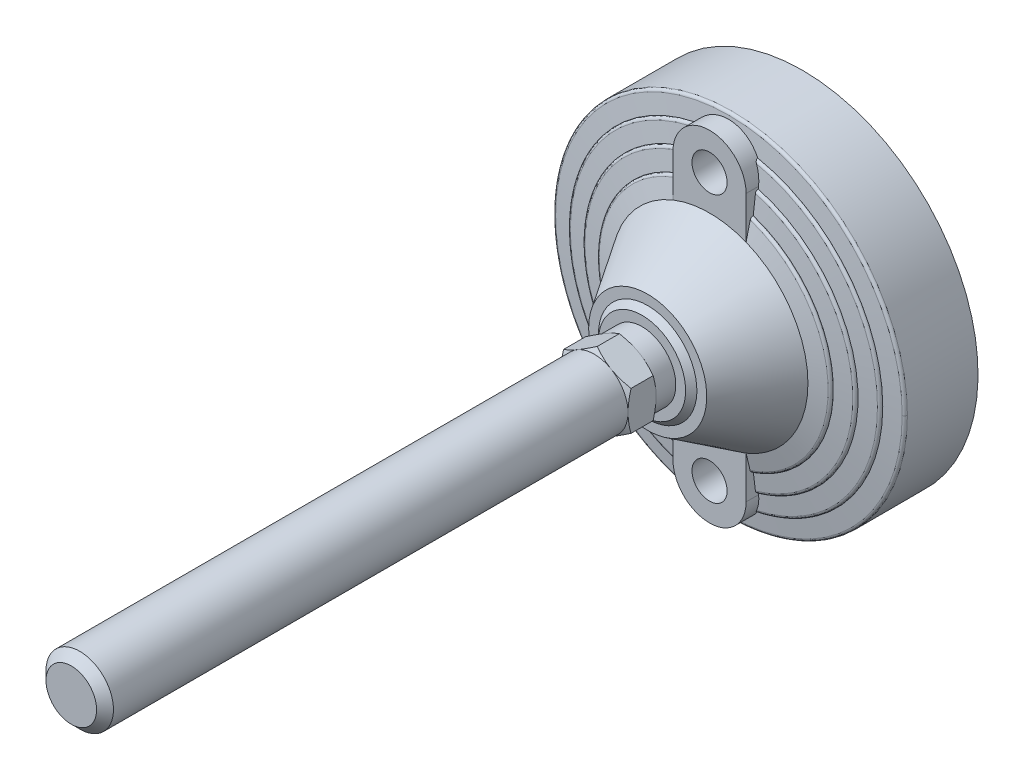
ISO-10303-21;
HEADER;
FILE_DESCRIPTION(('STEP AP214'),'2;1');
FILE_NAME('part.step','',(''),(''),'','','');
FILE_SCHEMA(('AUTOMOTIVE_DESIGN { 1 0 10303 214 1 1 1 1 }'));
ENDSEC;
DATA;
#1=APPLICATION_CONTEXT('core data for automotive mechanical design processes');
#2=APPLICATION_PROTOCOL_DEFINITION('international standard','automotive_design',2000,#1);
#3=PRODUCT_CONTEXT('',#1,'mechanical');
#4=PRODUCT('Part','Part','',(#3));
#5=PRODUCT_RELATED_PRODUCT_CATEGORY('part','',(#4));
#6=PRODUCT_DEFINITION_FORMATION('','',#4);
#7=PRODUCT_DEFINITION_CONTEXT('part definition',#1,'design');
#8=PRODUCT_DEFINITION('design','',#6,#7);
#9=PRODUCT_DEFINITION_SHAPE('','',#8);
#10=(LENGTH_UNIT() NAMED_UNIT(*) SI_UNIT(.MILLI.,.METRE.));
#11=(NAMED_UNIT(*) PLANE_ANGLE_UNIT() SI_UNIT($,.RADIAN.));
#12=(NAMED_UNIT(*) SI_UNIT($,.STERADIAN.) SOLID_ANGLE_UNIT());
#13=UNCERTAINTY_MEASURE_WITH_UNIT(LENGTH_MEASURE(1.E-05),#10,'distance_accuracy_value','');
#14=(GEOMETRIC_REPRESENTATION_CONTEXT(3) GLOBAL_UNCERTAINTY_ASSIGNED_CONTEXT((#13)) GLOBAL_UNIT_ASSIGNED_CONTEXT((#10,
#11,#12)) REPRESENTATION_CONTEXT('',''));
#15=CARTESIAN_POINT('',(0.,0.,0.));
#16=DIRECTION('',(0.,0.,1.));
#17=DIRECTION('',(1.,0.,0.));
#18=AXIS2_PLACEMENT_3D('',#15,#16,#17);
#19=CARTESIAN_POINT('',(0.,0.,64.));
#20=DIRECTION('',(0.,0.,-1.));
#21=DIRECTION('',(-1.,-5.24911956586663E-10,0.));
#22=AXIS2_PLACEMENT_3D('',#19,#20,#21);
#23=CYLINDRICAL_SURFACE('',#22,12.);
#24=CARTESIAN_POINT('',(0.,0.,57.));
#25=DIRECTION('',(0.,0.,-1.));
#26=DIRECTION('',(-1.,-5.24911956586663E-10,0.));
#27=AXIS2_PLACEMENT_3D('',#24,#25,#26);
#28=CIRCLE('',#27,12.);
#29=CARTESIAN_POINT('',(-12.,-6.29894347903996E-09,57.));
#30=VERTEX_POINT('',#29);
#31=EDGE_CURVE('E969',#30,#30,#28,.F.);
#32=ORIENTED_EDGE('',*,*,#31,.T.);
#33=EDGE_LOOP('',(#32));
#34=FACE_BOUND('',#33,.T.);
#35=CARTESIAN_POINT('',(0.,0.,64.));
#36=DIRECTION('',(0.,0.,-1.));
#37=DIRECTION('',(-1.,-5.24911956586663E-10,0.));
#38=AXIS2_PLACEMENT_3D('',#35,#36,#37);
#39=CIRCLE('',#38,12.);
#40=CARTESIAN_POINT('',(-12.,-6.05323624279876E-09,64.));
#41=VERTEX_POINT('',#40);
#42=CARTESIAN_POINT('',(-6.00000000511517,10.39230484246,64.));
#43=VERTEX_POINT('',#42);
#44=EDGE_CURVE('E1037',#41,#43,#39,.T.);
#45=ORIENTED_EDGE('',*,*,#44,.T.);
#46=CARTESIAN_POINT('',(0.,0.,64.));
#47=DIRECTION('',(0.,0.,-1.));
#48=DIRECTION('',(-1.,-5.24911956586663E-10,0.));
#49=AXIS2_PLACEMENT_3D('',#46,#47,#48);
#50=CIRCLE('',#49,12.);
#51=CARTESIAN_POINT('',(5.9999999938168,10.3923048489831,64.));
#52=VERTEX_POINT('',#51);
#53=EDGE_CURVE('E291',#43,#52,#50,.T.);
#54=ORIENTED_EDGE('',*,*,#53,.T.);
#55=CARTESIAN_POINT('',(0.,0.,64.));
#56=DIRECTION('',(0.,0.,-1.));
#57=DIRECTION('',(-1.,-5.24911956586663E-10,0.));
#58=AXIS2_PLACEMENT_3D('',#55,#56,#57);
#59=CIRCLE('',#58,12.);
#60=CARTESIAN_POINT('',(12.,6.29894347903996E-09,64.));
#61=VERTEX_POINT('',#60);
#62=EDGE_CURVE('E267',#52,#61,#59,.T.);
#63=ORIENTED_EDGE('',*,*,#62,.T.);
#64=CARTESIAN_POINT('',(0.,0.,64.));
#65=DIRECTION('',(0.,0.,-1.));
#66=DIRECTION('',(-1.,-5.24911956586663E-10,0.));
#67=AXIS2_PLACEMENT_3D('',#64,#65,#66);
#68=CIRCLE('',#67,12.);
#69=CARTESIAN_POINT('',(6.00000000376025,-10.3923048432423,64.));
#70=VERTEX_POINT('',#69);
#71=EDGE_CURVE('E280',#61,#70,#68,.T.);
#72=ORIENTED_EDGE('',*,*,#71,.T.);
#73=CARTESIAN_POINT('',(0.,0.,64.));
#74=DIRECTION('',(0.,0.,-1.));
#75=DIRECTION('',(-1.,-5.24911956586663E-10,0.));
#76=AXIS2_PLACEMENT_3D('',#73,#74,#75);
#77=CIRCLE('',#76,12.);
#78=CARTESIAN_POINT('',(-5.99999999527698,-10.3923048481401,64.));
#79=VERTEX_POINT('',#78);
#80=EDGE_CURVE('E287',#70,#79,#77,.T.);
#81=ORIENTED_EDGE('',*,*,#80,.T.);
#82=CARTESIAN_POINT('',(0.,0.,64.));
#83=DIRECTION('',(0.,0.,-1.));
#84=DIRECTION('',(-1.,-5.24911956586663E-10,0.));
#85=AXIS2_PLACEMENT_3D('',#82,#83,#84);
#86=CIRCLE('',#85,12.);
#87=EDGE_CURVE('E292',#79,#41,#86,.T.);
#88=ORIENTED_EDGE('',*,*,#87,.T.);
#89=EDGE_LOOP('',(#45,#54,#63,#72,#81,#88));
#90=FACE_BOUND('',#89,.T.);
#91=ADVANCED_FACE('F14',(#34,#90),#23,.T.);
#92=CARTESIAN_POINT('',(15.6860000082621,-15.7399750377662,57.));
#93=DIRECTION('',(0.,0.,-1.));
#94=DIRECTION('',(-1.,-5.24911956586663E-10,0.));
#95=AXIS2_PLACEMENT_3D('',#92,#93,#94);
#96=PLANE('',#95);
#97=ORIENTED_EDGE('',*,*,#31,.F.);
#98=EDGE_LOOP('',(#97));
#99=FACE_BOUND('',#98,.T.);
#100=CARTESIAN_POINT('',(0.,0.,57.));
#101=DIRECTION('',(0.,0.,-1.));
#102=DIRECTION('',(-5.24911956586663E-10,1.,0.));
#103=AXIS2_PLACEMENT_3D('',#100,#101,#102);
#104=CIRCLE('',#103,15.5);
#105=CARTESIAN_POINT('',(-8.13613532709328E-09,15.5,57.));
#106=VERTEX_POINT('',#105);
#107=EDGE_CURVE('E964',#106,#106,#104,.T.);
#108=ORIENTED_EDGE('',*,*,#107,.F.);
#109=EDGE_LOOP('',(#108));
#110=FACE_BOUND('',#109,.T.);
#111=ADVANCED_FACE('F933',(#99,#110),#96,.F.);
#112=CARTESIAN_POINT('',(-6.32500002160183,41.1532358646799,10.));
#113=DIRECTION('',(0.,0.,1.));
#114=DIRECTION('',(1.,5.24911956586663E-10,0.));
#115=AXIS2_PLACEMENT_3D('',#112,#113,#114);
#116=PLANE('',#115);
#117=CARTESIAN_POINT('',(-2.49333179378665E-08,47.5,10.));
#118=DIRECTION('',(0.,0.,1.));
#119=DIRECTION('',(5.24911956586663E-10,-1.,0.));
#120=AXIS2_PLACEMENT_3D('',#117,#118,#119);
#121=CIRCLE('',#120,6.25);
#122=CARTESIAN_POINT('',(-2.16526182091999E-08,41.25,10.));
#123=VERTEX_POINT('',#122);
#124=EDGE_CURVE('E961',#123,#123,#121,.T.);
#125=ORIENTED_EDGE('',*,*,#124,.T.);
#126=EDGE_LOOP('',(#125));
#127=FACE_BOUND('',#126,.T.);
#128=ADVANCED_FACE('F937',(#127),#116,.T.);
#129=CARTESIAN_POINT('',(0.,0.,57.));
#130=DIRECTION('',(0.,0.,-1.));
#131=DIRECTION('',(-5.24911956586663E-10,1.,0.));
#132=AXIS2_PLACEMENT_3D('',#129,#130,#131);
#133=CONICAL_SURFACE('',#132,15.5,0.785398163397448);
#134=CARTESIAN_POINT('',(0.,0.,55.));
#135=DIRECTION('',(0.,0.,-1.));
#136=DIRECTION('',(-5.24911956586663E-10,1.,0.));
#137=AXIS2_PLACEMENT_3D('',#134,#135,#136);
#138=CIRCLE('',#137,17.5);
#139=CARTESIAN_POINT('',(-9.1859592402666E-09,17.5,55.));
#140=VERTEX_POINT('',#139);
#141=EDGE_CURVE('E958',#140,#140,#138,.F.);
#142=ORIENTED_EDGE('',*,*,#141,.T.);
#143=EDGE_LOOP('',(#142));
#144=FACE_BOUND('',#143,.T.);
#145=ORIENTED_EDGE('',*,*,#107,.T.);
#146=EDGE_LOOP('',(#145));
#147=FACE_BOUND('',#146,.T.);
#148=ADVANCED_FACE('F941',(#144,#147),#133,.T.);
#149=CARTESIAN_POINT('',(-2.49333179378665E-08,47.5,10.));
#150=DIRECTION('',(0.,0.,1.));
#151=DIRECTION('',(5.24911956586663E-10,-1.,0.));
#152=AXIS2_PLACEMENT_3D('',#149,#150,#151);
#153=CYLINDRICAL_SURFACE('',#152,6.25);
#154=ORIENTED_EDGE('',*,*,#124,.F.);
#155=EDGE_LOOP('',(#154));
#156=FACE_BOUND('',#155,.T.);
#157=CARTESIAN_POINT('',(-2.49333179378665E-08,47.5,33.));
#158=DIRECTION('',(0.,0.,1.));
#159=DIRECTION('',(5.24911956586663E-10,-1.,0.));
#160=AXIS2_PLACEMENT_3D('',#157,#158,#159);
#161=CIRCLE('',#160,6.25);
#162=CARTESIAN_POINT('',(-2.16526182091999E-08,41.25,33.));
#163=VERTEX_POINT('',#162);
#164=EDGE_CURVE('E587',#163,#163,#161,.T.);
#165=ORIENTED_EDGE('',*,*,#164,.T.);
#166=EDGE_LOOP('',(#165));
#167=FACE_BOUND('',#166,.T.);
#168=ADVANCED_FACE('F946',(#156,#167),#153,.F.);
#169=CARTESIAN_POINT('',(-63.2499999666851,-63.4676413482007,0.));
#170=DIRECTION('',(0.,0.,1.));
#171=DIRECTION('',(1.,5.24911956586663E-10,0.));
#172=AXIS2_PLACEMENT_3D('',#169,#170,#171);
#173=PLANE('',#172);
#174=CARTESIAN_POINT('',(0.,0.,0.));
#175=DIRECTION('',(0.,0.,-1.));
#176=DIRECTION('',(-5.24911956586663E-10,1.,0.));
#177=AXIS2_PLACEMENT_3D('',#174,#175,#176);
#178=CIRCLE('',#177,62.5);
#179=CARTESIAN_POINT('',(-3.28069972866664E-08,62.5,0.));
#180=VERTEX_POINT('',#179);
#181=EDGE_CURVE('E583',#180,#180,#178,.F.);
#182=ORIENTED_EDGE('',*,*,#181,.F.);
#183=EDGE_LOOP('',(#182));
#184=FACE_BOUND('',#183,.T.);
#185=ADVANCED_FACE('F943',(#184),#173,.F.);
#186=CARTESIAN_POINT('',(21.2520000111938,-21.3251274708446,55.));
#187=DIRECTION('',(0.,0.,-1.));
#188=DIRECTION('',(-1.,-5.24911956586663E-10,0.));
#189=AXIS2_PLACEMENT_3D('',#186,#187,#188);
#190=PLANE('',#189);
#191=ORIENTED_EDGE('',*,*,#141,.F.);
#192=EDGE_LOOP('',(#191));
#193=FACE_BOUND('',#192,.T.);
#194=CARTESIAN_POINT('',(0.,0.,55.));
#195=DIRECTION('',(0.,0.,-1.));
#196=DIRECTION('',(-1.,-5.24911956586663E-10,0.));
#197=AXIS2_PLACEMENT_3D('',#194,#195,#196);
#198=CIRCLE('',#197,21.);
#199=CARTESIAN_POINT('',(-21.,-1.10231510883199E-08,55.));
#200=VERTEX_POINT('',#199);
#201=EDGE_CURVE('E681',#200,#200,#198,.T.);
#202=ORIENTED_EDGE('',*,*,#201,.F.);
#203=EDGE_LOOP('',(#202));
#204=FACE_BOUND('',#203,.T.);
#205=ADVANCED_FACE('F945',(#193,#204),#190,.F.);
#206=CARTESIAN_POINT('',(-6.32499997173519,-53.8467641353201,10.));
#207=DIRECTION('',(0.,0.,1.));
#208=DIRECTION('',(1.,5.24911956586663E-10,0.));
#209=AXIS2_PLACEMENT_3D('',#206,#207,#208);
#210=PLANE('',#209);
#211=CARTESIAN_POINT('',(2.49333179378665E-08,-47.5,10.));
#212=DIRECTION('',(0.,0.,1.));
#213=DIRECTION('',(5.24911956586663E-10,-1.,0.));
#214=AXIS2_PLACEMENT_3D('',#211,#212,#213);
#215=CIRCLE('',#214,6.25);
#216=CARTESIAN_POINT('',(2.82140176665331E-08,-53.75,10.));
#217=VERTEX_POINT('',#216);
#218=EDGE_CURVE('E676',#217,#217,#215,.T.);
#219=ORIENTED_EDGE('',*,*,#218,.T.);
#220=EDGE_LOOP('',(#219));
#221=FACE_BOUND('',#220,.T.);
#222=ADVANCED_FACE('F624',(#221),#210,.T.);
#223=CARTESIAN_POINT('',(-41.5,-2.17838461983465E-08,30.568111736));
#224=CARTESIAN_POINT('',(-41.5000000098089,18.6866616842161,30.568111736));
#225=CARTESIAN_POINT('',(-30.4931699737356,33.7876887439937,30.568111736));
#226=CARTESIAN_POINT('',(-12.7035357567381,39.5078495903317,30.568111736));
#227=CARTESIAN_POINT('',(-41.5,-2.17838461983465E-08,31.044046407));
#228=CARTESIAN_POINT('',(-41.5000000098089,18.6866616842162,31.044046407));
#229=CARTESIAN_POINT('',(-30.4931699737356,33.7876887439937,31.044046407));
#230=CARTESIAN_POINT('',(-12.7035357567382,39.5078495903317,31.044046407));
#231=CARTESIAN_POINT('',(-41.207906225,-2.16305226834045E-08,31.419805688));
#232=CARTESIAN_POINT('',(-41.2079062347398,18.5551374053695,31.419805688));
#233=CARTESIAN_POINT('',(-30.2785467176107,33.5498773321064,31.419805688));
#234=CARTESIAN_POINT('',(-12.6141231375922,39.2297773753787,31.419805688));
#235=CARTESIAN_POINT('',(-40.746679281,-2.1388419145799E-08,31.53720891));
#236=CARTESIAN_POINT('',(-40.7466792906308,18.3474556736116,31.53720891));
#237=CARTESIAN_POINT('',(-29.9396486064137,33.1743642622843,31.53720891));
#238=CARTESIAN_POINT('',(-12.4729372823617,38.7906909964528,31.53720891));
#239=(BOUNDED_SURFACE() B_SPLINE_SURFACE(3,3,((#223,#224,#225,#226),(#227,#228,#229,#230),(#231,
#232,#233,#234),(#235,#236,#237,#238)),.UNSPECIFIED.,.F.,.F.,
.F.) B_SPLINE_SURFACE_WITH_KNOTS((4,4),(4,4),(0.,1.),(0.,1.),
.UNSPECIFIED.) GEOMETRIC_REPRESENTATION_ITEM() RATIONAL_B_SPLINE_SURFACE(((1.,0.872078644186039,
0.872078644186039,1.),(0.859679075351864,0.749707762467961,0.749707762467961,0.859679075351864),
(0.859679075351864,0.749707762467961,0.749707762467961,0.859679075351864),(1.,0.872078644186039,
0.872078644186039,1.))) REPRESENTATION_ITEM('') SURFACE());
#240=CARTESIAN_POINT('',(-13.0000000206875,39.4112927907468,30.5681117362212));
#241=CARTESIAN_POINT('',(-13.0000000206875,39.4112933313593,30.5952104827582));
#242=CARTESIAN_POINT('',(-13.0000000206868,39.4101321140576,30.6222958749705));
#243=CARTESIAN_POINT('',(-13.0000000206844,39.4055044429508,30.6762650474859));
#244=CARTESIAN_POINT('',(-13.0000000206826,39.4020383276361,30.7031488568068));
#245=CARTESIAN_POINT('',(-13.0000000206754,39.3882336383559,30.7831079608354));
#246=CARTESIAN_POINT('',(-13.0000000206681,39.3744885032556,30.8356344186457));
#247=CARTESIAN_POINT('',(-13.0000000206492,39.3384083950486,30.9376087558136));
#248=CARTESIAN_POINT('',(-13.0000000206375,39.3160736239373,30.9870567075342));
#249=CARTESIAN_POINT('',(-13.0000000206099,39.2635909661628,31.0816017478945));
#250=CARTESIAN_POINT('',(-13.0000000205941,39.233444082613,31.1266993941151));
#251=CARTESIAN_POINT('',(-13.0000000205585,39.1656058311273,31.2123360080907));
#252=CARTESIAN_POINT('',(-13.0000000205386,39.1277713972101,31.2527614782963));
#253=CARTESIAN_POINT('',(-13.0000000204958,39.0461074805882,31.3270714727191));
#254=CARTESIAN_POINT('',(-13.0000000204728,39.0022718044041,31.3609491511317));
#255=CARTESIAN_POINT('',(-13.0000000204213,38.9043172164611,31.425052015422));
#256=CARTESIAN_POINT('',(-13.0000000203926,38.8495953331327,31.4543647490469));
#257=CARTESIAN_POINT('',(-13.0000000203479,38.7644641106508,31.4909906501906));
#258=CARTESIAN_POINT('',(-13.0000000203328,38.7355751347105,31.5019763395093));
#259=CARTESIAN_POINT('',(-13.000000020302,38.6769796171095,31.5214626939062));
#260=CARTESIAN_POINT('',(-13.0000000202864,38.6472733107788,31.5299640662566));
#261=CARTESIAN_POINT('',(-13.0000000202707,38.6172483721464,31.5372089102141));
#262=B_SPLINE_CURVE_WITH_KNOTS('',3,(#240,#241,#242,#243,#244,#245,#246,#247,#248,#249,#250,
#251,#252,#253,#254,#255,#256,#257,#258,#259,#260,#261),.UNSPECIFIED.,.F.,.F.,(4,2,2,2,2,2,2,2,
2,2,4),(0.,0.0812450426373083,0.162478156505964,0.324519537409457,0.486557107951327,
0.64857388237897,0.813939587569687,0.979477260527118,1.16468654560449,1.25731455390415,
1.34991616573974),.UNSPECIFIED.);
#263=CARTESIAN_POINT('',(-13.0000000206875,39.4112927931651,30.5681117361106));
#264=VERTEX_POINT('',#263);
#265=CARTESIAN_POINT('',(-13.0000000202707,38.6172483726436,31.5372089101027));
#266=VERTEX_POINT('',#265);
#267=EDGE_CURVE('E594',#264,#266,#262,.T.);
#268=CARTESIAN_POINT('',(0.,0.,30.568111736));
#269=DIRECTION('',(0.,0.,-1.));
#270=DIRECTION('',(-1.,-5.24911956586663E-10,0.));
#271=AXIS2_PLACEMENT_3D('',#268,#269,#270);
#272=CIRCLE('',#271,41.5);
#273=CARTESIAN_POINT('',(-41.5,-2.73734995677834E-08,30.568111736));
#274=VERTEX_POINT('',#273);
#275=EDGE_CURVE('E893',#274,#264,#272,.T.);
#276=CARTESIAN_POINT('',(-41.5,-2.17838461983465E-08,30.568111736));
#277=CARTESIAN_POINT('',(-41.5,-2.17838461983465E-08,31.044046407));
#278=CARTESIAN_POINT('',(-41.207906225,-2.16305226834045E-08,31.419805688));
#279=CARTESIAN_POINT('',(-40.746679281,-2.1388419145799E-08,31.53720891));
#280=(BOUNDED_CURVE() B_SPLINE_CURVE(3,(#276,#277,#278,#279),.UNSPECIFIED.,.F.,
.F.) B_SPLINE_CURVE_WITH_KNOTS((4,4),(0.,1.),
.UNSPECIFIED.) CURVE() GEOMETRIC_REPRESENTATION_ITEM() RATIONAL_B_SPLINE_CURVE((1.,
0.859679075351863,0.859679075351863,1.)) REPRESENTATION_ITEM(''));
#281=CARTESIAN_POINT('',(-40.7466792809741,-2.32178152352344E-08,31.5372089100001));
#282=VERTEX_POINT('',#281);
#283=EDGE_CURVE('E860',#282,#274,#280,.F.);
#284=CARTESIAN_POINT('',(3.56682565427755E-10,0.,31.53720891));
#285=DIRECTION('',(0.,0.,-1.));
#286=DIRECTION('',(-1.,-5.24911956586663E-10,0.));
#287=AXIS2_PLACEMENT_3D('',#284,#285,#286);
#288=CIRCLE('',#287,40.7466792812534);
#289=EDGE_CURVE('E896',#282,#266,#288,.T.);
#290=ORIENTED_EDGE('',*,*,#267,.F.);
#291=ORIENTED_EDGE('',*,*,#275,.F.);
#292=ORIENTED_EDGE('',*,*,#283,.F.);
#293=ORIENTED_EDGE('',*,*,#289,.T.);
#294=EDGE_LOOP('',(#290,#291,#292,#293));
#295=FACE_BOUND('',#294,.T.);
#296=ADVANCED_FACE('F611',(#295),#239,.T.);
#297=CARTESIAN_POINT('',(-48.5,-2.54582298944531E-08,28.6696231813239));
#298=CARTESIAN_POINT('',(-48.500000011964,22.7925095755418,28.669623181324));
#299=CARTESIAN_POINT('',(-34.6407469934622,40.8872491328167,28.669623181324));
#300=CARTESIAN_POINT('',(-12.6353093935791,46.8251957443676,28.6696231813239));
#301=CARTESIAN_POINT('',(-48.5,-2.54582298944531E-08,28.6740296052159));
#302=CARTESIAN_POINT('',(-48.500000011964,22.7925095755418,28.674029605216));
#303=CARTESIAN_POINT('',(-34.6407469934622,40.8872491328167,28.674029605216));
#304=CARTESIAN_POINT('',(-12.6353093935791,46.8251957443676,28.6740296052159));
#305=CARTESIAN_POINT('',(-48.5,-2.54582298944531E-08,28.678436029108));
#306=CARTESIAN_POINT('',(-48.500000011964,22.7925095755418,28.678436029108));
#307=CARTESIAN_POINT('',(-34.6407469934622,40.8872491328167,28.678436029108));
#308=CARTESIAN_POINT('',(-12.6353093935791,46.8251957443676,28.678436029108));
#309=CARTESIAN_POINT('',(-48.5,-2.54582298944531E-08,28.682842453));
#310=CARTESIAN_POINT('',(-48.500000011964,22.7925095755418,28.682842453));
#311=CARTESIAN_POINT('',(-34.6407469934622,40.8872491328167,28.682842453));
#312=CARTESIAN_POINT('',(-12.6353093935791,46.8251957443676,28.682842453));
#313=CARTESIAN_POINT('',(-48.5,-2.54582298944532E-08,29.211436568));
#314=CARTESIAN_POINT('',(-48.5000000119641,22.7925095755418,29.211436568));
#315=CARTESIAN_POINT('',(-34.6407469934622,40.8872491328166,29.211436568));
#316=CARTESIAN_POINT('',(-12.6353093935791,46.8251957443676,29.211436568));
#317=CARTESIAN_POINT('',(-48.150618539,-2.52748353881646E-08,29.608103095));
#318=CARTESIAN_POINT('',(-48.1506185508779,22.6283182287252,29.608103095));
#319=CARTESIAN_POINT('',(-34.3912040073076,40.5927079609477,29.608103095));
#320=CARTESIAN_POINT('',(-12.544287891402,46.4878791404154,29.608103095));
#321=CARTESIAN_POINT('',(-47.62625428,-2.49995903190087E-08,29.674840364));
#322=CARTESIAN_POINT('',(-47.6262542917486,22.3818939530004,29.674840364));
#323=CARTESIAN_POINT('',(-34.0166809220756,40.1506499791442,29.674840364));
#324=CARTESIAN_POINT('',(-12.4076795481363,45.9816222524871,29.674840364));
#325=(BOUNDED_SURFACE() B_SPLINE_SURFACE(3,3,((#297,#298,#299,#300),(#301,#302,#303,#304),(#305,
#306,#307,#308),(#309,#310,#311,#312),(#313,#314,#315,#316),(#317,#318,#319,#320),(#321,#322,
#323,#324)),.UNSPECIFIED.,.F.,.F.,.F.) B_SPLINE_SURFACE_WITH_KNOTS((4,3,4),(4,4),(-0.01,0.,1.),
(0.,1.),.UNSPECIFIED.) GEOMETRIC_REPRESENTATION_ITEM() RATIONAL_B_SPLINE_SURFACE(((1.,
0.862593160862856,0.862593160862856,1.),(1.,0.862593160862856,0.862593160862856,1.),(1.,
0.862593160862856,0.862593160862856,1.),(1.,0.862593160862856,0.862593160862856,1.),
(0.833611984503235,0.719067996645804,0.719067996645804,0.833611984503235),(0.833611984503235,
0.719067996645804,0.719067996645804,0.833611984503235),(1.,0.862593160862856,0.862593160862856,1.))) REPRESENTATION_ITEM('') SURFACE());
#326=CARTESIAN_POINT('',(-13.0000000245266,46.7252608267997,28.6777848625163));
#327=CARTESIAN_POINT('',(-13.0000000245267,46.7253979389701,28.7054287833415));
#328=CARTESIAN_POINT('',(-13.0000000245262,46.7243484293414,28.7330653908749));
#329=CARTESIAN_POINT('',(-13.0000000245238,46.719887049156,28.7881439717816));
#330=CARTESIAN_POINT('',(-13.000000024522,46.7164754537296,28.8155859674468));
#331=CARTESIAN_POINT('',(-13.0000000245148,46.7027375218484,28.8972169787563));
#332=CARTESIAN_POINT('',(-13.0000000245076,46.6889086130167,28.9508576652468));
#333=CARTESIAN_POINT('',(-13.0000000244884,46.6523707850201,29.0550506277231));
#334=CARTESIAN_POINT('',(-13.0000000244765,46.629652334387,29.1055995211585));
#335=CARTESIAN_POINT('',(-13.0000000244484,46.5760978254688,29.2021956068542));
#336=CARTESIAN_POINT('',(-13.0000000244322,46.545261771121,29.2482428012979));
#337=CARTESIAN_POINT('',(-13.000000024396,46.4762858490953,29.3348542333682));
#338=CARTESIAN_POINT('',(-13.0000000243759,46.4381108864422,29.3753904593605));
#339=CARTESIAN_POINT('',(-13.0000000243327,46.3556866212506,29.4497572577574));
#340=CARTESIAN_POINT('',(-13.0000000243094,46.3114343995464,29.483584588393));
#341=CARTESIAN_POINT('',(-13.0000000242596,46.2164675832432,29.5448274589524));
#342=CARTESIAN_POINT('',(-13.0000000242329,46.1655796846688,29.5719736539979));
#343=CARTESIAN_POINT('',(-13.0000000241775,46.0601083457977,29.6176355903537));
#344=CARTESIAN_POINT('',(-13.0000000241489,46.0055288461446,29.6361603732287));
#345=CARTESIAN_POINT('',(-13.0000000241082,45.9281089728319,29.6556819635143));
#346=CARTESIAN_POINT('',(-13.0000000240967,45.9061721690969,29.6604842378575));
#347=CARTESIAN_POINT('',(-13.0000000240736,45.8620822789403,29.6686997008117));
#348=CARTESIAN_POINT('',(-13.000000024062,45.8399296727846,29.6721154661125));
#349=CARTESIAN_POINT('',(-13.0000000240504,45.8176832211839,29.6748403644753));
#350=B_SPLINE_CURVE_WITH_KNOTS('',3,(#326,#327,#328,#329,#330,#331,#332,#333,#334,#335,#336,
#337,#338,#339,#340,#341,#342,#343,#344,#345,#346,#347,#348,#349),.UNSPECIFIED.,.F.,.F.,(4,2,2,
2,2,2,2,2,2,2,2,4),(0.,0.0828810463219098,0.165752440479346,0.331061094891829,0.496547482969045,
0.66203379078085,0.828332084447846,0.994710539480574,1.16697834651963,1.33906508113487,
1.40639957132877,1.47360834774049),.UNSPECIFIED.);
#351=CARTESIAN_POINT('',(-13.0000000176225,46.7252608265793,28.6777848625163));
#352=VERTEX_POINT('',#351);
#353=CARTESIAN_POINT('',(-13.0000000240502,45.8176832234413,29.6748403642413));
#354=VERTEX_POINT('',#353);
#355=EDGE_CURVE('E645',#352,#354,#350,.T.);
#356=CARTESIAN_POINT('',(-48.5,-2.98131620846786E-08,28.672727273));
#357=CARTESIAN_POINT('',(-48.4999999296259,0.333415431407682,28.672727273));
#358=CARTESIAN_POINT('',(-48.4965617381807,0.666820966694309,28.672727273));
#359=CARTESIAN_POINT('',(-48.4828103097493,1.33352830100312,28.6727272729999));
#360=CARTESIAN_POINT('',(-48.472496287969,1.66683008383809,28.6727272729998));
#361=CARTESIAN_POINT('',(-48.4311452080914,2.66872003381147,28.6727272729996));
#362=CARTESIAN_POINT('',(-48.3896989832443,3.33690872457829,28.6727272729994));
#363=CARTESIAN_POINT('',(-48.2791834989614,4.67103481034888,28.6727272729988));
#364=CARTESIAN_POINT('',(-48.2101117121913,5.33697199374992,28.6727272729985));
#365=CARTESIAN_POINT('',(-48.0443728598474,6.66611927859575,28.6727272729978));
#366=CARTESIAN_POINT('',(-47.947677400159,7.32932585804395,28.6727272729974));
#367=CARTESIAN_POINT('',(-47.7268875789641,8.65121281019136,28.6727272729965));
#368=CARTESIAN_POINT('',(-47.60278927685,9.3098925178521,28.672727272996));
#369=CARTESIAN_POINT('',(-47.1861236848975,11.2943151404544,28.6727272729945));
#370=CARTESIAN_POINT('',(-46.8512963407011,12.6114554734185,28.6727272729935));
#371=CARTESIAN_POINT('',(-46.0722287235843,15.213326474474,28.6727272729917));
#372=CARTESIAN_POINT('',(-45.627946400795,16.498044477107,28.6727272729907));
#373=CARTESIAN_POINT('',(-44.6325918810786,19.0270907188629,28.6727272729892));
#374=CARTESIAN_POINT('',(-44.0814040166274,20.2713734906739,28.6727272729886));
#375=CARTESIAN_POINT('',(-42.8765032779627,22.7091146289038,28.6727272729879));
#376=CARTESIAN_POINT('',(-42.2228003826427,23.9025779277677,28.6727272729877));
#377=CARTESIAN_POINT('',(-40.815487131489,26.2336646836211,28.6727272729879));
#378=CARTESIAN_POINT('',(-40.0615974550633,27.3711193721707,28.6727272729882));
#379=CARTESIAN_POINT('',(-38.4605248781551,29.5786506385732,28.6727272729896));
#380=CARTESIAN_POINT('',(-37.6133387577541,30.6487248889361,28.6727272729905));
#381=CARTESIAN_POINT('',(-36.2774121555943,32.1972795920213,28.6727272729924));
#382=CARTESIAN_POINT('',(-35.8211542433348,32.7041276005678,28.6727272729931));
#383=CARTESIAN_POINT('',(-34.8876792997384,33.6981378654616,28.6727272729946));
#384=CARTESIAN_POINT('',(-34.4104636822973,34.1853014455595,28.6727272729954));
#385=CARTESIAN_POINT('',(-33.4359820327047,35.139007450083,28.6727272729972));
#386=CARTESIAN_POINT('',(-32.9387187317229,35.605552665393,28.6727272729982));
#387=CARTESIAN_POINT('',(-31.9248695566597,36.5173626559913,28.6727272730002));
#388=CARTESIAN_POINT('',(-31.4082787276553,36.9626219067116,28.6727272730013));
#389=CARTESIAN_POINT('',(-29.8303181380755,38.2656936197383,28.6727272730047));
#390=CARTESIAN_POINT('',(-28.7412416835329,39.0903289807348,28.6727272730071));
#391=CARTESIAN_POINT('',(-26.49742298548,40.6447945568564,28.6727272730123));
#392=CARTESIAN_POINT('',(-25.3426812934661,41.3746255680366,28.672727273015));
#393=CARTESIAN_POINT('',(-23.5686095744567,42.3938136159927,28.6727272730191));
#394=CARTESIAN_POINT('',(-22.9706121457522,42.720784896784,28.6727272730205));
#395=CARTESIAN_POINT('',(-21.7614728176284,43.3491899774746,28.6727272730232));
#396=CARTESIAN_POINT('',(-21.1503339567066,43.6506296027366,28.6727272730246));
#397=CARTESIAN_POINT('',(-19.9161669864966,44.2273682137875,28.6727272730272));
#398=CARTESIAN_POINT('',(-19.2931439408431,44.5026780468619,28.6727272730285));
#399=CARTESIAN_POINT('',(-18.0360723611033,45.0268121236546,28.672727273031));
#400=CARTESIAN_POINT('',(-17.4020241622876,45.2756371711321,28.6727272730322));
#401=CARTESIAN_POINT('',(-16.1440011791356,45.7390025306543,28.6727272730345));
#402=CARTESIAN_POINT('',(-15.5203314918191,45.9543716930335,28.6727272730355));
#403=CARTESIAN_POINT('',(-14.2656346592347,46.3592038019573,28.6727272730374));
#404=CARTESIAN_POINT('',(-13.634619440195,46.5487037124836,28.6727272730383));
#405=CARTESIAN_POINT('',(-13.0000000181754,46.7252608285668,28.6727272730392));
#406=B_SPLINE_CURVE_WITH_KNOTS('',3,(#356,#357,#358,#359,#360,#361,#362,#363,#364,#365,#366,
#367,#368,#369,#370,#371,#372,#373,#374,#375,#376,#377,#378,#379,#380,#381,#382,#383,#384,#385,
#386,#387,#388,#389,#390,#391,#392,#393,#394,#395,#396,#397,#398,#399,#400,#401,#402,#403,#404,
#405),.UNSPECIFIED.,.F.,.F.,(4,2,2,2,2,2,2,2,2,2,2,2,2,2,2,2,2,2,2,2,2,2,2,2,4),(0.,
1.00020881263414,2.00053180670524,4.00832451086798,6.01630094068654,8.02634882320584,
10.0366859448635,14.108550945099,18.1819827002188,22.259846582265,26.3373137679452,
30.4263972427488,34.5156218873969,36.5609970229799,38.6062343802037,40.6511940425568,
42.6966816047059,46.7896708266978,50.8826256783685,52.9267726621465,54.9704519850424,
57.0132791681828,59.0560443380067,61.0349244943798,63.0109467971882),.UNSPECIFIED.);
#407=CARTESIAN_POINT('',(-48.5,-2.98132198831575E-08,28.677784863));
#408=VERTEX_POINT('',#407);
#409=EDGE_CURVE('E675',#408,#352,#406,.T.);
#410=CARTESIAN_POINT('',(-48.5,-2.54582298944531E-08,28.682842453));
#411=CARTESIAN_POINT('',(-48.5,-2.54582298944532E-08,29.211436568));
#412=CARTESIAN_POINT('',(-48.150618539,-2.52748353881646E-08,29.608103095));
#413=CARTESIAN_POINT('',(-47.62625428,-2.49995903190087E-08,29.674840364));
#414=(BOUNDED_CURVE() B_SPLINE_CURVE(3,(#410,#411,#412,#413),.UNSPECIFIED.,.F.,
.F.) B_SPLINE_CURVE_WITH_KNOTS((4,4),(0.,1.),
.UNSPECIFIED.) CURVE() GEOMETRIC_REPRESENTATION_ITEM() RATIONAL_B_SPLINE_CURVE((1.,
0.833611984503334,0.833611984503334,1.)) REPRESENTATION_ITEM(''));
#415=CARTESIAN_POINT('',(-47.6262542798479,-2.7137857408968E-08,29.674840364));
#416=VERTEX_POINT('',#415);
#417=EDGE_CURVE('E839',#416,#408,#414,.F.);
#418=CARTESIAN_POINT('',(1.59656315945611E-09,0.,29.674840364));
#419=DIRECTION('',(0.,0.,-1.));
#420=DIRECTION('',(-1.,-5.24911956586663E-10,0.));
#421=AXIS2_PLACEMENT_3D('',#418,#419,#420);
#422=CIRCLE('',#421,47.6262542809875);
#423=EDGE_CURVE('E895',#416,#354,#422,.T.);
#424=ORIENTED_EDGE('',*,*,#355,.F.);
#425=ORIENTED_EDGE('',*,*,#409,.F.);
#426=ORIENTED_EDGE('',*,*,#417,.F.);
#427=ORIENTED_EDGE('',*,*,#423,.T.);
#428=EDGE_LOOP('',(#424,#425,#426,#427));
#429=FACE_BOUND('',#428,.T.);
#430=ADVANCED_FACE('F622',(#429),#325,.T.);
#431=CARTESIAN_POINT('',(-13.0000000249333,47.4999999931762,28.551142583));
#432=DIRECTION('',(-1.,-5.24911956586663E-10,0.));
#433=DIRECTION('',(5.24911956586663E-10,-1.,0.));
#434=AXIS2_PLACEMENT_3D('',#431,#432,#433);
#435=PLANE('',#434);
#436=DIRECTION('',(0.,0.,1.));
#437=VECTOR('',#436,1.);
#438=CARTESIAN_POINT('',(-13.0000000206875,39.4112927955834,30.7755712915));
#439=LINE('',#438,#437);
#440=CARTESIAN_POINT('',(-13.0000000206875,39.4112927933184,30.4545454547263));
#441=VERTEX_POINT('',#440);
#442=EDGE_CURVE('E603',#441,#264,#439,.T.);
#443=ORIENTED_EDGE('',*,*,#442,.T.);
#444=ORIENTED_EDGE('',*,*,#267,.T.);
#445=CARTESIAN_POINT('',(-13.0000000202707,38.6172483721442,31.5372089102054));
#446=CARTESIAN_POINT('',(-13.000000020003,38.1074186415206,31.6602002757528));
#447=CARTESIAN_POINT('',(-13.0000000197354,37.5975329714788,31.7829600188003));
#448=CARTESIAN_POINT('',(-13.0000000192,36.5776365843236,32.0279559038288));
#449=CARTESIAN_POINT('',(-13.0000000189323,36.067625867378,32.1501920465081));
#450=CARTESIAN_POINT('',(-13.0000000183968,35.0474647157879,32.3940807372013));
#451=CARTESIAN_POINT('',(-13.0000000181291,34.5373142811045,32.5157332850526));
#452=CARTESIAN_POINT('',(-13.0000000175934,33.5168560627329,32.7583795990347));
#453=CARTESIAN_POINT('',(-13.0000000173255,33.0065482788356,32.8793733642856));
#454=CARTESIAN_POINT('',(-13.0000000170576,32.4961536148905,32.9999999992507));
#455=B_SPLINE_CURVE_WITH_KNOTS('',3,(#445,#446,#447,#448,#449,#450,#451,#452,#453,#454),
.UNSPECIFIED.,.F.,.F.,(4,2,2,2,4),(0.,1.57336555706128,3.14672901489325,4.72009291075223,
6.29345890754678),.UNSPECIFIED.);
#456=CARTESIAN_POINT('',(-13.0000000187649,32.4961536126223,32.9999999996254));
#457=VERTEX_POINT('',#456);
#458=EDGE_CURVE('E646',#266,#457,#455,.T.);
#459=ORIENTED_EDGE('',*,*,#458,.T.);
#460=DIRECTION('',(-5.24911956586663E-10,1.,0.));
#461=VECTOR('',#460,1.);
#462=CARTESIAN_POINT('',(-13.0000000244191,46.5204431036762,33.));
#463=LINE('',#462,#461);
#464=CARTESIAN_POINT('',(-13.0000000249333,47.4999999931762,33.));
#465=VERTEX_POINT('',#464);
#466=EDGE_CURVE('E590',#457,#465,#463,.T.);
#467=ORIENTED_EDGE('',*,*,#466,.T.);
#468=DIRECTION('',(0.,0.,1.));
#469=VECTOR('',#468,1.);
#470=CARTESIAN_POINT('',(-13.0000000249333,47.4999999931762,29.6069796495));
#471=LINE('',#470,#469);
#472=CARTESIAN_POINT('',(-13.0000000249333,47.4999998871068,28.5776765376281));
#473=VERTEX_POINT('',#472);
#474=EDGE_CURVE('E889',#473,#465,#471,.T.);
#475=ORIENTED_EDGE('',*,*,#474,.F.);
#476=CARTESIAN_POINT('',(-13.0000000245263,46.7246498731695,28.6728021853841));
#477=CARTESIAN_POINT('',(-13.0000000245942,46.8538759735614,28.6569570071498));
#478=CARTESIAN_POINT('',(-13.000000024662,46.9831015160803,28.6411072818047));
#479=CARTESIAN_POINT('',(-13.0000000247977,47.2415514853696,28.609398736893));
#480=CARTESIAN_POINT('',(-13.0000000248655,47.37077591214,28.5935399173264));
#481=CARTESIAN_POINT('',(-13.0000000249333,47.4999997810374,28.5776765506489));
#482=B_SPLINE_CURVE_WITH_KNOTS('',3,(#476,#477,#478,#479,#480,#481),.UNSPECIFIED.,.F.,.F.,(4,2,
4),(0.,0.390581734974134,0.781163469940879),.UNSPECIFIED.);
#483=EDGE_CURVE('E1305',#352,#473,#482,.T.);
#484=ORIENTED_EDGE('',*,*,#483,.F.);
#485=ORIENTED_EDGE('',*,*,#355,.T.);
#486=CARTESIAN_POINT('',(-13.0000000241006,45.8176832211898,29.6748403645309));
#487=CARTESIAN_POINT('',(-13.0000000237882,45.2838642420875,29.7402005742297));
#488=CARTESIAN_POINT('',(-13.0000000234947,44.7500350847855,29.8054777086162));
#489=CARTESIAN_POINT('',(-13.0000000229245,43.6823542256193,29.9358466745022));
#490=CARTESIAN_POINT('',(-13.0000000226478,43.1485025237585,30.0009385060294));
#491=CARTESIAN_POINT('',(-13.0000000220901,42.0807742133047,30.1309177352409));
#492=CARTESIAN_POINT('',(-13.0000000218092,41.5468976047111,30.1958051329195));
#493=CARTESIAN_POINT('',(-13.0000000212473,40.4791166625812,30.3253520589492));
#494=CARTESIAN_POINT('',(-13.0000000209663,39.9452123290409,30.3900115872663));
#495=CARTESIAN_POINT('',(-13.0000000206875,39.4112927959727,30.4545454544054));
#496=B_SPLINE_CURVE_WITH_KNOTS('',3,(#486,#487,#488,#489,#490,#491,#492,#493,#494,#495),
.UNSPECIFIED.,.F.,.F.,(4,2,2,2,4),(0.,1.61341623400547,3.22683222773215,4.84024826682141,
6.45366454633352),.UNSPECIFIED.);
#497=EDGE_CURVE('E604',#354,#441,#496,.T.);
#498=ORIENTED_EDGE('',*,*,#497,.T.);
#499=EDGE_LOOP('',(#443,#444,#459,#467,#475,#484,#485,#498));
#500=FACE_BOUND('',#499,.T.);
#501=ADVANCED_FACE('F617',(#500),#435,.T.);
#502=CARTESIAN_POINT('',(12.9999999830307,32.3278621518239,33.));
#503=DIRECTION('',(0.,0.,-1.));
#504=DIRECTION('',(-1.,-5.24911956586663E-10,0.));
#505=AXIS2_PLACEMENT_3D('',#502,#503,#504);
#506=PLANE('',#505);
#507=ORIENTED_EDGE('',*,*,#164,.F.);
#508=EDGE_LOOP('',(#507));
#509=FACE_BOUND('',#508,.T.);
#510=CARTESIAN_POINT('',(0.,0.,33.));
#511=DIRECTION('',(0.,0.,-1.));
#512=DIRECTION('',(-1.,-5.24911956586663E-10,0.));
#513=AXIS2_PLACEMENT_3D('',#510,#511,#512);
#514=CIRCLE('',#513,35.);
#515=CARTESIAN_POINT('',(12.9999999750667,32.4961536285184,33.));
#516=VERTEX_POINT('',#515);
#517=EDGE_CURVE('E591',#516,#457,#514,.F.);
#518=ORIENTED_EDGE('',*,*,#517,.F.);
#519=DIRECTION('',(5.24911956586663E-10,-1.,0.));
#520=VECTOR('',#519,1.);
#521=CARTESIAN_POINT('',(12.9999999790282,39.9530652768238,33.));
#522=LINE('',#521,#520);
#523=CARTESIAN_POINT('',(12.9999999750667,47.5000000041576,33.));
#524=VERTEX_POINT('',#523);
#525=EDGE_CURVE('E582',#524,#516,#522,.T.);
#526=ORIENTED_EDGE('',*,*,#525,.F.);
#527=CARTESIAN_POINT('',(-2.49333179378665E-08,47.5,33.));
#528=DIRECTION('',(0.,0.,-1.));
#529=DIRECTION('',(-1.,-5.24911956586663E-10,0.));
#530=AXIS2_PLACEMENT_3D('',#527,#528,#529);
#531=CIRCLE('',#530,13.);
#532=EDGE_CURVE('E879',#465,#524,#531,.T.);
#533=ORIENTED_EDGE('',*,*,#532,.F.);
#534=ORIENTED_EDGE('',*,*,#466,.F.);
#535=EDGE_LOOP('',(#518,#526,#533,#534));
#536=FACE_BOUND('',#535,.T.);
#537=ADVANCED_FACE('F621',(#509,#536),#506,.F.);
#538=CARTESIAN_POINT('',(-62.5,-3.28069972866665E-08,25.119206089));
#539=CARTESIAN_POINT('',(-62.500000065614,124.999999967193,25.119206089));
#540=CARTESIAN_POINT('',(62.4999999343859,125.000000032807,25.119206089));
#541=CARTESIAN_POINT('',(62.5,3.28069972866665E-08,25.119206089));
#542=CARTESIAN_POINT('',(-62.5,-3.28069972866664E-08,25.647800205));
#543=CARTESIAN_POINT('',(-62.500000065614,124.999999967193,25.647800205));
#544=CARTESIAN_POINT('',(62.499999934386,125.000000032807,25.647800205));
#545=CARTESIAN_POINT('',(62.5,3.28069972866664E-08,25.647800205));
#546=CARTESIAN_POINT('',(-62.150618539,-3.26236027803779E-08,26.044466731));
#547=CARTESIAN_POINT('',(-62.1506186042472,124.301237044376,26.044466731));
#548=CARTESIAN_POINT('',(62.1506184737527,124.301237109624,26.044466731));
#549=CARTESIAN_POINT('',(62.150618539,3.26236027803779E-08,26.044466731));
#550=CARTESIAN_POINT('',(-61.62625428,-3.23483577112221E-08,26.111204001));
#551=CARTESIAN_POINT('',(-61.6262543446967,123.252508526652,26.111204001));
#552=CARTESIAN_POINT('',(61.6262542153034,123.252508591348,26.111204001));
#553=CARTESIAN_POINT('',(61.62625428,3.23483577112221E-08,26.111204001));
#554=(BOUNDED_SURFACE() B_SPLINE_SURFACE(3,3,((#538,#539,#540,#541),(#542,#543,#544,#545),(#546,
#547,#548,#549),(#550,#551,#552,#553)),.UNSPECIFIED.,.F.,.F.,
.F.) B_SPLINE_SURFACE_WITH_KNOTS((4,4),(4,4),(0.,1.),(0.,1.),
.UNSPECIFIED.) GEOMETRIC_REPRESENTATION_ITEM() RATIONAL_B_SPLINE_SURFACE(((1.,0.333333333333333,
0.333333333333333,1.),(0.833611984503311,0.277870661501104,0.277870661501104,0.833611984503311),
(0.833611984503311,0.277870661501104,0.277870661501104,0.833611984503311),(1.,0.333333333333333,
0.333333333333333,1.))) REPRESENTATION_ITEM('') SURFACE());
#555=CARTESIAN_POINT('',(0.,0.,25.119206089));
#556=DIRECTION('',(0.,0.,1.));
#557=DIRECTION('',(1.,5.24911956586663E-10,0.));
#558=AXIS2_PLACEMENT_3D('',#555,#556,#557);
#559=CIRCLE('',#558,62.5);
#560=CARTESIAN_POINT('',(62.5,2.31927740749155E-08,25.119206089));
#561=VERTEX_POINT('',#560);
#562=CARTESIAN_POINT('',(-62.5,-3.5613048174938E-08,25.119206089));
#563=VERTEX_POINT('',#562);
#564=EDGE_CURVE('E586',#561,#563,#559,.T.);
#565=CARTESIAN_POINT('',(-62.5,-3.28069972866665E-08,25.119206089));
#566=CARTESIAN_POINT('',(-62.5,-3.28069972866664E-08,25.647800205));
#567=CARTESIAN_POINT('',(-62.150618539,-3.26236027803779E-08,26.044466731));
#568=CARTESIAN_POINT('',(-61.62625428,-3.23483577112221E-08,26.111204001));
#569=(BOUNDED_CURVE() B_SPLINE_CURVE(3,(#565,#566,#567,#568),.UNSPECIFIED.,.F.,
.F.) B_SPLINE_CURVE_WITH_KNOTS((4,4),(0.,1.),
.UNSPECIFIED.) CURVE() GEOMETRIC_REPRESENTATION_ITEM() RATIONAL_B_SPLINE_CURVE((1.,
0.833611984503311,0.833611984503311,1.)) REPRESENTATION_ITEM(''));
#570=CARTESIAN_POINT('',(-61.6262542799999,-4.06488251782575E-08,26.1112040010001));
#571=VERTEX_POINT('',#570);
#572=EDGE_CURVE('E818',#571,#563,#569,.F.);
#573=CARTESIAN_POINT('',(0.,0.,26.1112040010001));
#574=DIRECTION('',(0.,0.,-1.));
#575=DIRECTION('',(-1.,-5.24911956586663E-10,0.));
#576=AXIS2_PLACEMENT_3D('',#573,#574,#575);
#577=CIRCLE('',#576,61.62625428);
#578=CARTESIAN_POINT('',(61.6262542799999,1.65486626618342E-08,26.1112040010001));
#579=VERTEX_POINT('',#578);
#580=EDGE_CURVE('E806',#579,#571,#577,.F.);
#581=CARTESIAN_POINT('',(62.5,3.28069972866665E-08,25.119206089));
#582=CARTESIAN_POINT('',(62.5,3.28069972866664E-08,25.647800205));
#583=CARTESIAN_POINT('',(62.150618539,3.26236027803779E-08,26.044466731));
#584=CARTESIAN_POINT('',(61.62625428,3.23483577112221E-08,26.111204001));
#585=(BOUNDED_CURVE() B_SPLINE_CURVE(3,(#581,#582,#583,#584),.UNSPECIFIED.,.F.,
.F.) B_SPLINE_CURVE_WITH_KNOTS((4,4),(0.,1.),
.UNSPECIFIED.) CURVE() GEOMETRIC_REPRESENTATION_ITEM() RATIONAL_B_SPLINE_CURVE((1.,
0.833611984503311,0.833611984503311,1.)) REPRESENTATION_ITEM(''));
#586=EDGE_CURVE('E822',#561,#579,#585,.T.);
#587=ORIENTED_EDGE('',*,*,#564,.T.);
#588=ORIENTED_EDGE('',*,*,#572,.F.);
#589=ORIENTED_EDGE('',*,*,#580,.F.);
#590=ORIENTED_EDGE('',*,*,#586,.F.);
#591=EDGE_LOOP('',(#587,#588,#589,#590));
#592=FACE_BOUND('',#591,.T.);
#593=ADVANCED_FACE('F659',(#592),#554,.T.);
#594=CARTESIAN_POINT('',(0.,0.,25.119206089));
#595=DIRECTION('',(0.,0.,-1.));
#596=DIRECTION('',(-5.24911956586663E-10,1.,0.));
#597=AXIS2_PLACEMENT_3D('',#594,#595,#596);
#598=CYLINDRICAL_SURFACE('',#597,62.5);
#599=ORIENTED_EDGE('',*,*,#564,.F.);
#600=CARTESIAN_POINT('',(0.,0.,25.119206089));
#601=DIRECTION('',(0.,0.,1.));
#602=DIRECTION('',(1.,5.24911956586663E-10,0.));
#603=AXIS2_PLACEMENT_3D('',#600,#601,#602);
#604=CIRCLE('',#603,62.5);
#605=EDGE_CURVE('E821',#563,#561,#604,.T.);
#606=ORIENTED_EDGE('',*,*,#605,.F.);
#607=EDGE_LOOP('',(#599,#606));
#608=FACE_BOUND('',#607,.T.);
#609=ORIENTED_EDGE('',*,*,#181,.T.);
#610=EDGE_LOOP('',(#609));
#611=FACE_BOUND('',#610,.T.);
#612=ADVANCED_FACE('F1560',(#608,#611),#598,.T.);
#613=CARTESIAN_POINT('',(12.9999999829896,32.4061305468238,28.551142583));
#614=DIRECTION('',(1.,5.24911956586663E-10,0.));
#615=DIRECTION('',(-5.24911956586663E-10,1.,0.));
#616=AXIS2_PLACEMENT_3D('',#613,#614,#615);
#617=PLANE('',#616);
#618=DIRECTION('',(0.,0.,-1.));
#619=VECTOR('',#618,1.);
#620=CARTESIAN_POINT('',(12.9999999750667,47.5000000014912,29.6069796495));
#621=LINE('',#620,#619);
#622=CARTESIAN_POINT('',(12.9999999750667,47.5000000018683,28.5776765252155));
#623=VERTEX_POINT('',#622);
#624=EDGE_CURVE('E832',#524,#623,#621,.T.);
#625=ORIENTED_EDGE('',*,*,#624,.F.);
#626=ORIENTED_EDGE('',*,*,#525,.T.);
#627=CARTESIAN_POINT('',(12.999999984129,38.6172483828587,31.5372089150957));
#628=CARTESIAN_POINT('',(12.9999999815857,38.1074186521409,31.6602002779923));
#629=CARTESIAN_POINT('',(12.9999999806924,37.5975329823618,31.7829600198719));
#630=CARTESIAN_POINT('',(12.9999999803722,36.5776365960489,32.0279559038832));
#631=CARTESIAN_POINT('',(12.9999999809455,36.0676258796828,32.1501920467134));
#632=CARTESIAN_POINT('',(12.9999999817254,35.0474647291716,32.3940807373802));
#633=CARTESIAN_POINT('',(12.9999999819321,34.5373142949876,32.5157332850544));
#634=CARTESIAN_POINT('',(12.9999999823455,33.516856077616,32.7583795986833));
#635=CARTESIAN_POINT('',(12.9999999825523,33.0065482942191,32.8793733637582));
#636=CARTESIAN_POINT('',(12.9999999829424,32.4961536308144,32.9999999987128));
#637=B_SPLINE_CURVE_WITH_KNOTS('',3,(#627,#628,#629,#630,#631,#632,#633,#634,#635,#636),
.UNSPECIFIED.,.F.,.F.,(4,2,2,2,4),(0.,1.57336555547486,3.14672901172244,4.72009290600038,
6.29345890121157),.UNSPECIFIED.);
#638=CARTESIAN_POINT('',(12.9999999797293,38.6172483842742,31.5372089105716));
#639=VERTEX_POINT('',#638);
#640=EDGE_CURVE('E575',#639,#516,#637,.T.);
#641=ORIENTED_EDGE('',*,*,#640,.F.);
#642=CARTESIAN_POINT('',(12.9999999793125,39.4112928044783,30.5681117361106));
#643=CARTESIAN_POINT('',(12.9999999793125,39.411293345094,30.5952104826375));
#644=CARTESIAN_POINT('',(12.9999999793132,39.4101321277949,30.6222958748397));
#645=CARTESIAN_POINT('',(12.9999999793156,39.4055044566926,30.6762650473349));
#646=CARTESIAN_POINT('',(12.9999999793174,39.4020383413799,30.7031488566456));
#647=CARTESIAN_POINT('',(12.9999999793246,39.3882336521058,30.7831079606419));
#648=CARTESIAN_POINT('',(12.9999999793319,39.3744885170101,30.83563441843));
#649=CARTESIAN_POINT('',(12.9999999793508,39.338408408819,30.9376087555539));
#650=CARTESIAN_POINT('',(12.9999999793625,39.3160736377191,30.9870567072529));
#651=CARTESIAN_POINT('',(12.9999999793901,39.2635909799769,31.0816017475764));
#652=CARTESIAN_POINT('',(12.9999999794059,39.2334440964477,31.1266993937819));
#653=CARTESIAN_POINT('',(12.9999999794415,39.1656058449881,31.2123360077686));
#654=CARTESIAN_POINT('',(12.9999999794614,39.1277714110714,31.2527614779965));
#655=CARTESIAN_POINT('',(12.9999999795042,39.04610749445,31.3270714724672));
#656=CARTESIAN_POINT('',(12.9999999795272,39.0022718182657,31.3609491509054));
#657=CARTESIAN_POINT('',(12.9999999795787,38.9043172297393,31.4250520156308));
#658=CARTESIAN_POINT('',(12.9999999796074,38.8495953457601,31.4543647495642));
#659=CARTESIAN_POINT('',(12.9999999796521,38.7644641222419,31.490990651));
#660=CARTESIAN_POINT('',(12.9999999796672,38.7355751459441,31.5019763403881));
#661=CARTESIAN_POINT('',(12.999999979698,38.6769796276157,31.5214626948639));
#662=CARTESIAN_POINT('',(12.9999999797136,38.6472733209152,31.5299640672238));
#663=CARTESIAN_POINT('',(12.9999999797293,38.6172483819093,31.5372089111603));
#664=B_SPLINE_CURVE_WITH_KNOTS('',3,(#642,#643,#644,#645,#646,#647,#648,#649,#650,#651,#652,
#653,#654,#655,#656,#657,#658,#659,#660,#661,#662,#663),.UNSPECIFIED.,.F.,.F.,(4,2,2,2,2,2,2,2,
2,2,4),(0.,0.0812450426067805,0.162478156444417,0.324519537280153,0.486557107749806,
0.648573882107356,0.813939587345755,0.979477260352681,1.16468654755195,1.25731455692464,
1.34991616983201),.UNSPECIFIED.);
#665=CARTESIAN_POINT('',(12.9999999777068,39.4112928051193,30.5681117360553));
#666=VERTEX_POINT('',#665);
#667=EDGE_CURVE('E684',#666,#639,#664,.T.);
#668=ORIENTED_EDGE('',*,*,#667,.F.);
#669=DIRECTION('',(0.,0.,1.));
#670=VECTOR('',#669,1.);
#671=CARTESIAN_POINT('',(12.9999999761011,39.4112928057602,30.5113285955));
#672=LINE('',#671,#670);
#673=CARTESIAN_POINT('',(12.9999999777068,39.411292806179,30.4545454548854));
#674=VERTEX_POINT('',#673);
#675=EDGE_CURVE('E873',#674,#666,#672,.T.);
#676=ORIENTED_EDGE('',*,*,#675,.F.);
#677=CARTESIAN_POINT('',(12.9999999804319,45.8176832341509,29.6748403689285));
#678=CARTESIAN_POINT('',(12.9999999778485,45.2838642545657,29.7402005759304));
#679=CARTESIAN_POINT('',(12.9999999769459,44.7500350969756,29.8054777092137));
#680=CARTESIAN_POINT('',(12.9999999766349,43.6823542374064,29.9358466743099));
#681=CARTESIAN_POINT('',(12.9999999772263,43.1485025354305,30.0009385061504));
#682=CARTESIAN_POINT('',(12.9999999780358,42.0807742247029,30.1309177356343));
#683=CARTESIAN_POINT('',(12.9999999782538,41.5468976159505,30.1958051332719));
#684=CARTESIAN_POINT('',(12.9999999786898,40.4791166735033,30.3253520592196));
#685=CARTESIAN_POINT('',(12.9999999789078,39.9452123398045,30.3900115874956));
#686=CARTESIAN_POINT('',(12.9999999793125,39.4112928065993,30.4545454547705));
#687=B_SPLINE_CURVE_WITH_KNOTS('',3,(#677,#678,#679,#680,#681,#682,#683,#684,#685,#686),
.UNSPECIFIED.,.F.,.F.,(4,2,2,2,4),(0.,1.61341623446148,3.22683222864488,4.84024826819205,
6.45366454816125),.UNSPECIFIED.);
#688=CARTESIAN_POINT('',(12.9999999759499,45.817683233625,29.674840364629));
#689=VERTEX_POINT('',#688);
#690=EDGE_CURVE('E874',#689,#674,#687,.T.);
#691=ORIENTED_EDGE('',*,*,#690,.F.);
#692=CARTESIAN_POINT('',(12.9999999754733,46.7252608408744,28.6777848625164));
#693=CARTESIAN_POINT('',(12.9999999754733,46.7253979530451,28.7054287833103));
#694=CARTESIAN_POINT('',(12.9999999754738,46.7243484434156,28.7330653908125));
#695=CARTESIAN_POINT('',(12.9999999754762,46.7198870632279,28.7881439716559));
#696=CARTESIAN_POINT('',(12.999999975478,46.7164754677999,28.8155859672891));
#697=CARTESIAN_POINT('',(12.9999999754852,46.7027375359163,28.8972169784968));
#698=CARTESIAN_POINT('',(12.9999999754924,46.6889086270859,28.9508576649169));
#699=CARTESIAN_POINT('',(12.9999999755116,46.65237079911,29.055050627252));
#700=CARTESIAN_POINT('',(12.9999999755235,46.6296523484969,29.1055995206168));
#701=CARTESIAN_POINT('',(12.9999999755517,46.5760978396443,29.2021956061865));
#702=CARTESIAN_POINT('',(12.9999999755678,46.5452617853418,29.2482428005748));
#703=CARTESIAN_POINT('',(12.999999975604,46.4762858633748,29.3348542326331));
#704=CARTESIAN_POINT('',(12.9999999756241,46.4381109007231,29.3753904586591));
#705=CARTESIAN_POINT('',(12.9999999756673,46.355686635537,29.4497572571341));
#706=CARTESIAN_POINT('',(12.9999999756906,46.311434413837,29.4835845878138));
#707=CARTESIAN_POINT('',(12.9999999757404,46.2164675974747,29.5448274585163));
#708=CARTESIAN_POINT('',(12.9999999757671,46.1655796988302,29.5719736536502));
#709=CARTESIAN_POINT('',(12.9999999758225,46.0601083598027,29.6176355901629));
#710=CARTESIAN_POINT('',(12.9999999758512,46.0055288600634,29.6361603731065));
#711=CARTESIAN_POINT('',(12.9999999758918,45.928108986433,29.6556819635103));
#712=CARTESIAN_POINT('',(12.9999999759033,45.9061721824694,29.6604842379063));
#713=CARTESIAN_POINT('',(12.9999999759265,45.8620822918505,29.6686997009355));
#714=CARTESIAN_POINT('',(12.9999999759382,45.8399296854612,29.6721154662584));
#715=CARTESIAN_POINT('',(12.99999997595,45.8176832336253,29.6748403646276));
#716=B_SPLINE_CURVE_WITH_KNOTS('',3,(#692,#693,#694,#695,#696,#697,#698,#699,#700,#701,#702,
#703,#704,#705,#706,#707,#708,#709,#710,#711,#712,#713,#714,#715),.UNSPECIFIED.,.F.,.F.,(4,2,2,
2,2,2,2,2,2,2,2,4),(0.,0.082881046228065,0.16575244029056,0.331061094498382,0.49654748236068,
0.662033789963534,0.828332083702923,0.994710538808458,1.16697834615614,1.33906508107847,
1.40639957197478,1.47360834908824),.UNSPECIFIED.);
#717=CARTESIAN_POINT('',(12.9999999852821,46.7252608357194,28.6777848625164));
#718=VERTEX_POINT('',#717);
#719=EDGE_CURVE('E573',#718,#689,#716,.T.);
#720=ORIENTED_EDGE('',*,*,#719,.F.);
#721=CARTESIAN_POINT('',(12.9999999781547,47.5000000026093,28.5776765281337));
#722=CARTESIAN_POINT('',(12.9999999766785,47.3707760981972,28.5935398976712));
#723=CARTESIAN_POINT('',(12.999999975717,47.2415516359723,28.6093987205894));
#724=CARTESIAN_POINT('',(12.9999999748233,46.9831015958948,28.6411072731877));
#725=CARTESIAN_POINT('',(12.9999999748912,46.853876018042,28.6569570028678));
#726=CARTESIAN_POINT('',(12.9999999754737,46.7246498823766,28.6728021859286));
#727=B_SPLINE_CURVE_WITH_KNOTS('',3,(#721,#722,#723,#724,#725,#726),.UNSPECIFIED.,.F.,.F.,(4,2,
4),(0.,0.390581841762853,0.781163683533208),.UNSPECIFIED.);
#728=EDGE_CURVE('E1120',#623,#718,#727,.T.);
#729=ORIENTED_EDGE('',*,*,#728,.F.);
#730=EDGE_LOOP('',(#625,#626,#641,#668,#676,#691,#720,#729));
#731=FACE_BOUND('',#730,.T.);
#732=ADVANCED_FACE('F517',(#731),#617,.T.);
#733=CARTESIAN_POINT('',(0.,0.,33.));
#734=DIRECTION('',(0.,0.,-1.));
#735=DIRECTION('',(-1.,-5.24911956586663E-10,0.));
#736=AXIS2_PLACEMENT_3D('',#733,#734,#735);
#737=CONICAL_SURFACE('',#736,35.,1.32154418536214);
#738=CARTESIAN_POINT('',(0.,0.,33.));
#739=DIRECTION('',(0.,0.,-1.));
#740=DIRECTION('',(-1.,-5.24911956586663E-10,0.));
#741=AXIS2_PLACEMENT_3D('',#738,#739,#740);
#742=CIRCLE('',#741,35.);
#743=CARTESIAN_POINT('',(13.0000000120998,-32.4961536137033,33.));
#744=VERTEX_POINT('',#743);
#745=EDGE_CURVE('E680',#744,#516,#742,.F.);
#746=ORIENTED_EDGE('',*,*,#745,.F.);
#747=CARTESIAN_POINT('',(13.0000000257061,-38.6172483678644,31.5372089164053));
#748=CARTESIAN_POINT('',(13.0000000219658,-38.1074186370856,31.660200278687));
#749=CARTESIAN_POINT('',(13.0000000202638,-37.5975329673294,31.7829600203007));
#750=CARTESIAN_POINT('',(13.0000000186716,-36.577636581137,32.0279559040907));
#751=CARTESIAN_POINT('',(13.0000000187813,-36.0676258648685,32.1501920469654));
#752=CARTESIAN_POINT('',(13.0000000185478,-35.0474647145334,32.3940807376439));
#753=CARTESIAN_POINT('',(13.0000000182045,-34.5373142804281,32.5157332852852));
#754=CARTESIAN_POINT('',(13.0000000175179,-33.516856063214,32.7583795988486));
#755=CARTESIAN_POINT('',(13.0000000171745,-33.0065482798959,32.8793733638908));
#756=CARTESIAN_POINT('',(13.0000000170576,-32.4961536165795,32.9999999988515));
#757=B_SPLINE_CURVE_WITH_KNOTS('',3,(#747,#748,#749,#750,#751,#752,#753,#754,#755,#756),
.UNSPECIFIED.,.F.,.F.,(4,2,2,2,4),(0.,1.57336555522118,3.14672901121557,4.7200929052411,
6.29345890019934),.UNSPECIFIED.);
#758=CARTESIAN_POINT('',(13.0000000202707,-38.617248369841,31.5372089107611));
#759=VERTEX_POINT('',#758);
#760=EDGE_CURVE('E506',#759,#744,#757,.T.);
#761=ORIENTED_EDGE('',*,*,#760,.F.);
#762=CARTESIAN_POINT('',(0.,0.,31.53720891));
#763=DIRECTION('',(0.,0.,-1.));
#764=DIRECTION('',(-1.,-5.24911956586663E-10,0.));
#765=AXIS2_PLACEMENT_3D('',#762,#763,#764);
#766=CIRCLE('',#765,40.746679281);
#767=EDGE_CURVE('E692',#639,#759,#766,.T.);
#768=ORIENTED_EDGE('',*,*,#767,.F.);
#769=ORIENTED_EDGE('',*,*,#640,.T.);
#770=EDGE_LOOP('',(#746,#761,#768,#769));
#771=FACE_BOUND('',#770,.T.);
#772=ADVANCED_FACE('F553',(#771),#737,.T.);
#773=CARTESIAN_POINT('',(12.2698506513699,46.9222843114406,28.6696231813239));
#774=CARTESIAN_POINT('',(72.5576317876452,31.1574492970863,28.6696231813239));
#775=CARTESIAN_POINT('',(72.5576318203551,-31.1574492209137,28.6696231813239));
#776=CARTESIAN_POINT('',(12.2698507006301,-46.9222842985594,28.6696231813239));
#777=CARTESIAN_POINT('',(12.2698506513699,46.9222843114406,28.6740296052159));
#778=CARTESIAN_POINT('',(72.5576317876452,31.1574492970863,28.674029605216));
#779=CARTESIAN_POINT('',(72.5576318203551,-31.1574492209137,28.674029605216));
#780=CARTESIAN_POINT('',(12.2698507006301,-46.9222842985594,28.6740296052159));
#781=CARTESIAN_POINT('',(12.2698506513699,46.9222843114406,28.678436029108));
#782=CARTESIAN_POINT('',(72.5576317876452,31.1574492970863,28.678436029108));
#783=CARTESIAN_POINT('',(72.5576318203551,-31.1574492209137,28.678436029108));
#784=CARTESIAN_POINT('',(12.2698507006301,-46.9222842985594,28.678436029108));
#785=CARTESIAN_POINT('',(12.2698506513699,46.9222843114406,28.682842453));
#786=CARTESIAN_POINT('',(72.5576317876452,31.1574492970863,28.682842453));
#787=CARTESIAN_POINT('',(72.5576318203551,-31.1574492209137,28.682842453));
#788=CARTESIAN_POINT('',(12.2698507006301,-46.9222842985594,28.682842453));
#789=CARTESIAN_POINT('',(12.2698506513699,46.9222843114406,29.211436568));
#790=CARTESIAN_POINT('',(72.5576317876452,31.1574492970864,29.211436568));
#791=CARTESIAN_POINT('',(72.557631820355,-31.1574492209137,29.211436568));
#792=CARTESIAN_POINT('',(12.2698507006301,-46.9222842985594,29.211436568));
#793=CARTESIAN_POINT('',(12.1814618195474,46.5842683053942,29.608103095));
#794=CARTESIAN_POINT('',(72.034945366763,30.932999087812,29.608103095));
#795=CARTESIAN_POINT('',(72.0349453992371,-30.932999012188,29.608103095));
#796=CARTESIAN_POINT('',(12.1814618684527,-46.5842682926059,29.608103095));
#797=CARTESIAN_POINT('',(12.0488046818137,46.0769617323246,29.674840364));
#798=CARTESIAN_POINT('',(71.2504787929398,30.5961361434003,29.674840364));
#799=CARTESIAN_POINT('',(71.2504788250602,-30.5961360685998,29.674840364));
#800=CARTESIAN_POINT('',(12.0488047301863,-46.0769617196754,29.674840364));
#801=(BOUNDED_SURFACE() B_SPLINE_SURFACE(3,3,((#773,#774,#775,#776),(#777,#778,#779,#780),(#781,
#782,#783,#784),(#785,#786,#787,#788),(#789,#790,#791,#792),(#793,#794,#795,#796),(#797,#798,
#799,#800)),.UNSPECIFIED.,.F.,.F.,.F.) B_SPLINE_SURFACE_WITH_KNOTS((4,3,4),(4,4),(-0.01,0.,1.),
(0.,1.),.UNSPECIFIED.) GEOMETRIC_REPRESENTATION_ITEM() RATIONAL_B_SPLINE_SURFACE(((1.,
0.501991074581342,0.501991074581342,1.),(1.,0.501991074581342,0.501991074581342,1.),(1.,
0.501991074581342,0.501991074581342,1.),(1.,0.501991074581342,0.501991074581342,1.),
(0.833611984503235,0.418465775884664,0.418465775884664,0.833611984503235),(0.833611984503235,
0.418465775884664,0.418465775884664,0.833611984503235),(1.,0.501991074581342,0.501991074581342,1.))) REPRESENTATION_ITEM('') SURFACE());
#802=CARTESIAN_POINT('',(0.,0.,28.672727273));
#803=DIRECTION('',(0.,0.,-1.));
#804=DIRECTION('',(-5.24911956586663E-10,1.,0.));
#805=AXIS2_PLACEMENT_3D('',#802,#803,#804);
#806=CIRCLE('',#805,48.5);
#807=CARTESIAN_POINT('',(13.000000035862,-46.7252608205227,28.6777848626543));
#808=VERTEX_POINT('',#807);
#809=EDGE_CURVE('E1118',#718,#808,#806,.T.);
#810=CARTESIAN_POINT('',(0.,0.,29.6748403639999));
#811=DIRECTION('',(0.,0.,-1.));
#812=DIRECTION('',(-1.,-5.24911956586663E-10,0.));
#813=AXIS2_PLACEMENT_3D('',#810,#811,#812);
#814=CIRCLE('',#813,47.62625428);
#815=CARTESIAN_POINT('',(13.0000000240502,-45.8176832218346,29.6748403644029));
#816=VERTEX_POINT('',#815);
#817=EDGE_CURVE('E875',#816,#689,#814,.F.);
#818=CARTESIAN_POINT('',(13.0000000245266,-46.7252608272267,28.6777848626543));
#819=CARTESIAN_POINT('',(13.0000000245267,-46.7253979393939,28.7054287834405));
#820=CARTESIAN_POINT('',(13.0000000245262,-46.7243484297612,28.7330653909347));
#821=CARTESIAN_POINT('',(13.0000000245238,-46.7198870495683,28.7881439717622));
#822=CARTESIAN_POINT('',(13.000000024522,-46.7164754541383,28.8155859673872));
#823=CARTESIAN_POINT('',(13.0000000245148,-46.7027375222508,28.8972169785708));
#824=CARTESIAN_POINT('',(13.0000000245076,-46.6889086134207,28.9508576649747));
#825=CARTESIAN_POINT('',(13.0000000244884,-46.6523707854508,29.0550506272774));
#826=CARTESIAN_POINT('',(13.0000000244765,-46.6296523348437,29.1055995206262));
#827=CARTESIAN_POINT('',(13.0000000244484,-46.576097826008,29.2021956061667));
#828=CARTESIAN_POINT('',(13.0000000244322,-46.5452617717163,29.2482428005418));
#829=CARTESIAN_POINT('',(13.000000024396,-46.4762858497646,29.3348542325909));
#830=CARTESIAN_POINT('',(13.0000000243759,-46.4381108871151,29.3753904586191));
#831=CARTESIAN_POINT('',(13.0000000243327,-46.3556866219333,29.4497572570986));
#832=CARTESIAN_POINT('',(13.0000000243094,-46.3114344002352,29.4835845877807));
#833=CARTESIAN_POINT('',(13.0000000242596,-46.2164675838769,29.5448274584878));
#834=CARTESIAN_POINT('',(13.0000000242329,-46.1655796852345,29.5719736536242));
#835=CARTESIAN_POINT('',(13.0000000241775,-46.0601083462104,29.6176355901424));
#836=CARTESIAN_POINT('',(13.0000000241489,-46.0055288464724,29.6361603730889));
#837=CARTESIAN_POINT('',(13.0000000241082,-45.9281089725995,29.6556819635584));
#838=CARTESIAN_POINT('',(13.0000000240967,-45.9061721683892,29.6604842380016));
#839=CARTESIAN_POINT('',(13.0000000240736,-45.8620822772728,29.6686997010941));
#840=CARTESIAN_POINT('',(13.000000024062,-45.8399296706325,29.6721154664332));
#841=CARTESIAN_POINT('',(13.0000000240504,-45.8176832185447,29.674840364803));
#842=B_SPLINE_CURVE_WITH_KNOTS('',3,(#818,#819,#820,#821,#822,#823,#824,#825,#826,#827,#828,
#829,#830,#831,#832,#833,#834,#835,#836,#837,#838,#839,#840,#841),.UNSPECIFIED.,.F.,.F.,(4,2,2,
2,2,2,2,2,2,2,2,4),(0.,0.0828810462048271,0.165752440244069,0.331061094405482,0.496547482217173,
0.662033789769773,0.828332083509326,0.994710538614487,1.16697834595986,1.33906508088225,
1.4063995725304,1.47360835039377),.UNSPECIFIED.);
#843=EDGE_CURVE('E546',#808,#816,#842,.T.);
#844=ORIENTED_EDGE('',*,*,#809,.F.);
#845=ORIENTED_EDGE('',*,*,#719,.T.);
#846=ORIENTED_EDGE('',*,*,#817,.F.);
#847=ORIENTED_EDGE('',*,*,#843,.F.);
#848=EDGE_LOOP('',(#844,#845,#846,#847));
#849=FACE_BOUND('',#848,.T.);
#850=ADVANCED_FACE('F547',(#849),#801,.T.);
#851=CARTESIAN_POINT('',(0.,0.,30.454545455));
#852=DIRECTION('',(0.,0.,-1.));
#853=DIRECTION('',(-1.,-5.24911956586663E-10,0.));
#854=AXIS2_PLACEMENT_3D('',#851,#852,#853);
#855=CONICAL_SURFACE('',#854,41.5,1.4442041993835);
#856=CARTESIAN_POINT('',(0.,0.,30.454545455));
#857=DIRECTION('',(0.,0.,-1.));
#858=DIRECTION('',(-1.,-5.24911956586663E-10,0.));
#859=AXIS2_PLACEMENT_3D('',#856,#857,#858);
#860=CIRCLE('',#859,41.5);
#861=CARTESIAN_POINT('',(13.0000000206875,-39.4112927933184,30.4545454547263));
#862=VERTEX_POINT('',#861);
#863=EDGE_CURVE('E870',#862,#674,#860,.F.);
#864=ORIENTED_EDGE('',*,*,#863,.F.);
#865=CARTESIAN_POINT('',(13.0000000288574,-45.8176832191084,29.6748403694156));
#866=CARTESIAN_POINT('',(13.000000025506,-45.2838642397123,29.7402005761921));
#867=CARTESIAN_POINT('',(13.0000000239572,-44.7500350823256,29.8054777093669));
#868=CARTESIAN_POINT('',(13.000000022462,-43.6823542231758,29.9358466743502));
#869=CARTESIAN_POINT('',(13.0000000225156,-43.1485025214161,30.0009385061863));
#870=CARTESIAN_POINT('',(13.0000000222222,-42.0807742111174,30.1309177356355));
#871=CARTESIAN_POINT('',(13.0000000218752,-41.5468976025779,30.1958051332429));
#872=CARTESIAN_POINT('',(13.0000000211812,-40.4791166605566,30.3253520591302));
#873=CARTESIAN_POINT('',(13.0000000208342,-39.9452123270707,30.3900115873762));
#874=CARTESIAN_POINT('',(13.0000000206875,-39.4112927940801,30.4545454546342));
#875=B_SPLINE_CURVE_WITH_KNOTS('',3,(#865,#866,#867,#868,#869,#870,#871,#872,#873,#874),
.UNSPECIFIED.,.F.,.F.,(4,2,2,2,4),(0.,1.61341623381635,3.22683222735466,4.84024826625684,
6.45366454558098),.UNSPECIFIED.);
#876=EDGE_CURVE('E533',#816,#862,#875,.T.);
#877=ORIENTED_EDGE('',*,*,#876,.F.);
#878=ORIENTED_EDGE('',*,*,#817,.T.);
#879=ORIENTED_EDGE('',*,*,#690,.T.);
#880=EDGE_LOOP('',(#864,#877,#878,#879));
#881=FACE_BOUND('',#880,.T.);
#882=ADVANCED_FACE('F552',(#881),#855,.T.);
#883=CARTESIAN_POINT('',(0.,0.,30.568111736));
#884=DIRECTION('',(0.,0.,-1.));
#885=DIRECTION('',(-1.,-5.24911956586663E-10,0.));
#886=AXIS2_PLACEMENT_3D('',#883,#884,#885);
#887=CYLINDRICAL_SURFACE('',#886,41.5);
#888=ORIENTED_EDGE('',*,*,#863,.T.);
#889=ORIENTED_EDGE('',*,*,#675,.T.);
#890=CARTESIAN_POINT('',(2.87009131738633E-10,0.,30.568111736));
#891=DIRECTION('',(0.,0.,1.));
#892=DIRECTION('',(1.,5.24911956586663E-10,0.));
#893=AXIS2_PLACEMENT_3D('',#890,#891,#892);
#894=CIRCLE('',#893,41.4999999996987);
#895=CARTESIAN_POINT('',(13.0000000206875,-39.4112927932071,30.5681117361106));
#896=VERTEX_POINT('',#895);
#897=EDGE_CURVE('E691',#896,#666,#894,.T.);
#898=ORIENTED_EDGE('',*,*,#897,.F.);
#899=DIRECTION('',(0.,0.,1.));
#900=VECTOR('',#899,1.);
#901=CARTESIAN_POINT('',(13.0000000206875,-39.4112927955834,30.7755712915));
#902=LINE('',#901,#900);
#903=EDGE_CURVE('E750',#862,#896,#902,.T.);
#904=ORIENTED_EDGE('',*,*,#903,.F.);
#905=EDGE_LOOP('',(#888,#889,#898,#904));
#906=FACE_BOUND('',#905,.T.);
#907=ADVANCED_FACE('F700',(#906),#887,.T.);
#908=CARTESIAN_POINT('',(12.4063543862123,39.6021763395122,30.568111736));
#909=CARTESIAN_POINT('',(59.7074644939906,24.7839418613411,30.568111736));
#910=CARTESIAN_POINT('',(59.7074645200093,-24.7839417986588,30.568111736));
#911=CARTESIAN_POINT('',(12.4063544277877,-39.6021763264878,30.568111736));
#912=CARTESIAN_POINT('',(12.4063543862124,39.6021763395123,31.044046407));
#913=CARTESIAN_POINT('',(59.7074644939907,24.7839418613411,31.044046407));
#914=CARTESIAN_POINT('',(59.7074645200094,-24.7839417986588,31.044046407));
#915=CARTESIAN_POINT('',(12.4063544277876,-39.6021763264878,31.044046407));
#916=CARTESIAN_POINT('',(12.3190334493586,39.3234402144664,31.419805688));
#917=CARTESIAN_POINT('',(59.2872192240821,24.6095024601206,31.419805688));
#918=CARTESIAN_POINT('',(59.2872192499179,-24.6095023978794,31.419805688));
#919=CARTESIAN_POINT('',(12.3190334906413,-39.3234402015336,31.419805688));
#920=CARTESIAN_POINT('',(12.1811504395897,38.883305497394,31.53720891));
#921=CARTESIAN_POINT('',(58.6236362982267,24.3340561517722,31.53720891));
#922=CARTESIAN_POINT('',(58.6236363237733,-24.3340560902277,31.53720891));
#923=CARTESIAN_POINT('',(12.1811504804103,-38.8833054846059,31.53720891));
#924=(BOUNDED_SURFACE() B_SPLINE_SURFACE(3,3,((#908,#909,#910,#911),(#912,#913,#914,#915),(#916,
#917,#918,#919),(#920,#921,#922,#923)),.UNSPECIFIED.,.F.,.F.,
.F.) B_SPLINE_SURFACE_WITH_KNOTS((4,4),(4,4),(0.,1.),(0.,1.),
.UNSPECIFIED.) GEOMETRIC_REPRESENTATION_ITEM() RATIONAL_B_SPLINE_SURFACE(((1.,0.532632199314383,
0.532632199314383,1.),(0.859679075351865,0.457892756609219,0.457892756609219,0.859679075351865),
(0.859679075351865,0.457892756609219,0.457892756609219,0.859679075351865),(1.,0.532632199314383,
0.532632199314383,1.))) REPRESENTATION_ITEM('') SURFACE());
#925=CARTESIAN_POINT('',(13.0000000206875,-39.4112927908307,30.5681117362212));
#926=CARTESIAN_POINT('',(13.0000000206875,-39.4112933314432,30.5952104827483));
#927=CARTESIAN_POINT('',(13.0000000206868,-39.4101321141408,30.6222958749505));
#928=CARTESIAN_POINT('',(13.0000000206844,-39.4055044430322,30.6762650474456));
#929=CARTESIAN_POINT('',(13.0000000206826,-39.4020383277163,30.7031488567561));
#930=CARTESIAN_POINT('',(13.0000000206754,-39.3882336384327,30.7831079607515));
#931=CARTESIAN_POINT('',(13.0000000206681,-39.3744885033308,30.8356344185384));
#932=CARTESIAN_POINT('',(13.0000000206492,-39.3384083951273,30.9376087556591));
#933=CARTESIAN_POINT('',(13.0000000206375,-39.3160736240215,30.9870567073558));
#934=CARTESIAN_POINT('',(13.0000000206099,-39.2635909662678,31.081601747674));
#935=CARTESIAN_POINT('',(13.0000000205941,-39.2334440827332,31.1266993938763));
#936=CARTESIAN_POINT('',(13.0000000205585,-39.1656058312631,31.2123360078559));
#937=CARTESIAN_POINT('',(13.0000000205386,-39.1277713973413,31.2527614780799));
#938=CARTESIAN_POINT('',(13.0000000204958,-39.0461074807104,31.3270714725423));
#939=CARTESIAN_POINT('',(13.0000000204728,-39.0022718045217,31.3609491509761));
#940=CARTESIAN_POINT('',(13.0000000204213,-38.9043172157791,31.4250520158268));
#941=CARTESIAN_POINT('',(13.0000000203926,-38.8495953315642,31.4543647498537));
#942=CARTESIAN_POINT('',(13.0000000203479,-38.7644641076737,31.490990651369));
#943=CARTESIAN_POINT('',(13.0000000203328,-38.7355751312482,31.5019763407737));
#944=CARTESIAN_POINT('',(13.000000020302,-38.6769796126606,31.5214626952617));
#945=CARTESIAN_POINT('',(13.0000000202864,-38.6472733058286,31.5299640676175));
#946=CARTESIAN_POINT('',(13.0000000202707,-38.6172483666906,31.5372089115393));
#947=B_SPLINE_CURVE_WITH_KNOTS('',3,(#925,#926,#927,#928,#929,#930,#931,#932,#933,#934,#935,
#936,#937,#938,#939,#940,#941,#942,#943,#944,#945,#946),.UNSPECIFIED.,.F.,.F.,(4,2,2,2,2,2,2,2,
2,2,4),(0.,0.0812450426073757,0.162478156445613,0.324519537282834,0.486557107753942,
0.648573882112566,0.813939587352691,0.979477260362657,1.16468654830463,1.25731455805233,
1.34991617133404),.UNSPECIFIED.);
#948=EDGE_CURVE('E523',#896,#759,#947,.T.);
#949=ORIENTED_EDGE('',*,*,#897,.T.);
#950=ORIENTED_EDGE('',*,*,#667,.T.);
#951=ORIENTED_EDGE('',*,*,#767,.T.);
#952=ORIENTED_EDGE('',*,*,#948,.F.);
#953=EDGE_LOOP('',(#949,#950,#951,#952));
#954=FACE_BOUND('',#953,.T.);
#955=ADVANCED_FACE('F693',(#954),#924,.T.);
#956=CARTESIAN_POINT('',(0.,0.,55.));
#957=DIRECTION('',(0.,0.,-1.));
#958=DIRECTION('',(-1.,-5.24911956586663E-10,0.));
#959=AXIS2_PLACEMENT_3D('',#956,#957,#958);
#960=CONICAL_SURFACE('',#959,21.,0.566729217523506);
#961=ORIENTED_EDGE('',*,*,#201,.T.);
#962=EDGE_LOOP('',(#961));
#963=FACE_BOUND('',#962,.T.);
#964=CARTESIAN_POINT('',(0.,0.,33.));
#965=DIRECTION('',(0.,0.,-1.));
#966=DIRECTION('',(-1.,-5.24911956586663E-10,0.));
#967=AXIS2_PLACEMENT_3D('',#964,#965,#966);
#968=CIRCLE('',#967,35.);
#969=CARTESIAN_POINT('',(-12.9999999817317,-32.4961536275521,32.9999999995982));
#970=VERTEX_POINT('',#969);
#971=EDGE_CURVE('E743',#970,#744,#968,.F.);
#972=ORIENTED_EDGE('',*,*,#971,.T.);
#973=ORIENTED_EDGE('',*,*,#745,.T.);
#974=ORIENTED_EDGE('',*,*,#517,.T.);
#975=CARTESIAN_POINT('',(0.,0.,33.));
#976=DIRECTION('',(0.,0.,-1.));
#977=DIRECTION('',(-1.,-5.24911956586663E-10,0.));
#978=AXIS2_PLACEMENT_3D('',#975,#976,#977);
#979=CIRCLE('',#978,35.);
#980=EDGE_CURVE('E679',#970,#457,#979,.T.);
#981=ORIENTED_EDGE('',*,*,#980,.F.);
#982=EDGE_LOOP('',(#972,#973,#974,#981));
#983=FACE_BOUND('',#982,.T.);
#984=ADVANCED_FACE('F699',(#963,#983),#960,.T.);
#985=CARTESIAN_POINT('',(2.49333179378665E-08,-47.5,10.));
#986=DIRECTION('',(0.,0.,1.));
#987=DIRECTION('',(5.24911956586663E-10,-1.,0.));
#988=AXIS2_PLACEMENT_3D('',#985,#986,#987);
#989=CYLINDRICAL_SURFACE('',#988,6.25);
#990=ORIENTED_EDGE('',*,*,#218,.F.);
#991=EDGE_LOOP('',(#990));
#992=FACE_BOUND('',#991,.T.);
#993=CARTESIAN_POINT('',(2.49333179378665E-08,-47.5,33.));
#994=DIRECTION('',(0.,0.,1.));
#995=DIRECTION('',(5.24911956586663E-10,-1.,0.));
#996=AXIS2_PLACEMENT_3D('',#993,#994,#995);
#997=CIRCLE('',#996,6.25);
#998=CARTESIAN_POINT('',(2.82140176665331E-08,-53.75,33.));
#999=VERTEX_POINT('',#998);
#1000=EDGE_CURVE('E735',#999,#999,#997,.T.);
#1001=ORIENTED_EDGE('',*,*,#1000,.T.);
#1002=EDGE_LOOP('',(#1001));
#1003=FACE_BOUND('',#1002,.T.);
#1004=ADVANCED_FACE('F710',(#992,#1003),#989,.F.);
#1005=CARTESIAN_POINT('',(0.,0.,33.));
#1006=DIRECTION('',(0.,0.,-1.));
#1007=DIRECTION('',(-1.,-5.24911956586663E-10,0.));
#1008=AXIS2_PLACEMENT_3D('',#1005,#1006,#1007);
#1009=CONICAL_SURFACE('',#1008,35.,1.32154418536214);
#1010=CARTESIAN_POINT('',(3.56679963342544E-10,0.,31.53720891));
#1011=DIRECTION('',(0.,0.,-1.));
#1012=DIRECTION('',(-1.,-5.24911956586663E-10,0.));
#1013=AXIS2_PLACEMENT_3D('',#1010,#1011,#1012);
#1014=CIRCLE('',#1013,40.7466792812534);
#1015=CARTESIAN_POINT('',(-12.9999999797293,-38.6172483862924,31.5372089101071));
#1016=VERTEX_POINT('',#1015);
#1017=EDGE_CURVE('E864',#1016,#282,#1014,.T.);
#1018=ORIENTED_EDGE('',*,*,#1017,.F.);
#1019=CARTESIAN_POINT('',(-12.9999999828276,-32.4961536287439,32.9999999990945));
#1020=CARTESIAN_POINT('',(-12.999999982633,-33.0065482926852,32.8793733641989));
#1021=CARTESIAN_POINT('',(-12.9999999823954,-33.5168560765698,32.7583795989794));
#1022=CARTESIAN_POINT('',(-12.9999999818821,-34.5373142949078,32.515733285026));
#1023=CARTESIAN_POINT('',(-12.9999999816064,-35.0474647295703,32.3940807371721));
#1024=CARTESIAN_POINT('',(-12.9999999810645,-36.0676258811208,32.1501920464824));
#1025=CARTESIAN_POINT('',(-12.9999999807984,-36.5776365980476,32.027955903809));
#1026=CARTESIAN_POINT('',(-12.9999999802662,-37.5975329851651,31.7829600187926));
#1027=CARTESIAN_POINT('',(-12.9999999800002,-38.1074186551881,31.660200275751));
#1028=CARTESIAN_POINT('',(-12.9999999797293,-38.6172483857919,31.5372089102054));
#1029=B_SPLINE_CURVE_WITH_KNOTS('',3,(#1019,#1020,#1021,#1022,#1023,#1024,#1025,#1026,#1027,
#1028),.UNSPECIFIED.,.F.,.F.,(4,2,2,2,4),(0.,1.5733659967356,3.14672989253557,4.72009335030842,
6.29345890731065),.UNSPECIFIED.);
#1030=EDGE_CURVE('E726',#970,#1016,#1029,.T.);
#1031=ORIENTED_EDGE('',*,*,#1030,.F.);
#1032=ORIENTED_EDGE('',*,*,#980,.T.);
#1033=ORIENTED_EDGE('',*,*,#458,.F.);
#1034=ORIENTED_EDGE('',*,*,#289,.F.);
#1035=EDGE_LOOP('',(#1018,#1031,#1032,#1033,#1034));
#1036=FACE_BOUND('',#1035,.T.);
#1037=ADVANCED_FACE('F713',(#1036),#1009,.T.);
#1038=CARTESIAN_POINT('',(-12.7035357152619,-39.5078496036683,30.568111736));
#1039=CARTESIAN_POINT('',(-30.4931699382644,-33.7876887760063,30.568111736));
#1040=CARTESIAN_POINT('',(-41.4999999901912,-18.6866617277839,30.568111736));
#1041=CARTESIAN_POINT('',(-41.5,-2.17838461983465E-08,30.568111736));
#1042=CARTESIAN_POINT('',(-12.7035357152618,-39.5078496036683,31.044046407));
#1043=CARTESIAN_POINT('',(-30.4931699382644,-33.7876887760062,31.044046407));
#1044=CARTESIAN_POINT('',(-41.4999999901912,-18.6866617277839,31.044046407));
#1045=CARTESIAN_POINT('',(-41.5,-2.17838461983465E-08,31.044046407));
#1046=CARTESIAN_POINT('',(-12.6141230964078,-39.2297773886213,31.419805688));
#1047=CARTESIAN_POINT('',(-30.2785466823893,-33.5498773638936,31.419805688));
#1048=CARTESIAN_POINT('',(-41.2079062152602,-18.5551374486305,31.419805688));
#1049=CARTESIAN_POINT('',(-41.207906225,-2.16305226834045E-08,31.419805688));
#1050=CARTESIAN_POINT('',(-12.4729372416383,-38.7906910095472,31.53720891));
#1051=CARTESIAN_POINT('',(-29.9396485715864,-33.1743642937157,31.53720891));
#1052=CARTESIAN_POINT('',(-40.7466792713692,-18.3474557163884,31.53720891));
#1053=CARTESIAN_POINT('',(-40.746679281,-2.1388419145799E-08,31.53720891));
#1054=(BOUNDED_SURFACE() B_SPLINE_SURFACE(3,3,((#1038,#1039,#1040,#1041),(#1042,#1043,#1044,
#1045),(#1046,#1047,#1048,#1049),(#1050,#1051,#1052,#1053)),.UNSPECIFIED.,.F.,.F.,
.F.) B_SPLINE_SURFACE_WITH_KNOTS((4,4),(4,4),(0.,1.),(0.,1.),
.UNSPECIFIED.) GEOMETRIC_REPRESENTATION_ITEM() RATIONAL_B_SPLINE_SURFACE(((1.,0.872078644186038,
0.872078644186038,1.),(0.859679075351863,0.74970776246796,0.74970776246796,0.859679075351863),
(0.859679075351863,0.74970776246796,0.74970776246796,0.859679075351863),(1.,0.872078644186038,
0.872078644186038,1.))) REPRESENTATION_ITEM('') SURFACE());
#1055=CARTESIAN_POINT('',(0.,0.,30.568111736));
#1056=DIRECTION('',(0.,0.,-1.));
#1057=DIRECTION('',(-1.,-5.24911956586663E-10,0.));
#1058=AXIS2_PLACEMENT_3D('',#1055,#1056,#1057);
#1059=CIRCLE('',#1058,41.5);
#1060=CARTESIAN_POINT('',(-12.9999999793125,-39.4112928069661,30.5681117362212));
#1061=VERTEX_POINT('',#1060);
#1062=EDGE_CURVE('E855',#1061,#274,#1059,.T.);
#1063=CARTESIAN_POINT('',(-12.9999999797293,-38.617248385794,31.5372089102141));
#1064=CARTESIAN_POINT('',(-12.9999999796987,-38.6757274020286,31.5231434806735));
#1065=CARTESIAN_POINT('',(-12.9999999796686,-38.7330575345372,31.5042077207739));
#1066=CARTESIAN_POINT('',(-12.9999999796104,-38.8438982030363,31.4570874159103));
#1067=CARTESIAN_POINT('',(-12.9999999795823,-38.8974017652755,31.4288864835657));
#1068=CARTESIAN_POINT('',(-12.999999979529,-38.9989209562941,31.363734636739));
#1069=CARTESIAN_POINT('',(-12.9999999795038,-39.0469285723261,31.3267711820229));
#1070=CARTESIAN_POINT('',(-12.9999999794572,-39.1357078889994,31.2450475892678));
#1071=CARTESIAN_POINT('',(-12.9999999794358,-39.1764870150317,31.2002955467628));
#1072=CARTESIAN_POINT('',(-12.9999999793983,-39.2479885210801,31.1059931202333));
#1073=CARTESIAN_POINT('',(-12.999999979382,-39.2790300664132,31.0566848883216));
#1074=CARTESIAN_POINT('',(-12.9999999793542,-39.3318958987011,30.9533393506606));
#1075=CARTESIAN_POINT('',(-12.9999999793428,-39.3537228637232,30.899303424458));
#1076=CARTESIAN_POINT('',(-12.9999999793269,-39.3839717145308,30.7991363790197));
#1077=CARTESIAN_POINT('',(-12.9999999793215,-39.3941848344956,30.7535382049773));
#1078=CARTESIAN_POINT('',(-12.9999999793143,-39.4078594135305,30.6613400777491));
#1079=CARTESIAN_POINT('',(-12.9999999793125,-39.4113205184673,30.6147400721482));
#1080=CARTESIAN_POINT('',(-12.9999999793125,-39.4112928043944,30.5681117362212));
#1081=B_SPLINE_CURVE_WITH_KNOTS('',3,(#1063,#1064,#1065,#1066,#1067,#1068,#1069,#1070,#1071,
#1072,#1073,#1074,#1075,#1076,#1077,#1078,#1079,#1080),.UNSPECIFIED.,.F.,.F.,(4,2,2,2,2,2,2,2,
4),(0.,0.180276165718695,0.360872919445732,0.541729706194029,0.722399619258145,
0.896310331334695,1.07017046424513,1.20986980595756,1.34957647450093),.UNSPECIFIED.);
#1082=EDGE_CURVE('E734',#1016,#1061,#1081,.T.);
#1083=ORIENTED_EDGE('',*,*,#1062,.F.);
#1084=ORIENTED_EDGE('',*,*,#1082,.F.);
#1085=ORIENTED_EDGE('',*,*,#1017,.T.);
#1086=ORIENTED_EDGE('',*,*,#283,.T.);
#1087=EDGE_LOOP('',(#1083,#1084,#1085,#1086));
#1088=FACE_BOUND('',#1087,.T.);
#1089=ADVANCED_FACE('F718',(#1088),#1054,.T.);
#1090=CARTESIAN_POINT('',(0.,0.,30.568111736));
#1091=DIRECTION('',(0.,0.,-1.));
#1092=DIRECTION('',(-1.,-5.24911956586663E-10,0.));
#1093=AXIS2_PLACEMENT_3D('',#1090,#1091,#1092);
#1094=CYLINDRICAL_SURFACE('',#1093,41.5);
#1095=CARTESIAN_POINT('',(0.,0.,30.4545454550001));
#1096=DIRECTION('',(0.,0.,-1.));
#1097=DIRECTION('',(-1.,-5.24911956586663E-10,0.));
#1098=AXIS2_PLACEMENT_3D('',#1095,#1096,#1097);
#1099=CIRCLE('',#1098,41.5);
#1100=CARTESIAN_POINT('',(-12.9999999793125,-39.4112928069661,30.4545454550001));
#1101=VERTEX_POINT('',#1100);
#1102=EDGE_CURVE('E850',#1101,#441,#1099,.T.);
#1103=ORIENTED_EDGE('',*,*,#1102,.F.);
#1104=DIRECTION('',(0.,0.,-1.));
#1105=VECTOR('',#1104,1.);
#1106=CARTESIAN_POINT('',(-12.9999999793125,-39.4112928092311,30.7755712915));
#1107=LINE('',#1106,#1105);
#1108=EDGE_CURVE('E765',#1061,#1101,#1107,.T.);
#1109=ORIENTED_EDGE('',*,*,#1108,.F.);
#1110=ORIENTED_EDGE('',*,*,#1062,.T.);
#1111=ORIENTED_EDGE('',*,*,#275,.T.);
#1112=ORIENTED_EDGE('',*,*,#442,.F.);
#1113=EDGE_LOOP('',(#1103,#1109,#1110,#1111,#1112));
#1114=FACE_BOUND('',#1113,.T.);
#1115=ADVANCED_FACE('F1263',(#1114),#1094,.T.);
#1116=CARTESIAN_POINT('',(0.,0.,30.454545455));
#1117=DIRECTION('',(0.,0.,-1.));
#1118=DIRECTION('',(-1.,-5.24911956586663E-10,0.));
#1119=AXIS2_PLACEMENT_3D('',#1116,#1117,#1118);
#1120=CONICAL_SURFACE('',#1119,41.5,1.4442041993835);
#1121=CARTESIAN_POINT('',(1.59656229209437E-09,0.,29.674840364));
#1122=DIRECTION('',(0.,0.,-1.));
#1123=DIRECTION('',(-1.,-5.24911956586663E-10,0.));
#1124=AXIS2_PLACEMENT_3D('',#1121,#1122,#1123);
#1125=CIRCLE('',#1124,47.6262542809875);
#1126=CARTESIAN_POINT('',(-12.9999999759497,-45.8176832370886,29.6748403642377));
#1127=VERTEX_POINT('',#1126);
#1128=EDGE_CURVE('E845',#1127,#416,#1125,.T.);
#1129=ORIENTED_EDGE('',*,*,#1128,.F.);
#1130=CARTESIAN_POINT('',(-12.9999999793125,-39.411292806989,30.4545454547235));
#1131=CARTESIAN_POINT('',(-12.9999999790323,-39.9452123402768,30.3900115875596));
#1132=CARTESIAN_POINT('',(-12.999999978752,-40.4791166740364,30.3253520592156));
#1133=CARTESIAN_POINT('',(-12.9999999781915,-41.5468976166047,30.1958051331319));
#1134=CARTESIAN_POINT('',(-12.9999999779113,-42.0807742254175,30.1309177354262));
#1135=CARTESIAN_POINT('',(-12.9999999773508,-43.1485025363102,30.0009385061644));
#1136=CARTESIAN_POINT('',(-12.9999999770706,-43.6823542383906,29.9358466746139));
#1137=CARTESIAN_POINT('',(-12.9999999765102,-44.7500350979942,29.8054777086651));
#1138=CARTESIAN_POINT('',(-12.99999997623,-45.2838642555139,29.7402005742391));
#1139=CARTESIAN_POINT('',(-12.9999999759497,-45.8176832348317,29.6748403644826));
#1140=B_SPLINE_CURVE_WITH_KNOTS('',3,(#1130,#1131,#1132,#1133,#1134,#1135,#1136,#1137,#1138,
#1139),.UNSPECIFIED.,.F.,.F.,(4,2,2,2,4),(0.,1.61341628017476,3.22683231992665,4.84024831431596,
6.4536645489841),.UNSPECIFIED.);
#1141=EDGE_CURVE('E768',#1101,#1127,#1140,.T.);
#1142=ORIENTED_EDGE('',*,*,#1141,.F.);
#1143=ORIENTED_EDGE('',*,*,#1102,.T.);
#1144=ORIENTED_EDGE('',*,*,#497,.F.);
#1145=ORIENTED_EDGE('',*,*,#423,.F.);
#1146=EDGE_LOOP('',(#1129,#1142,#1143,#1144,#1145));
#1147=FACE_BOUND('',#1146,.T.);
#1148=ADVANCED_FACE('F1259',(#1147),#1120,.T.);
#1149=CARTESIAN_POINT('',(-12.6353093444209,-46.8251957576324,28.6696231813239));
#1150=CARTESIAN_POINT('',(-34.6407469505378,-40.8872491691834,28.6696231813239));
#1151=CARTESIAN_POINT('',(-48.4999999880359,-22.7925096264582,28.6696231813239));
#1152=CARTESIAN_POINT('',(-48.5,-2.54582298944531E-08,28.6696231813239));
#1153=CARTESIAN_POINT('',(-12.6353093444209,-46.8251957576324,28.6740296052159));
#1154=CARTESIAN_POINT('',(-34.6407469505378,-40.8872491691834,28.674029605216));
#1155=CARTESIAN_POINT('',(-48.4999999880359,-22.7925096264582,28.674029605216));
#1156=CARTESIAN_POINT('',(-48.5,-2.54582298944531E-08,28.6740296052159));
#1157=CARTESIAN_POINT('',(-12.6353093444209,-46.8251957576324,28.678436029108));
#1158=CARTESIAN_POINT('',(-34.6407469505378,-40.8872491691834,28.678436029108));
#1159=CARTESIAN_POINT('',(-48.4999999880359,-22.7925096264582,28.678436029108));
#1160=CARTESIAN_POINT('',(-48.5,-2.54582298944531E-08,28.678436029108));
#1161=CARTESIAN_POINT('',(-12.6353093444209,-46.8251957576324,28.682842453));
#1162=CARTESIAN_POINT('',(-34.6407469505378,-40.8872491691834,28.682842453));
#1163=CARTESIAN_POINT('',(-48.4999999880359,-22.7925096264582,28.682842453));
#1164=CARTESIAN_POINT('',(-48.5,-2.54582298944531E-08,28.682842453));
#1165=CARTESIAN_POINT('',(-12.6353093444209,-46.8251957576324,29.211436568));
#1166=CARTESIAN_POINT('',(-34.6407469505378,-40.8872491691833,29.211436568));
#1167=CARTESIAN_POINT('',(-48.499999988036,-22.7925096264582,29.211436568));
#1168=CARTESIAN_POINT('',(-48.5,-2.54582298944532E-08,29.211436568));
#1169=CARTESIAN_POINT('',(-12.5442878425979,-46.4878791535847,29.608103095));
#1170=CARTESIAN_POINT('',(-34.3912039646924,-40.5927079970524,29.608103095));
#1171=CARTESIAN_POINT('',(-48.1506185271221,-22.6283182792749,29.608103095));
#1172=CARTESIAN_POINT('',(-48.150618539,-2.52748353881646E-08,29.608103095));
#1173=CARTESIAN_POINT('',(-12.4076794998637,-45.9816222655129,29.674840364));
#1174=CARTESIAN_POINT('',(-34.0166808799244,-40.1506500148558,29.674840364));
#1175=CARTESIAN_POINT('',(-47.6262542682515,-22.3818940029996,29.674840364));
#1176=CARTESIAN_POINT('',(-47.62625428,-2.49995903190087E-08,29.674840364));
#1177=(BOUNDED_SURFACE() B_SPLINE_SURFACE(3,3,((#1149,#1150,#1151,#1152),(#1153,#1154,#1155,
#1156),(#1157,#1158,#1159,#1160),(#1161,#1162,#1163,#1164),(#1165,#1166,#1167,#1168),(#1169,
#1170,#1171,#1172),(#1173,#1174,#1175,#1176)),.UNSPECIFIED.,.F.,.F.,
.F.) B_SPLINE_SURFACE_WITH_KNOTS((4,3,4),(4,4),(-0.01,0.,1.),(0.,1.),
.UNSPECIFIED.) GEOMETRIC_REPRESENTATION_ITEM() RATIONAL_B_SPLINE_SURFACE(((1.,0.862593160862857,
0.862593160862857,1.),(1.,0.862593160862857,0.862593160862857,1.),(1.,0.862593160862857,
0.862593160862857,1.),(1.,0.862593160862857,0.862593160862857,1.),(0.833611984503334,
0.719067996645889,0.719067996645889,0.833611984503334),(0.833611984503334,0.719067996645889,
0.719067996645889,0.833611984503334),(1.,0.862593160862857,0.862593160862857,1.))) REPRESENTATION_ITEM('') SURFACE());
#1178=CARTESIAN_POINT('',(-12.9999999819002,-46.7252608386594,28.6727272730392));
#1179=CARTESIAN_POINT('',(-13.3212148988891,-46.635891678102,28.6727272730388));
#1180=CARTESIAN_POINT('',(-13.6414986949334,-46.5432128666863,28.6727272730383));
#1181=CARTESIAN_POINT('',(-14.2801235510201,-46.3512595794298,28.6727272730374));
#1182=CARTESIAN_POINT('',(-14.5984643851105,-46.2519843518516,28.6727272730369));
#1183=CARTESIAN_POINT('',(-15.5526088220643,-45.9435985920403,28.6727272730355));
#1184=CARTESIAN_POINT('',(-16.185237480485,-45.7245668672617,28.6727272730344));
#1185=CARTESIAN_POINT('',(-17.4409217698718,-45.2604946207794,28.6727272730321));
#1186=CARTESIAN_POINT('',(-18.0639765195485,-45.0154517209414,28.6727272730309));
#1187=CARTESIAN_POINT('',(-19.3000620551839,-44.4995113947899,28.6727272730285));
#1188=CARTESIAN_POINT('',(-19.9130818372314,-44.2285875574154,28.6727272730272));
#1189=CARTESIAN_POINT('',(-21.1274167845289,-43.6615567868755,28.6727272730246));
#1190=CARTESIAN_POINT('',(-21.7287302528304,-43.3654462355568,28.6727272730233));
#1191=CARTESIAN_POINT('',(-23.5288542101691,-42.4321204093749,28.6727272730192));
#1192=CARTESIAN_POINT('',(-24.7080494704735,-41.7564973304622,28.6727272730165));
#1193=CARTESIAN_POINT('',(-27.0058891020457,-40.3085290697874,28.6727272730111));
#1194=CARTESIAN_POINT('',(-28.1245100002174,-39.5361467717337,28.6727272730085));
#1195=CARTESIAN_POINT('',(-30.2942159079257,-37.8993261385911,28.6727272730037));
#1196=CARTESIAN_POINT('',(-31.3452261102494,-37.0347885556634,28.6727272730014));
#1197=CARTESIAN_POINT('',(-33.3708009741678,-35.22056306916,28.6727272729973));
#1198=CARTESIAN_POINT('',(-34.3453730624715,-34.2708834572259,28.6727272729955));
#1199=CARTESIAN_POINT('',(-36.2139414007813,-32.2902400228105,28.6727272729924));
#1200=CARTESIAN_POINT('',(-37.1077001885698,-31.259052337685,28.6727272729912));
#1201=CARTESIAN_POINT('',(-38.8052987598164,-29.1248576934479,28.6727272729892));
#1202=CARTESIAN_POINT('',(-39.6091354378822,-28.0218482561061,28.6727272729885));
#1203=CARTESIAN_POINT('',(-40.7429411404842,-26.3197301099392,28.672727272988));
#1204=CARTESIAN_POINT('',(-41.1089463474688,-25.7443116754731,28.6727272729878));
#1205=CARTESIAN_POINT('',(-41.8163734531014,-24.5785592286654,28.6727272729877));
#1206=CARTESIAN_POINT('',(-42.157797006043,-23.9882262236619,28.6727272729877));
#1207=CARTESIAN_POINT('',(-42.8154031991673,-22.7937708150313,28.6727272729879));
#1208=CARTESIAN_POINT('',(-43.1315892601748,-22.1896502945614,28.672727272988));
#1209=CARTESIAN_POINT('',(-43.7382804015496,-20.9684977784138,28.6727272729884));
#1210=CARTESIAN_POINT('',(-44.0287788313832,-20.3514624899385,28.6727272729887));
#1211=CARTESIAN_POINT('',(-44.8612093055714,-18.4819665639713,28.6727272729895));
#1212=CARTESIAN_POINT('',(-45.3637517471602,-17.211705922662,28.6727272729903));
#1213=CARTESIAN_POINT('',(-46.2598995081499,-14.6333334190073,28.672727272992));
#1214=CARTESIAN_POINT('',(-46.6535057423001,-13.325221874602,28.672727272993));
#1215=CARTESIAN_POINT('',(-47.1598747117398,-11.3428835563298,28.6727272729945));
#1216=CARTESIAN_POINT('',(-47.3145933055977,-10.6791265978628,28.672727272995));
#1217=CARTESIAN_POINT('',(-47.595904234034,-9.34579429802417,28.672727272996));
#1218=CARTESIAN_POINT('',(-47.7225029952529,-8.67622032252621,28.6727272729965));
#1219=CARTESIAN_POINT('',(-47.9473296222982,-7.33262495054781,28.6727272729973));
#1220=CARTESIAN_POINT('',(-48.0455692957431,-6.65860552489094,28.6727272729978));
#1221=CARTESIAN_POINT('',(-48.213576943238,-5.30704386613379,28.6727272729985));
#1222=CARTESIAN_POINT('',(-48.2833457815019,-4.62950174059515,28.6727272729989));
#1223=CARTESIAN_POINT('',(-48.392553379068,-3.29331201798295,28.6727272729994));
#1224=CARTESIAN_POINT('',(-48.4328724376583,-2.63473618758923,28.6727272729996));
#1225=CARTESIAN_POINT('',(-48.486580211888,-1.31744023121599,28.6727272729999));
#1226=CARTESIAN_POINT('',(-48.5000077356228,-0.658721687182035,28.672727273));
#1227=CARTESIAN_POINT('',(-48.5,-2.98132203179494E-08,28.672727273));
#1228=B_SPLINE_CURVE_WITH_KNOTS('',3,(#1178,#1179,#1180,#1181,#1182,#1183,#1184,#1185,#1186,
#1187,#1188,#1189,#1190,#1191,#1192,#1193,#1194,#1195,#1196,#1197,#1198,#1199,#1200,#1201,#1202,
#1203,#1204,#1205,#1206,#1207,#1208,#1209,#1210,#1211,#1212,#1213,#1214,#1215,#1216,#1217,#1218,
#1219,#1220,#1221,#1222,#1223,#1224,#1225,#1226,#1227),.UNSPECIFIED.,.F.,.F.,(4,2,2,2,2,2,2,2,2,
2,2,2,2,2,2,2,2,2,2,2,2,2,2,2,4),(0.,1.00020881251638,2.00053180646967,4.00832451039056,
6.01630093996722,8.02634882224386,10.0366859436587,14.1085509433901,18.1819826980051,
22.2598465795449,26.3373137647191,30.4263972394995,34.5156218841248,36.5609970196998,
38.6062343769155,40.6511940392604,42.6966816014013,46.7896708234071,50.8826256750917,
52.9267726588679,54.9704519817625,57.0132791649,59.0560443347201,61.0349244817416,
63.0109467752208),.UNSPECIFIED.);
#1229=CARTESIAN_POINT('',(-12.9999999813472,-46.7252608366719,28.6777848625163));
#1230=VERTEX_POINT('',#1229);
#1231=EDGE_CURVE('E763',#1230,#408,#1228,.T.);
#1232=CARTESIAN_POINT('',(-12.9999999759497,-45.8176832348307,29.6748403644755));
#1233=CARTESIAN_POINT('',(-12.9999999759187,-45.8768916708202,29.667626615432));
#1234=CARTESIAN_POINT('',(-12.9999999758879,-45.9354849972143,29.6554311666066));
#1235=CARTESIAN_POINT('',(-12.9999999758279,-46.0498761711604,29.621476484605));
#1236=CARTESIAN_POINT('',(-12.9999999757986,-46.1056719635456,29.5997103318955));
#1237=CARTESIAN_POINT('',(-12.9999999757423,-46.2128716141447,29.5469963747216));
#1238=CARTESIAN_POINT('',(-12.9999999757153,-46.2642705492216,29.5160384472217));
#1239=CARTESIAN_POINT('',(-12.9999999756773,-46.3367247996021,29.4633763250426));
#1240=CARTESIAN_POINT('',(-12.999999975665,-46.3600988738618,29.4447881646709));
#1241=CARTESIAN_POINT('',(-12.9999999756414,-46.4051654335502,29.4056252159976));
#1242=CARTESIAN_POINT('',(-12.99999997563,-46.4268560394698,29.3850482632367));
#1243=CARTESIAN_POINT('',(-12.9999999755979,-46.4880645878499,29.3216088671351));
#1244=CARTESIAN_POINT('',(-12.9999999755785,-46.5249454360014,29.2761439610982));
#1245=CARTESIAN_POINT('',(-12.9999999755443,-46.5901806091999,29.179468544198));
#1246=CARTESIAN_POINT('',(-12.9999999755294,-46.6185381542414,29.1282602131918));
#1247=CARTESIAN_POINT('',(-12.999999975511,-46.6534889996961,29.0492930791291));
#1248=CARTESIAN_POINT('',(-12.9999999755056,-46.6637514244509,29.0231112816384));
#1249=CARTESIAN_POINT('',(-12.9999999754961,-46.6819716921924,28.9699855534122));
#1250=CARTESIAN_POINT('',(-12.9999999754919,-46.6899313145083,28.9430422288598));
#1251=CARTESIAN_POINT('',(-12.9999999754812,-46.7102220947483,28.8614024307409));
#1252=CARTESIAN_POINT('',(-12.9999999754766,-46.7190275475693,28.8057552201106));
#1253=CARTESIAN_POINT('',(-12.9999999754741,-46.7237631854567,28.7378782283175));
#1254=CARTESIAN_POINT('',(-12.9999999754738,-46.7243742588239,28.7258595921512));
#1255=CARTESIAN_POINT('',(-12.9999999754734,-46.725149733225,28.7018236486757));
#1256=CARTESIAN_POINT('',(-12.9999999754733,-46.7253147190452,28.6898063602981));
#1257=CARTESIAN_POINT('',(-12.9999999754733,-46.7252608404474,28.6777848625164));
#1258=B_SPLINE_CURVE_WITH_KNOTS('',3,(#1232,#1233,#1234,#1235,#1236,#1237,#1238,#1239,#1240,
#1241,#1242,#1243,#1244,#1245,#1246,#1247,#1248,#1249,#1250,#1251,#1252,#1253,#1254,#1255,#1256,
#1257),.UNSPECIFIED.,.F.,.F.,(4,2,2,2,2,2,2,2,2,2,2,2,4),(0.,0.178718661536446,
0.357566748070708,0.536612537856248,0.626107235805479,0.71570045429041,0.890396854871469,
1.06502717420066,1.14929679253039,1.23350112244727,1.40145319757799,1.43755286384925,
1.47360518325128),.UNSPECIFIED.);
#1259=EDGE_CURVE('E764',#1127,#1230,#1258,.T.);
#1260=ORIENTED_EDGE('',*,*,#1231,.F.);
#1261=ORIENTED_EDGE('',*,*,#1259,.F.);
#1262=ORIENTED_EDGE('',*,*,#1128,.T.);
#1263=ORIENTED_EDGE('',*,*,#417,.T.);
#1264=EDGE_LOOP('',(#1260,#1261,#1262,#1263));
#1265=FACE_BOUND('',#1264,.T.);
#1266=ADVANCED_FACE('F1143',(#1265),#1177,.T.);
#1267=CARTESIAN_POINT('',(-2.49333179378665E-08,47.5,33.));
#1268=DIRECTION('',(0.,0.,-1.));
#1269=DIRECTION('',(-1.,-5.24911956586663E-10,0.));
#1270=AXIS2_PLACEMENT_3D('',#1267,#1268,#1269);
#1271=CYLINDRICAL_SURFACE('',#1270,13.);
#1272=ORIENTED_EDGE('',*,*,#532,.T.);
#1273=ORIENTED_EDGE('',*,*,#624,.T.);
#1274=CARTESIAN_POINT('',(11.593256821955,53.3818700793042,27.8930221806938));
#1275=CARTESIAN_POINT('',(11.7613010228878,53.0507456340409,27.9296661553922));
#1276=CARTESIAN_POINT('',(11.9150335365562,52.712485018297,27.9673922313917));
#1277=CARTESIAN_POINT('',(12.1930253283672,52.0241209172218,28.0448334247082));
#1278=CARTESIAN_POINT('',(12.317272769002,51.6740127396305,28.0845493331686));
#1279=CARTESIAN_POINT('',(12.5332132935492,50.971468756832,28.1649849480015));
#1280=CARTESIAN_POINT('',(12.6254861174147,50.6192069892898,28.2056706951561));
#1281=CARTESIAN_POINT('',(12.7801065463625,49.9085284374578,28.2885418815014));
#1282=CARTESIAN_POINT('',(12.8424701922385,49.5501150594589,28.3307265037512));
#1283=CARTESIAN_POINT('',(12.9262918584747,48.9107514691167,28.4067383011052));
#1284=CARTESIAN_POINT('',(12.9538012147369,48.6305476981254,28.4403063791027));
#1285=CARTESIAN_POINT('',(12.9907296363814,48.0668979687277,28.5083748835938));
#1286=CARTESIAN_POINT('',(13.0000099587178,47.7834435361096,28.5428804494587));
#1287=CARTESIAN_POINT('',(12.9999999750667,47.5000000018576,28.5776765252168));
#1288=B_SPLINE_CURVE_WITH_KNOTS('',3,(#1274,#1275,#1276,#1277,#1278,#1279,#1280,#1281,#1282,
#1283,#1284,#1285,#1286,#1287),.UNSPECIFIED.,.F.,.F.,(4,2,2,2,2,2,4),(0.,1.11904065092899,
2.23852981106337,3.33650467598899,4.43389001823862,5.28395876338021,6.14047277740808),.UNSPECIFIED.);
#1289=CARTESIAN_POINT('',(11.5932568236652,53.3818700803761,27.8930221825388));
#1290=VERTEX_POINT('',#1289);
#1291=EDGE_CURVE('E797',#1290,#623,#1288,.T.);
#1292=ORIENTED_EDGE('',*,*,#1291,.F.);
#1293=CARTESIAN_POINT('',(11.0210073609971,54.3947368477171,26.901024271));
#1294=CARTESIAN_POINT('',(11.0210045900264,54.3947404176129,26.92396056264));
#1295=CARTESIAN_POINT('',(11.0215847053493,54.3938140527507,26.9468827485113));
#1296=CARTESIAN_POINT('',(11.0238799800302,54.3901434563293,26.9925060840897));
#1297=CARTESIAN_POINT('',(11.0255942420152,54.3874006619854,27.0152073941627));
#1298=CARTESIAN_POINT('',(11.0323514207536,54.3765759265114,27.0823264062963));
#1299=CARTESIAN_POINT('',(11.0390099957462,54.3658958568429,27.1261925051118));
#1300=CARTESIAN_POINT('',(11.0560596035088,54.3384062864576,27.210979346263));
#1301=CARTESIAN_POINT('',(11.066440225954,54.3216138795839,27.251907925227));
#1302=CARTESIAN_POINT('',(11.0902447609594,54.2828452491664,27.3303498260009));
#1303=CARTESIAN_POINT('',(11.1036755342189,54.2608573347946,27.3678551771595));
#1304=CARTESIAN_POINT('',(11.1387151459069,54.2030267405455,27.4532406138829));
#1305=CARTESIAN_POINT('',(11.1614483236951,54.1651572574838,27.4992853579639));
#1306=CARTESIAN_POINT('',(11.2099380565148,54.0832792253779,27.5836865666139));
#1307=CARTESIAN_POINT('',(11.2357005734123,54.0392585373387,27.6220274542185));
#1308=CARTESIAN_POINT('',(11.2972576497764,53.9324819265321,27.7017533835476));
#1309=CARTESIAN_POINT('',(11.3337077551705,53.8681177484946,27.7404728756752));
#1310=CARTESIAN_POINT('',(11.4079370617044,53.734167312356,27.8054451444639));
#1311=CARTESIAN_POINT('',(11.445716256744,53.6645810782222,27.8316979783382));
#1312=CARTESIAN_POINT('',(11.5018921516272,53.5587147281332,27.8615950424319));
#1313=CARTESIAN_POINT('',(11.5202771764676,53.5236862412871,27.8699257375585));
#1314=CARTESIAN_POINT('',(11.5568919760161,53.4531356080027,27.8836542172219));
#1315=CARTESIAN_POINT('',(11.5751220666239,53.4176155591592,27.8890619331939));
#1316=CARTESIAN_POINT('',(11.5932568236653,53.381870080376,27.893022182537));
#1317=B_SPLINE_CURVE_WITH_KNOTS('',3,(#1293,#1294,#1295,#1296,#1297,#1298,#1299,#1300,#1301,
#1302,#1303,#1304,#1305,#1306,#1307,#1308,#1309,#1310,#1311,#1312,#1313,#1314,#1315,#1316),
.UNSPECIFIED.,.F.,.F.,(4,2,2,2,2,2,2,2,2,2,2,4),(0.,0.0687562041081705,0.137458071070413,
0.273582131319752,0.40932839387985,0.545383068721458,0.735751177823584,0.926500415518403,
1.17568401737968,1.42486647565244,1.54605675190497,1.6668326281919),.UNSPECIFIED.);
#1318=CARTESIAN_POINT('',(11.0210073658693,54.3947368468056,26.901024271));
#1319=VERTEX_POINT('',#1318);
#1320=EDGE_CURVE('E798',#1319,#1290,#1317,.T.);
#1321=ORIENTED_EDGE('',*,*,#1320,.F.);
#1322=DIRECTION('',(0.,0.,1.));
#1323=VECTOR('',#1322,1.);
#1324=CARTESIAN_POINT('',(11.0210073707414,54.3947368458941,26.895966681));
#1325=LINE('',#1324,#1323);
#1326=CARTESIAN_POINT('',(11.0210073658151,54.3947368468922,26.890909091));
#1327=VERTEX_POINT('',#1326);
#1328=EDGE_CURVE('E810',#1327,#1319,#1325,.T.);
#1329=ORIENTED_EDGE('',*,*,#1328,.F.);
#1330=CARTESIAN_POINT('',(-11.0212530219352,54.3943442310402,26.8909518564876));
#1331=CARTESIAN_POINT('',(-10.8279148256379,54.7034876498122,26.85727759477));
#1332=CARTESIAN_POINT('',(-10.6214517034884,55.0045411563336,26.824725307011));
#1333=CARTESIAN_POINT('',(-10.1838442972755,55.5883950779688,26.7619940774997));
#1334=CARTESIAN_POINT('',(-9.95270052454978,55.8711958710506,26.7318150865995));
#1335=CARTESIAN_POINT('',(-9.46741280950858,56.4163487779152,26.6739727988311));
#1336=CARTESIAN_POINT('',(-9.21328033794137,56.6787109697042,26.6463082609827));
#1337=CARTESIAN_POINT('',(-8.68370586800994,57.1812436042,26.5935910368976));
#1338=CARTESIAN_POINT('',(-8.40826428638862,57.4214144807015,26.5685382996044));
#1339=CARTESIAN_POINT('',(-7.83782355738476,57.8779606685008,26.5211306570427));
#1340=CARTESIAN_POINT('',(-7.54281256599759,58.0943213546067,26.4987774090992));
#1341=CARTESIAN_POINT('',(-6.93547034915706,58.5014959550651,26.456875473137));
#1342=CARTESIAN_POINT('',(-6.62313917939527,58.6923099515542,26.4373267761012));
#1343=CARTESIAN_POINT('',(-5.98346482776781,59.0469410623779,26.4011158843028));
#1344=CARTESIAN_POINT('',(-5.65612593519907,59.2107658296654,26.3844528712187));
#1345=CARTESIAN_POINT('',(-4.98868935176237,59.5102777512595,26.3540715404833));
#1346=CARTESIAN_POINT('',(-4.64859176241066,59.645965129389,26.3403531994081));
#1347=CARTESIAN_POINT('',(-3.95926315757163,59.8877837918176,26.3159563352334));
#1348=CARTESIAN_POINT('',(-3.6100677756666,59.9940156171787,26.3052674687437));
#1349=CARTESIAN_POINT('',(-2.90390761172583,60.176763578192,26.2869073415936));
#1350=CARTESIAN_POINT('',(-2.54694283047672,60.2532797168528,26.2792360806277));
#1351=CARTESIAN_POINT('',(-1.82771290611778,60.3760469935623,26.2669389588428));
#1352=CARTESIAN_POINT('',(-1.46544660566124,60.4222914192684,26.2623137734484));
#1353=CARTESIAN_POINT('',(-0.738282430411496,60.4841475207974,26.2561290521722));
#1354=CARTESIAN_POINT('',(-0.373384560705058,60.4997592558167,26.2545695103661));
#1355=CARTESIAN_POINT('',(0.355416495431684,60.5002345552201,26.2545220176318));
#1356=CARTESIAN_POINT('',(0.719319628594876,60.4851834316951,26.2560255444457));
#1357=CARTESIAN_POINT('',(1.44455550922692,60.4246147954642,26.2620814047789));
#1358=CARTESIAN_POINT('',(1.80588826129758,60.3790973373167,26.2666337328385));
#1359=CARTESIAN_POINT('',(2.52332514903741,60.2579444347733,26.2787685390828));
#1360=CARTESIAN_POINT('',(2.87943055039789,60.1823164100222,26.2863502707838));
#1361=CARTESIAN_POINT('',(3.58397545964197,60.0014954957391,26.3045152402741));
#1362=CARTESIAN_POINT('',(3.93241497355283,59.8963026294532,26.3150984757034));
#1363=CARTESIAN_POINT('',(4.61911002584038,59.657137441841,26.3392245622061));
#1364=CARTESIAN_POINT('',(4.95736703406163,59.5231692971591,26.3527669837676));
#1365=CARTESIAN_POINT('',(5.62136144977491,59.2274202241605,26.3827607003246));
#1366=CARTESIAN_POINT('',(5.94709883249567,59.0656392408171,26.3992120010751));
#1367=CARTESIAN_POINT('',(6.5838575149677,58.7153864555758,26.4349657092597));
#1368=CARTESIAN_POINT('',(6.89487433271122,58.5269065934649,26.4542689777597));
#1369=CARTESIAN_POINT('',(7.49990697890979,58.1246584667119,26.4956480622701));
#1370=CARTESIAN_POINT('',(7.79392262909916,57.9108899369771,26.5177239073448));
#1371=CARTESIAN_POINT('',(8.36822651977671,57.4553806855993,26.5650002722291));
#1372=CARTESIAN_POINT('',(8.64815492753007,57.2131913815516,26.5902515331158));
#1373=CARTESIAN_POINT('',(9.18623037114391,56.7059708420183,26.6434380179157));
#1374=CARTESIAN_POINT('',(9.44437656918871,56.4409387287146,26.6713733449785));
#1375=CARTESIAN_POINT('',(9.93718331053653,55.8898181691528,26.7298303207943));
#1376=CARTESIAN_POINT('',(10.1718280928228,55.60371581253,26.7603536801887));
#1377=CARTESIAN_POINT('',(10.6158079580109,55.0127557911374,26.823837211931));
#1378=CARTESIAN_POINT('',(10.8251428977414,54.7078980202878,26.8567973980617));
#1379=CARTESIAN_POINT('',(11.0210073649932,54.3947368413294,26.8909090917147));
#1380=B_SPLINE_CURVE_WITH_KNOTS('',3,(#1330,#1331,#1332,#1333,#1334,#1335,#1336,#1337,#1338,
#1339,#1340,#1341,#1342,#1343,#1344,#1345,#1346,#1347,#1348,#1349,#1350,#1351,#1352,#1353,#1354,
#1355,#1356,#1357,#1358,#1359,#1360,#1361,#1362,#1363,#1364,#1365,#1366,#1367,#1368,#1369,#1370,
#1371,#1372,#1373,#1374,#1375,#1376,#1377,#1378,#1379),.UNSPECIFIED.,.F.,.F.,(4,2,2,2,2,2,2,2,2,
2,2,2,2,2,2,2,2,2,2,2,2,2,2,2,4),(0.,1.09819498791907,2.19636722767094,3.29399449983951,
4.3916003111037,5.48987659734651,6.58814935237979,7.68611014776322,8.78406220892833,
9.87821913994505,10.9723759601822,12.0667753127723,13.1611725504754,14.2525290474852,
15.3438835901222,16.4349693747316,17.5260543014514,18.6169809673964,19.7079097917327,
20.7991686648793,21.8904389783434,23.0021299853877,24.1138637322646,25.2263381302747,
26.3388188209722),.UNSPECIFIED.);
#1381=CARTESIAN_POINT('',(-11.0210074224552,54.3947368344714,26.895966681));
#1382=VERTEX_POINT('',#1381);
#1383=EDGE_CURVE('E809',#1382,#1327,#1380,.T.);
#1384=ORIENTED_EDGE('',*,*,#1383,.F.);
#1385=CARTESIAN_POINT('',(-11.5932568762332,53.3818700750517,27.8930221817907));
#1386=CARTESIAN_POINT('',(-11.5742589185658,53.4193168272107,27.8888715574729));
#1387=CARTESIAN_POINT('',(-11.5551583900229,53.4565124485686,27.8831357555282));
#1388=CARTESIAN_POINT('',(-11.5168511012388,53.530246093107,27.868489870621));
#1389=CARTESIAN_POINT('',(-11.4976442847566,53.5667837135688,27.8595779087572));
#1390=CARTESIAN_POINT('',(-11.4398027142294,53.6755694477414,27.8279484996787));
#1391=CARTESIAN_POINT('',(-11.4011915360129,53.7465090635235,27.8003901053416));
#1392=CARTESIAN_POINT('',(-11.3310664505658,53.8727053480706,27.7372637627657));
#1393=CARTESIAN_POINT('',(-11.2993423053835,53.9287360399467,27.7034638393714));
#1394=CARTESIAN_POINT('',(-11.2382417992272,54.0349557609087,27.6261176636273));
#1395=CARTESIAN_POINT('',(-11.2088591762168,54.0851605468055,27.582598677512));
#1396=CARTESIAN_POINT('',(-11.1609968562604,54.1658664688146,27.497795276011));
#1397=CARTESIAN_POINT('',(-11.1416342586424,54.1981465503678,27.4587049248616));
#1398=CARTESIAN_POINT('',(-11.1061236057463,54.256862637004,27.3750125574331));
#1399=CARTESIAN_POINT('',(-11.089972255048,54.2833046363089,27.3304162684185));
#1400=CARTESIAN_POINT('',(-11.0645458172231,54.3246839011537,27.2447155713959));
#1401=CARTESIAN_POINT('',(-11.0545578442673,54.340832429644,27.2044098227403));
#1402=CARTESIAN_POINT('',(-11.0382174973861,54.3671681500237,27.1212219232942));
#1403=CARTESIAN_POINT('',(-11.0318576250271,54.3773676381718,27.0783452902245));
#1404=CARTESIAN_POINT('',(-11.025315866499,54.3878463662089,27.0119053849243));
#1405=CARTESIAN_POINT('',(-11.0236343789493,54.3905364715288,26.9888429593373));
#1406=CARTESIAN_POINT('',(-11.0214382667,54.3940481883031,26.9425113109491));
#1407=CARTESIAN_POINT('',(-11.020924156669,54.3948689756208,26.9192420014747));
#1408=CARTESIAN_POINT('',(-11.0210074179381,54.3947368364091,26.895966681));
#1409=B_SPLINE_CURVE_WITH_KNOTS('',3,(#1385,#1386,#1387,#1388,#1389,#1390,#1391,#1392,#1393,
#1394,#1395,#1396,#1397,#1398,#1399,#1400,#1401,#1402,#1403,#1404,#1405,#1406,#1407,#1408),
.UNSPECIFIED.,.F.,.F.,(4,2,2,2,2,2,2,2,2,2,2,4),(0.,0.126511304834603,0.25309757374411,
0.507880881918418,0.725288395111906,0.942093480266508,1.10433476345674,1.26640868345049,
1.39953908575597,1.53239333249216,1.60213776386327,1.67191293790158),.UNSPECIFIED.);
#1410=CARTESIAN_POINT('',(-11.5932568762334,53.3818700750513,27.8930221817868));
#1411=VERTEX_POINT('',#1410);
#1412=EDGE_CURVE('E772',#1411,#1382,#1409,.T.);
#1413=ORIENTED_EDGE('',*,*,#1412,.F.);
#1414=CARTESIAN_POINT('',(-11.5932568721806,53.3818700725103,27.893022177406));
#1415=CARTESIAN_POINT('',(-11.7613010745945,53.0507456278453,27.9296661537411));
#1416=CARTESIAN_POINT('',(-11.9150335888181,52.71248501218,27.9673922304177));
#1417=CARTESIAN_POINT('',(-12.1930253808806,52.0241209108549,28.0448334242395));
#1418=CARTESIAN_POINT('',(-12.3172728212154,51.6740127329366,28.0845493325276));
#1419=CARTESIAN_POINT('',(-12.5332133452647,50.9714687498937,28.1649849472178));
#1420=CARTESIAN_POINT('',(-12.6254861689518,50.6192069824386,28.2056706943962));
#1421=CARTESIAN_POINT('',(-12.7801065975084,49.9085284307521,28.288541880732));
#1422=CARTESIAN_POINT('',(-12.8424702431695,49.5501150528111,28.3307265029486));
#1423=CARTESIAN_POINT('',(-12.9262919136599,48.9107514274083,28.4067383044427));
#1424=CARTESIAN_POINT('',(-12.9538012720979,48.6305476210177,28.4403063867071));
#1425=CARTESIAN_POINT('',(-12.9907296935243,48.0668978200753,28.5083748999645));
#1426=CARTESIAN_POINT('',(-13.0000100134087,47.7834433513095,28.5428804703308));
#1427=CARTESIAN_POINT('',(-13.0000000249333,47.4999997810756,28.5776765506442));
#1428=B_SPLINE_CURVE_WITH_KNOTS('',3,(#1414,#1415,#1416,#1417,#1418,#1419,#1420,#1421,#1422,
#1423,#1424,#1425,#1426,#1427),.UNSPECIFIED.,.F.,.F.,(4,2,2,2,2,2,4),(0.,1.11904065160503,
2.23852981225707,3.3365046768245,4.43389001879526,5.28395887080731,6.14047299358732),.UNSPECIFIED.);
#1429=EDGE_CURVE('E892',#1411,#473,#1428,.T.);
#1430=ORIENTED_EDGE('',*,*,#1429,.T.);
#1431=ORIENTED_EDGE('',*,*,#474,.T.);
#1432=EDGE_LOOP('',(#1272,#1273,#1292,#1321,#1329,#1384,#1413,#1430,#1431));
#1433=FACE_BOUND('',#1432,.T.);
#1434=ADVANCED_FACE('F1137',(#1433),#1271,.T.);
#1435=CARTESIAN_POINT('',(0.,0.,26.901024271));
#1436=DIRECTION('',(0.,0.,-1.));
#1437=DIRECTION('',(-1.,-5.24911956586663E-10,0.));
#1438=AXIS2_PLACEMENT_3D('',#1435,#1436,#1437);
#1439=CYLINDRICAL_SURFACE('',#1438,55.5);
#1440=CARTESIAN_POINT('',(0.,0.,26.890909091));
#1441=DIRECTION('',(0.,0.,-1.));
#1442=DIRECTION('',(-1.,-5.24911956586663E-10,0.));
#1443=AXIS2_PLACEMENT_3D('',#1440,#1441,#1442);
#1444=CIRCLE('',#1443,55.5);
#1445=CARTESIAN_POINT('',(11.0210074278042,-54.3947368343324,26.890909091));
#1446=VERTEX_POINT('',#1445);
#1447=EDGE_CURVE('E799',#1327,#1446,#1444,.T.);
#1448=ORIENTED_EDGE('',*,*,#1447,.F.);
#1449=ORIENTED_EDGE('',*,*,#1328,.T.);
#1450=CARTESIAN_POINT('',(-2.52371908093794E-10,0.,26.901024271));
#1451=DIRECTION('',(0.,0.,1.));
#1452=DIRECTION('',(1.,5.24911956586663E-10,0.));
#1453=AXIS2_PLACEMENT_3D('',#1450,#1451,#1452);
#1454=CIRCLE('',#1453,55.4999999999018);
#1455=CARTESIAN_POINT('',(11.0210074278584,-54.3947368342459,26.901024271));
#1456=VERTEX_POINT('',#1455);
#1457=EDGE_CURVE('E886',#1456,#1319,#1454,.T.);
#1458=ORIENTED_EDGE('',*,*,#1457,.F.);
#1459=DIRECTION('',(0.,0.,-1.));
#1460=VECTOR('',#1459,1.);
#1461=CARTESIAN_POINT('',(11.0210074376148,-54.3947368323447,26.895966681));
#1462=LINE('',#1461,#1460);
#1463=EDGE_CURVE('E827',#1456,#1446,#1462,.T.);
#1464=ORIENTED_EDGE('',*,*,#1463,.T.);
#1465=EDGE_LOOP('',(#1448,#1449,#1458,#1464));
#1466=FACE_BOUND('',#1465,.T.);
#1467=ADVANCED_FACE('F1142',(#1466),#1439,.T.);
#1468=CARTESIAN_POINT('',(62.5,3.28069972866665E-08,25.119206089));
#1469=CARTESIAN_POINT('',(62.500000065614,-124.999999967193,25.119206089));
#1470=CARTESIAN_POINT('',(-62.4999999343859,-125.000000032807,25.119206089));
#1471=CARTESIAN_POINT('',(-62.5,-3.28069972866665E-08,25.119206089));
#1472=CARTESIAN_POINT('',(62.5,3.28069972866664E-08,25.647800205));
#1473=CARTESIAN_POINT('',(62.500000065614,-124.999999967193,25.647800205));
#1474=CARTESIAN_POINT('',(-62.499999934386,-125.000000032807,25.647800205));
#1475=CARTESIAN_POINT('',(-62.5,-3.28069972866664E-08,25.647800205));
#1476=CARTESIAN_POINT('',(62.150618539,3.26236027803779E-08,26.044466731));
#1477=CARTESIAN_POINT('',(62.1506186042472,-124.301237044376,26.044466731));
#1478=CARTESIAN_POINT('',(-62.1506184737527,-124.301237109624,26.044466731));
#1479=CARTESIAN_POINT('',(-62.150618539,-3.26236027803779E-08,26.044466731));
#1480=CARTESIAN_POINT('',(61.62625428,3.23483577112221E-08,26.111204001));
#1481=CARTESIAN_POINT('',(61.6262543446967,-123.252508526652,26.111204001));
#1482=CARTESIAN_POINT('',(-61.6262542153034,-123.252508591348,26.111204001));
#1483=CARTESIAN_POINT('',(-61.62625428,-3.23483577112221E-08,26.111204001));
#1484=(BOUNDED_SURFACE() B_SPLINE_SURFACE(3,3,((#1468,#1469,#1470,#1471),(#1472,#1473,#1474,
#1475),(#1476,#1477,#1478,#1479),(#1480,#1481,#1482,#1483)),.UNSPECIFIED.,.F.,.F.,
.F.) B_SPLINE_SURFACE_WITH_KNOTS((4,4),(4,4),(0.,1.),(0.,1.),
.UNSPECIFIED.) GEOMETRIC_REPRESENTATION_ITEM() RATIONAL_B_SPLINE_SURFACE(((1.,0.333333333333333,
0.333333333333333,1.),(0.833611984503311,0.277870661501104,0.277870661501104,0.833611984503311),
(0.833611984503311,0.277870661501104,0.277870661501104,0.833611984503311),(1.,0.333333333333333,
0.333333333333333,1.))) REPRESENTATION_ITEM('') SURFACE());
#1485=CARTESIAN_POINT('',(0.,0.,26.1112040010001));
#1486=DIRECTION('',(0.,0.,-1.));
#1487=DIRECTION('',(-1.,-5.24911956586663E-10,0.));
#1488=AXIS2_PLACEMENT_3D('',#1485,#1486,#1487);
#1489=CIRCLE('',#1488,61.62625428);
#1490=EDGE_CURVE('E802',#571,#579,#1489,.F.);
#1491=ORIENTED_EDGE('',*,*,#572,.T.);
#1492=ORIENTED_EDGE('',*,*,#605,.T.);
#1493=ORIENTED_EDGE('',*,*,#586,.T.);
#1494=ORIENTED_EDGE('',*,*,#1490,.F.);
#1495=EDGE_LOOP('',(#1491,#1492,#1493,#1494));
#1496=FACE_BOUND('',#1495,.T.);
#1497=ADVANCED_FACE('F1331',(#1496),#1484,.T.);
#1498=CARTESIAN_POINT('',(10.1247255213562,54.5686717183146,26.901024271));
#1499=CARTESIAN_POINT('',(88.7454914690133,39.9812967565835,26.901024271));
#1500=CARTESIAN_POINT('',(88.7454915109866,-39.9812966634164,26.901024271));
#1501=CARTESIAN_POINT('',(10.1247255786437,-54.5686717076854,26.901024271));
#1502=CARTESIAN_POINT('',(10.1247255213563,54.5686717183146,27.429618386));
#1503=CARTESIAN_POINT('',(88.7454914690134,39.9812967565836,27.429618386));
#1504=CARTESIAN_POINT('',(88.7454915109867,-39.9812966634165,27.429618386));
#1505=CARTESIAN_POINT('',(10.1247255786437,-54.5686717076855,27.429618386));
#1506=CARTESIAN_POINT('',(10.0609887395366,54.2251531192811,27.826284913));
#1507=CARTESIAN_POINT('',(88.1868242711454,39.7296080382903,27.826284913));
#1508=CARTESIAN_POINT('',(88.1868243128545,-39.7296079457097,27.826284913));
#1509=CARTESIAN_POINT('',(10.0609887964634,-54.2251531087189,27.826284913));
#1510=CARTESIAN_POINT('',(9.96533028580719,53.7095880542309,27.893022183));
#1511=CARTESIAN_POINT('',(87.3483564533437,39.3518645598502,27.893022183));
#1512=CARTESIAN_POINT('',(87.3483564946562,-39.3518644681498,27.893022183));
#1513=CARTESIAN_POINT('',(9.96533034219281,-53.7095880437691,27.893022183));
#1514=(BOUNDED_SURFACE() B_SPLINE_SURFACE(3,3,((#1498,#1499,#1500,#1501),(#1502,#1503,#1504,
#1505),(#1506,#1507,#1508,#1509),(#1510,#1511,#1512,#1513)),.UNSPECIFIED.,.F.,.F.,
.F.) B_SPLINE_SURFACE_WITH_KNOTS((4,4),(4,4),(0.,1.),(0.,1.),
.UNSPECIFIED.) GEOMETRIC_REPRESENTATION_ITEM() RATIONAL_B_SPLINE_SURFACE(((1.,0.454951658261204,
0.454951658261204,1.),(0.833611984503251,0.379253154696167,0.379253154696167,0.833611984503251),
(0.833611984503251,0.379253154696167,0.379253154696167,0.833611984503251),(1.,0.454951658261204,
0.454951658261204,1.))) REPRESENTATION_ITEM('') SURFACE());
#1515=CARTESIAN_POINT('',(0.,0.,27.8930221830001));
#1516=DIRECTION('',(0.,0.,-1.));
#1517=DIRECTION('',(-1.,-5.24911956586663E-10,0.));
#1518=AXIS2_PLACEMENT_3D('',#1515,#1516,#1517);
#1519=CIRCLE('',#1518,54.62625428);
#1520=CARTESIAN_POINT('',(11.5932568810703,-53.3818700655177,27.893022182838));
#1521=VERTEX_POINT('',#1520);
#1522=EDGE_CURVE('E794',#1521,#1290,#1519,.F.);
#1523=CARTESIAN_POINT('',(11.021007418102,-54.3947368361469,26.9010242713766));
#1524=CARTESIAN_POINT('',(11.0210046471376,-54.3947404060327,26.9239605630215));
#1525=CARTESIAN_POINT('',(11.0215847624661,-54.3938140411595,26.9468827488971));
#1526=CARTESIAN_POINT('',(11.0238800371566,-54.3901434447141,26.9925060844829));
#1527=CARTESIAN_POINT('',(11.0255942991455,-54.3874006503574,27.0152073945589));
#1528=CARTESIAN_POINT('',(11.0323514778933,-54.376575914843,27.0823264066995));
#1529=CARTESIAN_POINT('',(11.0390100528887,-54.3658958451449,27.126192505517));
#1530=CARTESIAN_POINT('',(11.0560596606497,-54.338406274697,27.2109793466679));
#1531=CARTESIAN_POINT('',(11.0664402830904,-54.3216138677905,27.2519079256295));
#1532=CARTESIAN_POINT('',(11.0902448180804,-54.2828452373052,27.3303498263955));
#1533=CARTESIAN_POINT('',(11.1036755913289,-54.2608573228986,27.3678551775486));
#1534=CARTESIAN_POINT('',(11.1387152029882,-54.2030267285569,27.4532406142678));
#1535=CARTESIAN_POINT('',(11.1614483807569,-54.165157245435,27.4992853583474));
#1536=CARTESIAN_POINT('',(11.20993811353,-54.0832792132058,27.5836865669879));
#1537=CARTESIAN_POINT('',(11.2357006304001,-54.0392585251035,27.6220274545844));
#1538=CARTESIAN_POINT('',(11.2972577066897,-53.9324819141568,27.7017533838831));
#1539=CARTESIAN_POINT('',(11.3337078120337,-53.8681177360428,27.7404728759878));
#1540=CARTESIAN_POINT('',(11.4079371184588,-53.7341672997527,27.8054451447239));
#1541=CARTESIAN_POINT('',(11.4457163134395,-53.6645810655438,27.8316979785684));
#1542=CARTESIAN_POINT('',(11.5018922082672,-53.5587147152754,27.861595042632));
#1543=CARTESIAN_POINT('',(11.5202772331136,-53.5236862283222,27.8699257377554));
#1544=CARTESIAN_POINT('',(11.5568920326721,-53.4531355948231,27.8836542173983));
#1545=CARTESIAN_POINT('',(11.5751221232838,-53.4176155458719,27.8890619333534));
#1546=CARTESIAN_POINT('',(11.5932568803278,-53.3818700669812,27.8930221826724));
#1547=B_SPLINE_CURVE_WITH_KNOTS('',3,(#1523,#1524,#1525,#1526,#1527,#1528,#1529,#1530,#1531,
#1532,#1533,#1534,#1535,#1536,#1537,#1538,#1539,#1540,#1541,#1542,#1543,#1544,#1545,#1546),
.UNSPECIFIED.,.F.,.F.,(4,2,2,2,2,2,2,2,2,2,2,4),(0.,0.0687562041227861,0.137458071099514,
0.273582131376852,0.409328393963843,0.545383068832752,0.735751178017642,0.926500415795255,
1.17568401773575,1.42486647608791,1.54605675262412,1.66683262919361),.UNSPECIFIED.);
#1548=EDGE_CURVE('E462',#1456,#1521,#1547,.T.);
#1549=ORIENTED_EDGE('',*,*,#1457,.T.);
#1550=ORIENTED_EDGE('',*,*,#1320,.T.);
#1551=ORIENTED_EDGE('',*,*,#1522,.F.);
#1552=ORIENTED_EDGE('',*,*,#1548,.F.);
#1553=EDGE_LOOP('',(#1549,#1550,#1551,#1552));
#1554=FACE_BOUND('',#1553,.T.);
#1555=ADVANCED_FACE('F474',(#1554),#1514,.T.);
#1556=CARTESIAN_POINT('',(0.,0.,28.672727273));
#1557=DIRECTION('',(0.,0.,-1.));
#1558=DIRECTION('',(-5.24911956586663E-10,1.,0.));
#1559=AXIS2_PLACEMENT_3D('',#1556,#1557,#1558);
#1560=CONICAL_SURFACE('',#1559,48.5,1.44420419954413);
#1561=ORIENTED_EDGE('',*,*,#728,.T.);
#1562=ORIENTED_EDGE('',*,*,#809,.T.);
#1563=CARTESIAN_POINT('',(13.0000000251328,-47.4999999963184,28.5776765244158));
#1564=CARTESIAN_POINT('',(13.0000000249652,-47.3707760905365,28.593539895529));
#1565=CARTESIAN_POINT('',(13.0000000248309,-47.2415516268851,28.6093987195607));
#1566=CARTESIAN_POINT('',(13.0000000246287,-46.983101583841,28.6411072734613));
#1567=CARTESIAN_POINT('',(13.0000000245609,-46.8538760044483,28.6569570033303));
#1568=CARTESIAN_POINT('',(13.0000000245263,-46.7246498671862,28.6728021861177));
#1569=B_SPLINE_CURVE_WITH_KNOTS('',3,(#1563,#1564,#1565,#1566,#1567,#1568),.UNSPECIFIED.,.F.,
.F.,(4,2,4),(0.,0.39058184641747,0.781163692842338),.UNSPECIFIED.);
#1570=CARTESIAN_POINT('',(13.0000000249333,-47.4999999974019,28.5776765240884));
#1571=VERTEX_POINT('',#1570);
#1572=EDGE_CURVE('E504',#1571,#808,#1569,.T.);
#1573=ORIENTED_EDGE('',*,*,#1572,.F.);
#1574=CARTESIAN_POINT('',(11.5932568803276,-53.3818700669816,27.893022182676));
#1575=CARTESIAN_POINT('',(11.7613010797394,-53.0507456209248,27.9296661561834));
#1576=CARTESIAN_POINT('',(11.9150335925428,-52.7124850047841,27.9673922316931));
#1577=CARTESIAN_POINT('',(12.19302538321,-52.0241209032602,28.0448334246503));
#1578=CARTESIAN_POINT('',(12.3172728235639,-51.6740127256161,28.0845493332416));
#1579=CARTESIAN_POINT('',(12.5332133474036,-50.9714687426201,28.1649849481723));
#1580=CARTESIAN_POINT('',(12.6254861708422,-50.6192069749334,28.2056706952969));
#1581=CARTESIAN_POINT('',(12.7801065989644,-49.9085284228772,28.2885418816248));
#1582=CARTESIAN_POINT('',(12.8424702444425,-49.5501150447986,28.330726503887));
#1583=CARTESIAN_POINT('',(12.9262919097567,-48.9107514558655,28.4067383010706));
#1584=CARTESIAN_POINT('',(12.9538012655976,-48.6305476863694,28.4403063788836));
#1585=CARTESIAN_POINT('',(12.9907296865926,-48.0668979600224,28.5083748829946));
#1586=CARTESIAN_POINT('',(13.0000100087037,-47.7834435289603,28.5428804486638));
#1587=CARTESIAN_POINT('',(13.0000000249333,-47.4999999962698,28.5776765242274));
#1588=B_SPLINE_CURVE_WITH_KNOTS('',3,(#1574,#1575,#1576,#1577,#1578,#1579,#1580,#1581,#1582,
#1583,#1584,#1585,#1586,#1587),.UNSPECIFIED.,.F.,.F.,(4,2,2,2,2,2,4),(0.,1.11904065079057,
2.23852981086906,3.33650467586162,4.43389001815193,5.28395875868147,6.14047276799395),.UNSPECIFIED.);
#1589=EDGE_CURVE('E454',#1521,#1571,#1588,.T.);
#1590=ORIENTED_EDGE('',*,*,#1589,.F.);
#1591=ORIENTED_EDGE('',*,*,#1522,.T.);
#1592=ORIENTED_EDGE('',*,*,#1291,.T.);
#1593=EDGE_LOOP('',(#1561,#1562,#1573,#1590,#1591,#1592));
#1594=FACE_BOUND('',#1593,.T.);
#1595=ADVANCED_FACE('F469',(#1594),#1560,.T.);
#1596=CARTESIAN_POINT('',(13.0000000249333,-47.4999999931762,28.551142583));
#1597=DIRECTION('',(1.,5.24911956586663E-10,0.));
#1598=DIRECTION('',(-5.24911956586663E-10,1.,0.));
#1599=AXIS2_PLACEMENT_3D('',#1596,#1597,#1598);
#1600=PLANE('',#1599);
#1601=ORIENTED_EDGE('',*,*,#903,.T.);
#1602=ORIENTED_EDGE('',*,*,#948,.T.);
#1603=ORIENTED_EDGE('',*,*,#760,.T.);
#1604=DIRECTION('',(5.24911956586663E-10,-1.,0.));
#1605=VECTOR('',#1604,1.);
#1606=CARTESIAN_POINT('',(13.0000000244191,-46.5204431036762,33.));
#1607=LINE('',#1606,#1605);
#1608=CARTESIAN_POINT('',(13.0000000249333,-47.4999999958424,33.));
#1609=VERTEX_POINT('',#1608);
#1610=EDGE_CURVE('E742',#744,#1609,#1607,.T.);
#1611=ORIENTED_EDGE('',*,*,#1610,.T.);
#1612=DIRECTION('',(0.,0.,1.));
#1613=VECTOR('',#1612,1.);
#1614=CARTESIAN_POINT('',(13.0000000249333,-47.4999999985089,29.6069796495));
#1615=LINE('',#1614,#1613);
#1616=EDGE_CURVE('E453',#1571,#1609,#1615,.T.);
#1617=ORIENTED_EDGE('',*,*,#1616,.F.);
#1618=ORIENTED_EDGE('',*,*,#1572,.T.);
#1619=ORIENTED_EDGE('',*,*,#843,.T.);
#1620=ORIENTED_EDGE('',*,*,#876,.T.);
#1621=EDGE_LOOP('',(#1601,#1602,#1603,#1611,#1617,#1618,#1619,#1620));
#1622=FACE_BOUND('',#1621,.T.);
#1623=ADVANCED_FACE('F473',(#1622),#1600,.T.);
#1624=CARTESIAN_POINT('',(13.000000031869,-60.7130240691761,33.));
#1625=DIRECTION('',(0.,0.,-1.));
#1626=DIRECTION('',(-1.,-5.24911956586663E-10,0.));
#1627=AXIS2_PLACEMENT_3D('',#1624,#1625,#1626);
#1628=PLANE('',#1627);
#1629=ORIENTED_EDGE('',*,*,#1000,.F.);
#1630=EDGE_LOOP('',(#1629));
#1631=FACE_BOUND('',#1630,.T.);
#1632=ORIENTED_EDGE('',*,*,#971,.F.);
#1633=DIRECTION('',(-5.24911956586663E-10,1.,0.));
#1634=VECTOR('',#1633,1.);
#1635=CARTESIAN_POINT('',(-12.9999999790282,-39.9530652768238,33.));
#1636=LINE('',#1635,#1634);
#1637=CARTESIAN_POINT('',(-12.9999999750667,-47.5000000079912,33.));
#1638=VERTEX_POINT('',#1637);
#1639=EDGE_CURVE('E760',#1638,#970,#1636,.T.);
#1640=ORIENTED_EDGE('',*,*,#1639,.F.);
#1641=CARTESIAN_POINT('',(2.49333179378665E-08,-47.5,33.));
#1642=DIRECTION('',(0.,0.,-1.));
#1643=DIRECTION('',(-1.,-5.24911956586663E-10,0.));
#1644=AXIS2_PLACEMENT_3D('',#1641,#1642,#1643);
#1645=CIRCLE('',#1644,13.);
#1646=EDGE_CURVE('E449',#1609,#1638,#1645,.T.);
#1647=ORIENTED_EDGE('',*,*,#1646,.F.);
#1648=ORIENTED_EDGE('',*,*,#1610,.F.);
#1649=EDGE_LOOP('',(#1632,#1640,#1647,#1648));
#1650=FACE_BOUND('',#1649,.T.);
#1651=ADVANCED_FACE('F515',(#1631,#1650),#1628,.F.);
#1652=CARTESIAN_POINT('',(-12.9999999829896,-32.4061305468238,28.551142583));
#1653=DIRECTION('',(-1.,-5.24911956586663E-10,0.));
#1654=DIRECTION('',(5.24911956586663E-10,-1.,0.));
#1655=AXIS2_PLACEMENT_3D('',#1652,#1653,#1654);
#1656=PLANE('',#1655);
#1657=DIRECTION('',(0.,0.,-1.));
#1658=VECTOR('',#1657,1.);
#1659=CARTESIAN_POINT('',(-12.9999999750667,-47.5000000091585,29.6069796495));
#1660=LINE('',#1659,#1658);
#1661=CARTESIAN_POINT('',(-12.9999999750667,-47.5000000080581,28.5776765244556));
#1662=VERTEX_POINT('',#1661);
#1663=EDGE_CURVE('E452',#1638,#1662,#1660,.T.);
#1664=ORIENTED_EDGE('',*,*,#1663,.F.);
#1665=ORIENTED_EDGE('',*,*,#1639,.T.);
#1666=ORIENTED_EDGE('',*,*,#1030,.T.);
#1667=ORIENTED_EDGE('',*,*,#1082,.T.);
#1668=ORIENTED_EDGE('',*,*,#1108,.T.);
#1669=ORIENTED_EDGE('',*,*,#1141,.T.);
#1670=ORIENTED_EDGE('',*,*,#1259,.T.);
#1671=CARTESIAN_POINT('',(-12.9999999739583,-47.5000000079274,28.5776765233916));
#1672=CARTESIAN_POINT('',(-12.9999999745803,-47.3707761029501,28.5935398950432));
#1673=CARTESIAN_POINT('',(-12.9999999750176,-47.2415516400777,28.6093987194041));
#1674=CARTESIAN_POINT('',(-12.9999999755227,-46.9831015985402,28.6411072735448));
#1675=CARTESIAN_POINT('',(-12.9999999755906,-46.8538760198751,28.6569570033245));
#1676=CARTESIAN_POINT('',(-12.9999999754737,-46.7246498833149,28.6728021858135));
#1677=B_SPLINE_CURVE_WITH_KNOTS('',3,(#1671,#1672,#1673,#1674,#1675,#1676),.UNSPECIFIED.,.F.,
.F.,(4,2,4),(0.,0.390581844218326,0.781163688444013),.UNSPECIFIED.);
#1678=EDGE_CURVE('E773',#1662,#1230,#1677,.T.);
#1679=ORIENTED_EDGE('',*,*,#1678,.F.);
#1680=EDGE_LOOP('',(#1664,#1665,#1666,#1667,#1668,#1669,#1670,#1679));
#1681=FACE_BOUND('',#1680,.T.);
#1682=ADVANCED_FACE('F16',(#1681),#1656,.T.);
#1683=CARTESIAN_POINT('',(0.,0.,28.672727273));
#1684=DIRECTION('',(0.,0.,-1.));
#1685=DIRECTION('',(-5.24911956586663E-10,1.,0.));
#1686=AXIS2_PLACEMENT_3D('',#1683,#1684,#1685);
#1687=CONICAL_SURFACE('',#1686,48.5,1.44420419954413);
#1688=CARTESIAN_POINT('',(-12.9999999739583,-47.5000000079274,28.5776765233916));
#1689=CARTESIAN_POINT('',(-13.0000412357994,-47.870341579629,28.5322107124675));
#1690=CARTESIAN_POINT('',(-12.9841765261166,-48.2407470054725,28.4872383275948));
#1691=CARTESIAN_POINT('',(-12.920880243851,-48.9791698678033,28.3985010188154));
#1692=CARTESIAN_POINT('',(-12.8734342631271,-49.3471861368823,28.3547366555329));
#1693=CARTESIAN_POINT('',(-12.7484368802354,-50.0709315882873,28.2695070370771));
#1694=CARTESIAN_POINT('',(-12.6714831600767,-50.4267608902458,28.2280137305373));
#1695=CARTESIAN_POINT('',(-12.4879989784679,-51.1307124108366,28.1466643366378));
#1696=CARTESIAN_POINT('',(-12.3814849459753,-51.4788387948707,28.1068073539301));
#1697=CARTESIAN_POINT('',(-12.1668531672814,-52.0877129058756,28.0376853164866));
#1698=CARTESIAN_POINT('',(-12.0645073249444,-52.3504706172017,28.0080576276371));
#1699=CARTESIAN_POINT('',(-11.8420691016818,-52.8708603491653,27.9497450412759));
#1700=CARTESIAN_POINT('',(-11.7218477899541,-53.1284382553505,27.9210690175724));
#1701=CARTESIAN_POINT('',(-11.5932568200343,-53.3818700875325,27.8930221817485));
#1702=B_SPLINE_CURVE_WITH_KNOTS('',3,(#1688,#1689,#1690,#1691,#1692,#1693,#1694,#1695,#1696,
#1697,#1698,#1699,#1700,#1701),.UNSPECIFIED.,.F.,.F.,(4,2,2,2,2,2,4),(0.,1.11903694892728,
2.23858477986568,3.33656129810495,4.4339288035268,5.28397257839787,6.1404750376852),.UNSPECIFIED.);
#1703=CARTESIAN_POINT('',(-11.5932568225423,-53.3818700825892,27.8930221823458));
#1704=VERTEX_POINT('',#1703);
#1705=EDGE_CURVE('E815',#1662,#1704,#1702,.T.);
#1706=ORIENTED_EDGE('',*,*,#1705,.F.);
#1707=ORIENTED_EDGE('',*,*,#1678,.T.);
#1708=ORIENTED_EDGE('',*,*,#1231,.T.);
#1709=ORIENTED_EDGE('',*,*,#409,.T.);
#1710=ORIENTED_EDGE('',*,*,#483,.T.);
#1711=ORIENTED_EDGE('',*,*,#1429,.F.);
#1712=CARTESIAN_POINT('',(1.92758135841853E-09,0.,27.893022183));
#1713=DIRECTION('',(0.,0.,-1.));
#1714=DIRECTION('',(-1.,-5.24911956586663E-10,0.));
#1715=AXIS2_PLACEMENT_3D('',#1712,#1713,#1714);
#1716=CIRCLE('',#1715,54.6262542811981);
#1717=CARTESIAN_POINT('',(-54.6262542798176,-3.1126518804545E-08,27.893022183));
#1718=VERTEX_POINT('',#1717);
#1719=EDGE_CURVE('E769',#1718,#1411,#1716,.T.);
#1720=ORIENTED_EDGE('',*,*,#1719,.F.);
#1721=CARTESIAN_POINT('',(1.92758396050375E-09,0.,27.893022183));
#1722=DIRECTION('',(0.,0.,-1.));
#1723=DIRECTION('',(-1.,-5.24911956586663E-10,0.));
#1724=AXIS2_PLACEMENT_3D('',#1721,#1722,#1723);
#1725=CIRCLE('',#1724,54.6262542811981);
#1726=EDGE_CURVE('E776',#1704,#1718,#1725,.T.);
#1727=ORIENTED_EDGE('',*,*,#1726,.F.);
#1728=EDGE_LOOP('',(#1706,#1707,#1708,#1709,#1710,#1711,#1720,#1727));
#1729=FACE_BOUND('',#1728,.T.);
#1730=ADVANCED_FACE('F480',(#1729),#1687,.T.);
#1731=CARTESIAN_POINT('',(-55.5,-2.91326135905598E-08,26.8878049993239));
#1732=CARTESIAN_POINT('',(-55.5000000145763,27.7688857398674,26.887804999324));
#1733=CARTESIAN_POINT('',(-37.8335377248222,49.1933373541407,26.887804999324));
#1734=CARTESIAN_POINT('',(-10.5732241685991,54.48354733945,26.8878049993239));
#1735=CARTESIAN_POINT('',(-55.5,-2.91326135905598E-08,26.892211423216));
#1736=CARTESIAN_POINT('',(-55.5000000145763,27.7688857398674,26.8922114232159));
#1737=CARTESIAN_POINT('',(-37.8335377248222,49.1933373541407,26.8922114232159));
#1738=CARTESIAN_POINT('',(-10.5732241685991,54.48354733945,26.892211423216));
#1739=CARTESIAN_POINT('',(-55.5,-2.91326135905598E-08,26.896617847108));
#1740=CARTESIAN_POINT('',(-55.5000000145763,27.7688857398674,26.896617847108));
#1741=CARTESIAN_POINT('',(-37.8335377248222,49.1933373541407,26.896617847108));
#1742=CARTESIAN_POINT('',(-10.5732241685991,54.48354733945,26.896617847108));
#1743=CARTESIAN_POINT('',(-55.5,-2.91326135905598E-08,26.901024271));
#1744=CARTESIAN_POINT('',(-55.5000000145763,27.7688857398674,26.901024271));
#1745=CARTESIAN_POINT('',(-37.8335377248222,49.1933373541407,26.901024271));
#1746=CARTESIAN_POINT('',(-10.5732241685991,54.48354733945,26.901024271));
#1747=CARTESIAN_POINT('',(-55.5,-2.91326135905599E-08,27.429618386));
#1748=CARTESIAN_POINT('',(-55.5000000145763,27.7688857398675,27.429618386));
#1749=CARTESIAN_POINT('',(-37.8335377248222,49.1933373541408,27.429618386));
#1750=CARTESIAN_POINT('',(-10.5732241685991,54.4835473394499,27.429618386));
#1751=CARTESIAN_POINT('',(-55.150618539,-2.89492190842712E-08,27.826284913));
#1752=CARTESIAN_POINT('',(-55.1506185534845,27.5940761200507,27.826284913));
#1753=CARTESIAN_POINT('',(-37.5953694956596,48.8836573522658,27.826284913));
#1754=CARTESIAN_POINT('',(-10.506664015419,54.1405646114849,27.826284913));
#1755=CARTESIAN_POINT('',(-54.62625428,-2.86739740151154E-08,27.893022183));
#1756=CARTESIAN_POINT('',(-54.6262542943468,27.331715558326,27.893022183));
#1757=CARTESIAN_POINT('',(-37.2379180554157,48.4188784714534,27.893022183));
#1758=CARTESIAN_POINT('',(-10.4067681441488,53.6258038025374,27.893022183));
#1759=(BOUNDED_SURFACE() B_SPLINE_SURFACE(3,3,((#1731,#1732,#1733,#1734),(#1735,#1736,#1737,
#1738),(#1739,#1740,#1741,#1742),(#1743,#1744,#1745,#1746),(#1747,#1748,#1749,#1750),(#1751,
#1752,#1753,#1754),(#1755,#1756,#1757,#1758)),.UNSPECIFIED.,.F.,.F.,
.F.) B_SPLINE_SURFACE_WITH_KNOTS((4,3,4),(4,4),(-0.01,0.,1.),(0.,1.),
.UNSPECIFIED.) GEOMETRIC_REPRESENTATION_ITEM() RATIONAL_B_SPLINE_SURFACE(((1.,0.847684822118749,
0.847684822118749,1.),(1.,0.847684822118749,0.847684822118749,1.),(1.,0.847684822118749,
0.847684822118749,1.),(1.,0.847684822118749,0.847684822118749,1.),(0.83361198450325,
0.706640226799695,0.706640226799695,0.83361198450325),(0.83361198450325,0.706640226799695,
0.706640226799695,0.83361198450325),(1.,0.847684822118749,0.847684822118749,1.))) REPRESENTATION_ITEM('') SURFACE());
#1760=CARTESIAN_POINT('',(-11.0210074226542,54.3947368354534,26.8909090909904));
#1761=CARTESIAN_POINT('',(-11.6745395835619,54.2623295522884,26.8909090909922));
#1762=CARTESIAN_POINT('',(-12.3256841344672,54.118133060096,26.8909090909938));
#1763=CARTESIAN_POINT('',(-13.6242094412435,53.8059283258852,26.8909090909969));
#1764=CARTESIAN_POINT('',(-14.271574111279,53.6378531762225,26.8909090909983));
#1765=CARTESIAN_POINT('',(-15.559810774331,53.2784153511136,26.8909090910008));
#1766=CARTESIAN_POINT('',(-16.2006826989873,53.0870524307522,26.890909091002));
#1767=CARTESIAN_POINT('',(-17.4755813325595,52.6811339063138,26.8909090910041));
#1768=CARTESIAN_POINT('',(-18.1096025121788,52.466560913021,26.890909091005));
#1769=CARTESIAN_POINT('',(-19.3695203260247,52.0146113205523,26.8909090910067));
#1770=CARTESIAN_POINT('',(-19.9954158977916,51.777231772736,26.8909090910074));
#1771=CARTESIAN_POINT('',(-21.8714920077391,51.0265929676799,26.8909090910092));
#1772=CARTESIAN_POINT('',(-23.1080153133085,50.4786654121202,26.8909090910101));
#1773=CARTESIAN_POINT('',(-25.5379644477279,49.2939192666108,26.8909090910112));
#1774=CARTESIAN_POINT('',(-26.7313786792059,48.6570769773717,26.8909090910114));
#1775=CARTESIAN_POINT('',(-29.0699273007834,47.2971530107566,26.8909090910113));
#1776=CARTESIAN_POINT('',(-30.2150041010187,46.5739721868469,26.890909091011));
#1777=CARTESIAN_POINT('',(-32.4492063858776,45.0458767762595,26.8909090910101));
#1778=CARTESIAN_POINT('',(-33.5383313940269,44.2409614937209,26.8909090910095));
#1779=CARTESIAN_POINT('',(-35.8164856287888,42.4247865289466,26.890909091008));
#1780=CARTESIAN_POINT('',(-36.995389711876,41.4007839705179,26.890909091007));
#1781=CARTESIAN_POINT('',(-39.2628520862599,39.257015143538,26.890909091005));
#1782=CARTESIAN_POINT('',(-40.3513994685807,38.1372373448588,26.890909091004));
#1783=CARTESIAN_POINT('',(-42.4304251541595,35.8098350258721,26.890909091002));
#1784=CARTESIAN_POINT('',(-43.4208906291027,34.6021990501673,26.8909090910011));
#1785=CARTESIAN_POINT('',(-45.2965762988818,32.107703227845,26.8909090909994));
#1786=CARTESIAN_POINT('',(-46.1818011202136,30.820846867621,26.8909090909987));
#1787=CARTESIAN_POINT('',(-47.564187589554,28.61785267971,26.8909090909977));
#1788=CARTESIAN_POINT('',(-48.0923899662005,27.7210183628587,26.8909090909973));
#1789=CARTESIAN_POINT('',(-49.0975974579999,25.8989997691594,26.8909090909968));
#1790=CARTESIAN_POINT('',(-49.5746011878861,24.9738147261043,26.8909090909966));
#1791=CARTESIAN_POINT('',(-50.4758654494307,23.0980494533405,26.8909090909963));
#1792=CARTESIAN_POINT('',(-50.9001226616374,22.1474676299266,26.8909090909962));
#1793=CARTESIAN_POINT('',(-51.6943483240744,20.2243924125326,26.8909090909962));
#1794=CARTESIAN_POINT('',(-52.0643416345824,19.2519092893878,26.8909090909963));
#1795=CARTESIAN_POINT('',(-52.7490738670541,17.2877668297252,26.8909090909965));
#1796=CARTESIAN_POINT('',(-53.0638164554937,16.2961087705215,26.8909090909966));
#1797=CARTESIAN_POINT('',(-53.6370213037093,14.2968842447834,26.890909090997));
#1798=CARTESIAN_POINT('',(-53.8954977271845,13.2893218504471,26.8909090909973));
#1799=CARTESIAN_POINT('',(-54.2776911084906,11.6041424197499,26.8909090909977));
#1800=CARTESIAN_POINT('',(-54.4174273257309,10.9301123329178,26.8909090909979));
#1801=CARTESIAN_POINT('',(-54.6717138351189,9.57742971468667,26.8909090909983));
#1802=CARTESIAN_POINT('',(-54.7862688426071,8.89877807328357,26.8909090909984));
#1803=CARTESIAN_POINT('',(-54.9900513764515,7.53775194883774,26.8909090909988));
#1804=CARTESIAN_POINT('',(-55.0792812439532,6.85537781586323,26.890909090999));
#1805=CARTESIAN_POINT('',(-55.2321953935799,5.48877557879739,26.8909090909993));
#1806=CARTESIAN_POINT('',(-55.2959165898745,4.80455160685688,26.8909090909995));
#1807=CARTESIAN_POINT('',(-55.3979128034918,3.43414575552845,26.8909090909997));
#1808=CARTESIAN_POINT('',(-55.4361854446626,2.74796369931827,26.8909090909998));
#1809=CARTESIAN_POINT('',(-55.4872346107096,1.37452138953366,26.890909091));
#1810=CARTESIAN_POINT('',(-55.5000062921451,0.687260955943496,26.890909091));
#1811=CARTESIAN_POINT('',(-55.5,-3.2454938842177E-08,26.890909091));
#1812=B_SPLINE_CURVE_WITH_KNOTS('',3,(#1760,#1761,#1762,#1763,#1764,#1765,#1766,#1767,#1768,
#1769,#1770,#1771,#1772,#1773,#1774,#1775,#1776,#1777,#1778,#1779,#1780,#1781,#1782,#1783,#1784,
#1785,#1786,#1787,#1788,#1789,#1790,#1791,#1792,#1793,#1794,#1795,#1796,#1797,#1798,#1799,#1800,
#1801,#1802,#1803,#1804,#1805,#1806,#1807,#1808,#1809,#1810,#1811),.UNSPECIFIED.,.F.,.F.,(4,2,2,
2,2,2,2,2,2,2,2,2,2,2,2,2,2,2,2,2,2,2,2,2,2,4),(0.,2.00032482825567,4.0063693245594,
6.01243492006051,8.02001402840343,10.0278530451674,14.0813657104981,18.1359608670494,
22.1952577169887,26.2545891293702,30.9335200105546,35.6130149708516,40.2931211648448,
44.9730215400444,48.0939901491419,51.215043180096,54.3362925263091,57.4561074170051,
60.575715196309,63.6945367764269,65.759192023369,67.8234603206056,69.8875377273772,
71.948617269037,74.0098892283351,76.0715526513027),.UNSPECIFIED.);
#1813=CARTESIAN_POINT('',(-55.5,-3.24549778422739E-08,26.8959666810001));
#1814=VERTEX_POINT('',#1813);
#1815=EDGE_CURVE('E803',#1382,#1814,#1812,.T.);
#1816=CARTESIAN_POINT('',(-55.5,-2.91326135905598E-08,26.901024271));
#1817=CARTESIAN_POINT('',(-55.5,-2.91326135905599E-08,27.429618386));
#1818=CARTESIAN_POINT('',(-55.150618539,-2.89492190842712E-08,27.826284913));
#1819=CARTESIAN_POINT('',(-54.62625428,-2.86739740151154E-08,27.893022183));
#1820=(BOUNDED_CURVE() B_SPLINE_CURVE(3,(#1816,#1817,#1818,#1819),.UNSPECIFIED.,.F.,
.F.) B_SPLINE_CURVE_WITH_KNOTS((4,4),(0.,1.),
.UNSPECIFIED.) CURVE() GEOMETRIC_REPRESENTATION_ITEM() RATIONAL_B_SPLINE_CURVE((1.,
0.83361198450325,0.83361198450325,1.)) REPRESENTATION_ITEM(''));
#1821=EDGE_CURVE('E446',#1718,#1814,#1820,.F.);
#1822=ORIENTED_EDGE('',*,*,#1412,.T.);
#1823=ORIENTED_EDGE('',*,*,#1815,.T.);
#1824=ORIENTED_EDGE('',*,*,#1821,.F.);
#1825=ORIENTED_EDGE('',*,*,#1719,.T.);
#1826=EDGE_LOOP('',(#1822,#1823,#1824,#1825));
#1827=FACE_BOUND('',#1826,.T.);
#1828=ADVANCED_FACE('F1169',(#1827),#1759,.T.);
#1829=CARTESIAN_POINT('',(0.,0.,26.890909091));
#1830=DIRECTION('',(0.,0.,-1.));
#1831=DIRECTION('',(-1.,-5.24911956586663E-10,0.));
#1832=AXIS2_PLACEMENT_3D('',#1829,#1830,#1831);
#1833=CONICAL_SURFACE('',#1832,55.5,1.44420419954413);
#1834=ORIENTED_EDGE('',*,*,#1383,.T.);
#1835=ORIENTED_EDGE('',*,*,#1447,.T.);
#1836=CARTESIAN_POINT('',(-11.0212529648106,-54.3943442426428,26.8909518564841));
#1837=CARTESIAN_POINT('',(-10.8279147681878,-54.7034876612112,26.8572775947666));
#1838=CARTESIAN_POINT('',(-10.6214516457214,-55.0045411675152,26.8247253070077));
#1839=CARTESIAN_POINT('',(-10.1838442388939,-55.5883950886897,26.7619940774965));
#1840=CARTESIAN_POINT('',(-9.95270046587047,-55.8711958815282,26.7318150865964));
#1841=CARTESIAN_POINT('',(-9.4674127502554,-56.4163487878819,26.6739727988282));
#1842=CARTESIAN_POINT('',(-9.21328027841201,-56.6787109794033,26.6463082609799));
#1843=CARTESIAN_POINT('',(-8.68370580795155,-57.1812436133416,26.593591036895));
#1844=CARTESIAN_POINT('',(-8.40826422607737,-57.4214144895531,26.5685382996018));
#1845=CARTESIAN_POINT('',(-7.8378234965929,-57.8779606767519,26.5211306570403));
#1846=CARTESIAN_POINT('',(-7.54281250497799,-58.0943213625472,26.4987774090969));
#1847=CARTESIAN_POINT('',(-6.93547028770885,-58.5014959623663,26.4568754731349));
#1848=CARTESIAN_POINT('',(-6.62313911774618,-58.6923099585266,26.4373267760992));
#1849=CARTESIAN_POINT('',(-5.98346476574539,-59.0469410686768,26.401115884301));
#1850=CARTESIAN_POINT('',(-5.65612587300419,-59.2107658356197,26.3844528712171));
#1851=CARTESIAN_POINT('',(-4.98868928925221,-59.5102777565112,26.3540715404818));
#1852=CARTESIAN_POINT('',(-4.6485916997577,-59.6459651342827,26.3403531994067));
#1853=CARTESIAN_POINT('',(-3.95926309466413,-59.8877837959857,26.3159563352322));
#1854=CARTESIAN_POINT('',(-3.61006771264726,-59.9940156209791,26.3052674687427));
#1855=CARTESIAN_POINT('',(-2.90390754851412,-60.176763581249,26.2869073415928));
#1856=CARTESIAN_POINT('',(-2.54694276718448,-60.2532797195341,26.279236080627));
#1857=CARTESIAN_POINT('',(-1.82771284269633,-60.3760469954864,26.2669389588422));
#1858=CARTESIAN_POINT('',(-1.46544654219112,-60.4222914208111,26.262313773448));
#1859=CARTESIAN_POINT('',(-0.738282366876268,-60.4841475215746,26.256129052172));
#1860=CARTESIAN_POINT('',(-0.373384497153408,-60.4997592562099,26.254569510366));
#1861=CARTESIAN_POINT('',(0.355416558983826,-60.5002345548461,26.2545220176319));
#1862=CARTESIAN_POINT('',(0.719319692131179,-60.4851834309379,26.2560255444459));
#1863=CARTESIAN_POINT('',(1.44455557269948,-60.4246147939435,26.2620814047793));
#1864=CARTESIAN_POINT('',(1.80588832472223,-60.3790973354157,26.266633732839));
#1865=CARTESIAN_POINT('',(2.52332521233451,-60.257944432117,26.2787685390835));
#1866=CARTESIAN_POINT('',(2.87943061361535,-60.182316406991,26.2863502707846));
#1867=CARTESIAN_POINT('',(3.58397552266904,-60.0014954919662,26.3045152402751));
#1868=CARTESIAN_POINT('',(3.93241503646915,-59.8963026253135,26.3150984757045));
#1869=CARTESIAN_POINT('',(4.61911008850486,-59.6571374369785,26.3392245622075));
#1870=CARTESIAN_POINT('',(4.95736709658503,-59.5231692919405,26.3527669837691));
#1871=CARTESIAN_POINT('',(5.62136151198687,-59.227420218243,26.3827607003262));
#1872=CARTESIAN_POINT('',(5.94709889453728,-59.0656392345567,26.3992120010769));
#1873=CARTESIAN_POINT('',(6.58385757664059,-58.715386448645,26.4349657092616));
#1874=CARTESIAN_POINT('',(6.89487439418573,-58.5269065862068,26.4542689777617));
#1875=CARTESIAN_POINT('',(7.49990703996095,-58.1246584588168,26.4956480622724));
#1876=CARTESIAN_POINT('',(7.79392268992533,-57.9108899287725,26.5177239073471));
#1877=CARTESIAN_POINT('',(8.36822658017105,-57.4553806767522,26.5650002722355));
#1878=CARTESIAN_POINT('',(8.64815498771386,-57.2131913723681,26.5902515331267));
#1879=CARTESIAN_POINT('',(9.18623043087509,-56.7059708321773,26.6434380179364));
#1880=CARTESIAN_POINT('',(9.44437662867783,-56.4409387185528,26.6713733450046));
#1881=CARTESIAN_POINT('',(9.93718336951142,-55.8898181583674,26.7298303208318));
#1882=CARTESIAN_POINT('',(10.1718281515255,-55.6037158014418,26.7603536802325));
#1883=CARTESIAN_POINT('',(10.6158080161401,-55.0127557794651,26.8238372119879));
#1884=CARTESIAN_POINT('',(10.8251429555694,-54.7078980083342,26.8567973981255));
#1885=CARTESIAN_POINT('',(11.0210074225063,-54.3947368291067,26.8909090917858));
#1886=B_SPLINE_CURVE_WITH_KNOTS('',3,(#1836,#1837,#1838,#1839,#1840,#1841,#1842,#1843,#1844,
#1845,#1846,#1847,#1848,#1849,#1850,#1851,#1852,#1853,#1854,#1855,#1856,#1857,#1858,#1859,#1860,
#1861,#1862,#1863,#1864,#1865,#1866,#1867,#1868,#1869,#1870,#1871,#1872,#1873,#1874,#1875,#1876,
#1877,#1878,#1879,#1880,#1881,#1882,#1883,#1884,#1885),.UNSPECIFIED.,.F.,.F.,(4,2,2,2,2,2,2,2,2,
2,2,2,2,2,2,2,2,2,2,2,2,2,2,2,4),(0.,1.09819498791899,2.19636722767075,3.29399449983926,
4.39160031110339,5.48987659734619,6.58814935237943,7.68611014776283,8.7840622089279,
9.87821913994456,10.9723759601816,12.0667753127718,13.1611725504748,14.2525290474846,
15.3438835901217,16.434969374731,17.5260543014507,18.6169809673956,19.7079097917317,
20.7991686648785,21.8904389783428,23.0021299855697,24.1138637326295,25.2263381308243,
26.3388188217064),.UNSPECIFIED.);
#1887=CARTESIAN_POINT('',(-11.0210073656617,-54.3947368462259,26.8959666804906));
#1888=VERTEX_POINT('',#1887);
#1889=EDGE_CURVE('E1196',#1888,#1446,#1886,.T.);
#1890=ORIENTED_EDGE('',*,*,#1889,.F.);
#1891=CARTESIAN_POINT('',(0.,0.,26.890909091));
#1892=DIRECTION('',(0.,0.,-1.));
#1893=DIRECTION('',(-1.,-5.24911956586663E-10,0.));
#1894=AXIS2_PLACEMENT_3D('',#1891,#1892,#1893);
#1895=CIRCLE('',#1894,55.5);
#1896=EDGE_CURVE('E443',#1814,#1888,#1895,.F.);
#1897=ORIENTED_EDGE('',*,*,#1896,.F.);
#1898=ORIENTED_EDGE('',*,*,#1815,.F.);
#1899=EDGE_LOOP('',(#1834,#1835,#1890,#1897,#1898));
#1900=FACE_BOUND('',#1899,.T.);
#1901=ORIENTED_EDGE('',*,*,#1490,.T.);
#1902=ORIENTED_EDGE('',*,*,#580,.T.);
#1903=EDGE_LOOP('',(#1901,#1902));
#1904=FACE_BOUND('',#1903,.T.);
#1905=ADVANCED_FACE('F1174',(#1900,#1904),#1833,.T.);
#1906=CARTESIAN_POINT('',(2.49333179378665E-08,-47.5,33.));
#1907=DIRECTION('',(0.,0.,-1.));
#1908=DIRECTION('',(-1.,-5.24911956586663E-10,0.));
#1909=AXIS2_PLACEMENT_3D('',#1906,#1907,#1908);
#1910=CYLINDRICAL_SURFACE('',#1909,13.);
#1911=ORIENTED_EDGE('',*,*,#1646,.T.);
#1912=ORIENTED_EDGE('',*,*,#1663,.T.);
#1913=ORIENTED_EDGE('',*,*,#1705,.T.);
#1914=CARTESIAN_POINT('',(-11.0210073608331,-54.3947368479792,26.8959666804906));
#1915=CARTESIAN_POINT('',(-11.0209229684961,-54.3948706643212,26.9190661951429));
#1916=CARTESIAN_POINT('',(-11.0214299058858,-54.3940613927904,26.9421693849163));
#1917=CARTESIAN_POINT('',(-11.0235945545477,-54.3906001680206,26.988165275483));
#1918=CARTESIAN_POINT('',(-11.0252513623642,-54.3879496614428,27.0110581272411));
#1919=CARTESIAN_POINT('',(-11.0296648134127,-54.3808800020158,27.0562576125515));
#1920=CARTESIAN_POINT('',(-11.0324118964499,-54.376476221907,27.0785675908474));
#1921=CARTESIAN_POINT('',(-11.0389382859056,-54.3659944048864,27.1226321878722));
#1922=CARTESIAN_POINT('',(-11.0427177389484,-54.3599161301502,27.1443867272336));
#1923=CARTESIAN_POINT('',(-11.0554767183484,-54.3393489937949,27.2085228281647));
#1924=CARTESIAN_POINT('',(-11.065888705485,-54.3225090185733,27.2498921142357));
#1925=CARTESIAN_POINT('',(-11.0898158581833,-54.283546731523,27.3291278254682));
#1926=CARTESIAN_POINT('',(-11.1033381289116,-54.2614123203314,27.3669859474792));
#1927=CARTESIAN_POINT('',(-11.1384598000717,-54.203450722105,27.4526827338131));
#1928=CARTESIAN_POINT('',(-11.1611616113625,-54.1656369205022,27.4987283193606));
#1929=CARTESIAN_POINT('',(-11.2095892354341,-54.0838726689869,27.583136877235));
#1930=CARTESIAN_POINT('',(-11.2353209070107,-54.0399102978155,27.6214845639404));
#1931=CARTESIAN_POINT('',(-11.2968188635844,-53.9332517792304,27.7012510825));
#1932=CARTESIAN_POINT('',(-11.3332423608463,-53.8689452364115,27.7400048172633));
#1933=CARTESIAN_POINT('',(-11.4074241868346,-53.735105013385,27.8050561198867));
#1934=CARTESIAN_POINT('',(-11.4451825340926,-53.6655712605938,27.8313535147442));
#1935=CARTESIAN_POINT('',(-11.5014324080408,-53.5595886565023,27.8613792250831));
#1936=CARTESIAN_POINT('',(-11.519910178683,-53.5243893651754,27.8697736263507));
#1937=CARTESIAN_POINT('',(-11.5567094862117,-53.4534911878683,27.8836000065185));
#1938=CARTESIAN_POINT('',(-11.5750313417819,-53.4177944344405,27.8890420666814));
#1939=CARTESIAN_POINT('',(-11.5932568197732,-53.3818700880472,27.8930221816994));
#1940=B_SPLINE_CURVE_WITH_KNOTS('',3,(#1914,#1915,#1916,#1917,#1918,#1919,#1920,#1921,#1922,
#1923,#1924,#1925,#1926,#1927,#1928,#1929,#1930,#1931,#1932,#1933,#1934,#1935,#1936,#1937,#1938,
#1939),.UNSPECIFIED.,.F.,.F.,(4,2,2,2,2,2,2,2,2,2,2,2,4),(0.,0.0692678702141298,
0.138481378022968,0.207100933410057,0.275730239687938,0.412641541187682,0.549868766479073,
0.740100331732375,0.930705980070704,1.17976894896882,1.42883537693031,1.55063396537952,
1.67201399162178),.UNSPECIFIED.);
#1941=EDGE_CURVE('E441',#1888,#1704,#1940,.T.);
#1942=ORIENTED_EDGE('',*,*,#1941,.F.);
#1943=ORIENTED_EDGE('',*,*,#1889,.T.);
#1944=ORIENTED_EDGE('',*,*,#1463,.F.);
#1945=ORIENTED_EDGE('',*,*,#1548,.T.);
#1946=ORIENTED_EDGE('',*,*,#1589,.T.);
#1947=ORIENTED_EDGE('',*,*,#1616,.T.);
#1948=EDGE_LOOP('',(#1911,#1912,#1913,#1942,#1943,#1944,#1945,#1946,#1947));
#1949=FACE_BOUND('',#1948,.T.);
#1950=ADVANCED_FACE('F424',(#1949),#1910,.T.);
#1951=CARTESIAN_POINT('',(-10.5732241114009,-54.48354735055,26.8878049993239));
#1952=CARTESIAN_POINT('',(-37.8335376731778,-49.1933373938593,26.887804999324));
#1953=CARTESIAN_POINT('',(-55.4999999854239,-27.7688857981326,26.887804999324));
#1954=CARTESIAN_POINT('',(-55.5,-2.91326135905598E-08,26.8878049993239));
#1955=CARTESIAN_POINT('',(-10.5732241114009,-54.48354735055,26.892211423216));
#1956=CARTESIAN_POINT('',(-37.8335376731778,-49.1933373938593,26.8922114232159));
#1957=CARTESIAN_POINT('',(-55.4999999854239,-27.7688857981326,26.8922114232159));
#1958=CARTESIAN_POINT('',(-55.5,-2.91326135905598E-08,26.892211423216));
#1959=CARTESIAN_POINT('',(-10.5732241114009,-54.48354735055,26.896617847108));
#1960=CARTESIAN_POINT('',(-37.8335376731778,-49.1933373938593,26.896617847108));
#1961=CARTESIAN_POINT('',(-55.4999999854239,-27.7688857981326,26.896617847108));
#1962=CARTESIAN_POINT('',(-55.5,-2.91326135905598E-08,26.896617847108));
#1963=CARTESIAN_POINT('',(-10.5732241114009,-54.48354735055,26.901024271));
#1964=CARTESIAN_POINT('',(-37.8335376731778,-49.1933373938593,26.901024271));
#1965=CARTESIAN_POINT('',(-55.4999999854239,-27.7688857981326,26.901024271));
#1966=CARTESIAN_POINT('',(-55.5,-2.91326135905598E-08,26.901024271));
#1967=CARTESIAN_POINT('',(-10.5732241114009,-54.48354735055,27.429618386));
#1968=CARTESIAN_POINT('',(-37.8335376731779,-49.1933373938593,27.429618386));
#1969=CARTESIAN_POINT('',(-55.4999999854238,-27.7688857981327,27.429618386));
#1970=CARTESIAN_POINT('',(-55.5,-2.91326135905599E-08,27.429618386));
#1971=CARTESIAN_POINT('',(-10.506663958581,-54.140564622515,27.826284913));
#1972=CARTESIAN_POINT('',(-37.5953694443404,-48.8836573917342,27.826284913));
#1973=CARTESIAN_POINT('',(-55.1506185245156,-27.5940761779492,27.826284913));
#1974=CARTESIAN_POINT('',(-55.150618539,-2.89492190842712E-08,27.826284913));
#1975=CARTESIAN_POINT('',(-10.4067680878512,-53.6258038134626,27.893022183));
#1976=CARTESIAN_POINT('',(-37.2379180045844,-48.4188785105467,27.893022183));
#1977=CARTESIAN_POINT('',(-54.6262542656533,-27.331715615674,27.893022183));
#1978=CARTESIAN_POINT('',(-54.62625428,-2.86739740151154E-08,27.893022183));
#1979=(BOUNDED_SURFACE() B_SPLINE_SURFACE(3,3,((#1951,#1952,#1953,#1954),(#1955,#1956,#1957,
#1958),(#1959,#1960,#1961,#1962),(#1963,#1964,#1965,#1966),(#1967,#1968,#1969,#1970),(#1971,
#1972,#1973,#1974),(#1975,#1976,#1977,#1978)),.UNSPECIFIED.,.F.,.F.,
.F.) B_SPLINE_SURFACE_WITH_KNOTS((4,3,4),(4,4),(-0.01,0.,1.),(0.,1.),
.UNSPECIFIED.) GEOMETRIC_REPRESENTATION_ITEM() RATIONAL_B_SPLINE_SURFACE(((1.,0.847684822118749,
0.847684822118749,1.),(1.,0.847684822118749,0.847684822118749,1.),(1.,0.847684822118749,
0.847684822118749,1.),(1.,0.847684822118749,0.847684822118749,1.),(0.83361198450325,
0.706640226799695,0.706640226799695,0.83361198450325),(0.83361198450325,0.706640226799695,
0.706640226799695,0.83361198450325),(1.,0.847684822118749,0.847684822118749,1.))) REPRESENTATION_ITEM('') SURFACE());
#1980=ORIENTED_EDGE('',*,*,#1896,.T.);
#1981=ORIENTED_EDGE('',*,*,#1941,.T.);
#1982=ORIENTED_EDGE('',*,*,#1726,.T.);
#1983=ORIENTED_EDGE('',*,*,#1821,.T.);
#1984=EDGE_LOOP('',(#1980,#1981,#1982,#1983));
#1985=FACE_BOUND('',#1984,.T.);
#1986=ADVANCED_FACE('F418',(#1985),#1979,.T.);
#1987=CARTESIAN_POINT('',(0.,0.,66.6832116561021));
#1988=DIRECTION('',(0.,0.,1.));
#1989=DIRECTION('',(1.,5.24911956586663E-10,0.));
#1990=AXIS2_PLACEMENT_3D('',#1987,#1988,#1989);
#1991=CONICAL_SURFACE('',#1990,16.6474589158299,1.0471975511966);
#1992=ORIENTED_EDGE('',*,*,#71,.F.);
#1993=CARTESIAN_POINT('',(12.0000000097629,-18.5990655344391,69.8510147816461));
#1994=CARTESIAN_POINT('',(12.0000000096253,-18.3370665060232,69.7239115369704));
#1995=CARTESIAN_POINT('',(12.0000000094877,-18.0747597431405,69.5974429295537));
#1996=CARTESIAN_POINT('',(12.0000000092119,-17.5494665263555,69.345918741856));
#1997=CARTESIAN_POINT('',(12.0000000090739,-17.2864800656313,69.2208631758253));
#1998=CARTESIAN_POINT('',(12.0000000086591,-16.4963346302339,68.8479986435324));
#1999=CARTESIAN_POINT('',(12.0000000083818,-15.9680672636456,68.6025296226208));
#2000=CARTESIAN_POINT('',(12.0000000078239,-14.9051136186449,68.1179938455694));
#2001=CARTESIAN_POINT('',(12.0000000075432,-14.3704080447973,67.8789693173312));
#2002=CARTESIAN_POINT('',(12.0000000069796,-13.2967408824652,67.410712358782));
#2003=CARTESIAN_POINT('',(12.0000000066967,-12.757779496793,67.1814794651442));
#2004=CARTESIAN_POINT('',(12.0000000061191,-11.6573670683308,66.7282402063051));
#2005=CARTESIAN_POINT('',(12.0000000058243,-11.0957490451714,66.5046371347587));
#2006=CARTESIAN_POINT('',(12.0000000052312,-9.96593434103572,66.0743798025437));
#2007=CARTESIAN_POINT('',(12.000000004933,-9.39773692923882,65.8677274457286));
#2008=CARTESIAN_POINT('',(12.0000000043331,-8.25494520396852,65.4768077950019));
#2009=CARTESIAN_POINT('',(12.0000000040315,-7.68036655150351,65.292495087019));
#2010=CARTESIAN_POINT('',(12.000000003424,-6.52291254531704,64.9521660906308));
#2011=CARTESIAN_POINT('',(12.000000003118,-5.94003987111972,64.7961408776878));
#2012=CARTESIAN_POINT('',(12.0000000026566,-5.06102644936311,64.5893977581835));
#2013=CARTESIAN_POINT('',(12.0000000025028,-4.76804363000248,64.5251709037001));
#2014=CARTESIAN_POINT('',(12.0000000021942,-4.18007810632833,64.4065809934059));
#2015=CARTESIAN_POINT('',(12.0000000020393,-3.88509544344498,64.3522177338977));
#2016=CARTESIAN_POINT('',(12.0000000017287,-3.29333410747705,64.2543152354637));
#2017=CARTESIAN_POINT('',(12.0000000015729,-2.99655545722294,64.2107758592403));
#2018=CARTESIAN_POINT('',(12.0000000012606,-2.40151792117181,64.1353901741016));
#2019=CARTESIAN_POINT('',(12.000000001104,-2.10325909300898,64.1035434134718));
#2020=CARTESIAN_POINT('',(12.0000000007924,-1.50956689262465,64.0525742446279));
#2021=CARTESIAN_POINT('',(12.0000000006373,-1.21414738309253,64.0332913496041));
#2022=CARTESIAN_POINT('',(12.0000000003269,-0.622758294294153,64.0072349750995));
#2023=CARTESIAN_POINT('',(12.0000000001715,-0.326788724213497,64.0004612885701));
#2024=CARTESIAN_POINT('',(11.9999999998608,0.265172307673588,63.9995843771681));
#2025=CARTESIAN_POINT('',(11.9999999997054,0.561163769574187,64.0054812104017));
#2026=CARTESIAN_POINT('',(11.999999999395,1.15263509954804,64.0298017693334));
#2027=CARTESIAN_POINT('',(11.9999999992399,1.4481149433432,64.0482260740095));
#2028=CARTESIAN_POINT('',(11.9999999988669,2.15858813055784,64.1071980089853));
#2029=CARTESIAN_POINT('',(11.9999999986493,2.57309520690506,64.1537085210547));
#2030=CARTESIAN_POINT('',(11.9999999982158,3.39902817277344,64.2688469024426));
#2031=CARTESIAN_POINT('',(11.9999999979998,3.81045363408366,64.3374777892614));
#2032=CARTESIAN_POINT('',(11.9999999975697,4.62983327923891,64.4944154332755));
#2033=CARTESIAN_POINT('',(11.9999999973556,5.03778448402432,64.5827375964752));
#2034=CARTESIAN_POINT('',(11.9999999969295,5.84959210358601,64.7763630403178));
#2035=CARTESIAN_POINT('',(11.9999999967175,6.25344858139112,64.8816660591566));
#2036=CARTESIAN_POINT('',(11.999999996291,7.06591532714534,65.1091711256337));
#2037=CARTESIAN_POINT('',(11.9999999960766,7.47443529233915,65.2316934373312));
#2038=CARTESIAN_POINT('',(11.9999999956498,8.28745082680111,65.489365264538));
#2039=CARTESIAN_POINT('',(11.9999999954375,8.69194636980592,65.6245148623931));
#2040=CARTESIAN_POINT('',(11.9999999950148,9.49711326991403,65.9052982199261));
#2041=CARTESIAN_POINT('',(11.9999999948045,9.89778585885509,66.0509284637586));
#2042=CARTESIAN_POINT('',(11.9999999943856,10.6958133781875,66.3509629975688));
#2043=CARTESIAN_POINT('',(11.9999999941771,11.0931683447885,66.5053671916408));
#2044=CARTESIAN_POINT('',(11.9999999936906,12.0198398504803,66.8753567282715));
#2045=CARTESIAN_POINT('',(11.9999999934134,12.5479884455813,67.0938626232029));
#2046=CARTESIAN_POINT('',(11.9999999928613,13.59987290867,67.5412791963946));
#2047=CARTESIAN_POINT('',(11.9999999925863,14.123608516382,67.7701904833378));
#2048=CARTESIAN_POINT('',(11.9999999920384,15.1674732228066,68.2363661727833));
#2049=CARTESIAN_POINT('',(11.9999999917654,15.6876015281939,68.473632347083));
#2050=CARTESIAN_POINT('',(11.999999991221,16.7247318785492,68.9548587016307));
#2051=CARTESIAN_POINT('',(11.9999999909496,17.2417339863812,69.1988187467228));
#2052=CARTESIAN_POINT('',(11.9999999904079,18.2736677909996,69.6924599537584));
#2053=CARTESIAN_POINT('',(11.9999999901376,18.7885967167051,69.9421468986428));
#2054=CARTESIAN_POINT('',(11.9999999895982,19.8162451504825,70.446025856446));
#2055=CARTESIAN_POINT('',(11.9999999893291,20.3289646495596,70.7002178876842));
#2056=CARTESIAN_POINT('',(11.9999999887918,21.3524660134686,71.2123131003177));
#2057=CARTESIAN_POINT('',(11.9999999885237,21.8632481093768,71.4702158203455));
#2058=CARTESIAN_POINT('',(11.9999999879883,22.883214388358,71.9891635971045));
#2059=CARTESIAN_POINT('',(11.999999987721,23.3923985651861,72.2502086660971));
#2060=CARTESIAN_POINT('',(11.9999999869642,24.8343273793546,72.9941898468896));
#2061=CARTESIAN_POINT('',(11.9999999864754,25.765454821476,73.4802602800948));
#2062=CARTESIAN_POINT('',(11.9999999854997,27.624223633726,74.4590813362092));
#2063=CARTESIAN_POINT('',(11.9999999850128,28.5518648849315,74.9518321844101));
#2064=CARTESIAN_POINT('',(11.9999999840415,30.4021593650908,75.9412600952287));
#2065=CARTESIAN_POINT('',(11.9999999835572,31.3248192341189,76.4379247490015));
#2066=CARTESIAN_POINT('',(11.9999999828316,32.7071588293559,77.1859091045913));
#2067=CARTESIAN_POINT('',(11.9999999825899,33.1676515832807,77.4357285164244));
#2068=CARTESIAN_POINT('',(11.9999999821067,34.0881486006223,77.9362640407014));
#2069=CARTESIAN_POINT('',(11.9999999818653,34.548152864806,78.1869801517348));
#2070=CARTESIAN_POINT('',(11.9999999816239,35.0079403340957,78.4380933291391));
#2071=B_SPLINE_CURVE_WITH_KNOTS('',3,(#1993,#1994,#1995,#1996,#1997,#1998,#1999,#2000,#2001,
#2002,#2003,#2004,#2005,#2006,#2007,#2008,#2009,#2010,#2011,#2012,#2013,#2014,#2015,#2016,#2017,
#2018,#2019,#2020,#2021,#2022,#2023,#2024,#2025,#2026,#2027,#2028,#2029,#2030,#2031,#2032,#2033,
#2034,#2035,#2036,#2037,#2038,#2039,#2040,#2041,#2042,#2043,#2044,#2045,#2046,#2047,#2048,#2049,
#2050,#2051,#2052,#2053,#2054,#2055,#2056,#2057,#2058,#2059,#2060,#2061,#2062,#2063,#2064,#2065,
#2066,#2067,#2068,#2069,#2070),.UNSPECIFIED.,.F.,.F.,(4,2,2,2,2,2,2,2,2,2,2,2,2,2,2,2,2,2,2,2,2,
2,2,2,2,2,2,2,2,2,2,2,2,2,2,2,2,2,4),(0.,0.873605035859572,1.74721887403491,3.49470562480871,
5.25172474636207,7.00866063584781,8.82193408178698,10.6354109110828,12.44513700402,
14.2542911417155,15.1539720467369,16.053634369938,16.953285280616,17.8529014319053,
18.7407883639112,19.6286605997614,20.5165369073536,21.4044542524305,22.6550868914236,
23.9058902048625,25.1576755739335,26.409441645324,27.6886906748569,28.9679480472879,
30.2467782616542,31.5255945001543,33.2401373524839,34.9547806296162,36.6697897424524,
38.3847642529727,40.1015542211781,41.8183511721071,43.5349364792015,45.2515284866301,
48.402577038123,51.5537321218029,54.697250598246,56.2689272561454,57.8406014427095),.UNSPECIFIED.);
#2072=CARTESIAN_POINT('',(12.0000000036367,-6.92820322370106,65.071796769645));
#2073=VERTEX_POINT('',#2072);
#2074=EDGE_CURVE('E274',#2073,#61,#2071,.T.);
#2075=ORIENTED_EDGE('',*,*,#2074,.F.);
#2076=CARTESIAN_POINT('',(-0.000199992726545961,-13.856521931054,65.0718634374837));
#2077=CARTESIAN_POINT('',(0.263585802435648,-13.7042251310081,64.9839496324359));
#2078=CARTESIAN_POINT('',(0.528355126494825,-13.5513604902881,64.9000259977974));
#2079=CARTESIAN_POINT('',(1.06001702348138,-13.2444053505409,64.7412662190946));
#2080=CARTESIAN_POINT('',(1.32691026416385,-13.090314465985,64.6664330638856));
#2081=CARTESIAN_POINT('',(2.13189041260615,-12.6255589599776,64.4570175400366));
#2082=CARTESIAN_POINT('',(2.67315508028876,-12.3130596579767,64.337903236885));
#2083=CARTESIAN_POINT('',(3.48313283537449,-11.8454187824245,64.1982310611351));
#2084=CARTESIAN_POINT('',(3.7494261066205,-11.6916742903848,64.1584437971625));
#2085=CARTESIAN_POINT('',(4.28324560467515,-11.3834734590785,64.0917233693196));
#2086=CARTESIAN_POINT('',(4.55077185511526,-11.2290171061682,64.0647904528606));
#2087=CARTESIAN_POINT('',(5.08627037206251,-10.9198468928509,64.0244685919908));
#2088=CARTESIAN_POINT('',(5.35424172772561,-10.76513355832,64.0110635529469));
#2089=CARTESIAN_POINT('',(5.89043273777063,-10.4555635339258,63.998083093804));
#2090=CARTESIAN_POINT('',(6.15865238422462,-10.3007068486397,63.998507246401));
#2091=CARTESIAN_POINT('',(6.66008938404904,-10.0112020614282,64.0122200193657));
#2092=CARTESIAN_POINT('',(6.89334249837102,-9.8765333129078,64.0238359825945));
#2093=CARTESIAN_POINT('',(7.35931224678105,-9.60750555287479,64.057308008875));
#2094=CARTESIAN_POINT('',(7.59202884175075,-9.47314656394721,64.0791647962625));
#2095=CARTESIAN_POINT('',(8.0567990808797,-9.20481134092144,64.1327374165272));
#2096=CARTESIAN_POINT('',(8.28885201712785,-9.07083551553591,64.1644613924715));
#2097=CARTESIAN_POINT('',(8.75186997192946,-8.80351197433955,64.2372117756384));
#2098=CARTESIAN_POINT('',(8.98283491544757,-8.67016430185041,64.2782388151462));
#2099=CARTESIAN_POINT('',(9.68394196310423,-8.26537995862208,64.4163116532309));
#2100=CARTESIAN_POINT('',(10.1520537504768,-7.99511549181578,64.5271248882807));
#2101=CARTESIAN_POINT('',(11.0812971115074,-7.45861658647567,64.7786257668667));
#2102=CARTESIAN_POINT('',(11.542440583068,-7.19237527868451,64.9192543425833));
#2103=CARTESIAN_POINT('',(12.0002000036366,-6.9280877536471,65.0718634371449));
#2104=B_SPLINE_CURVE_WITH_KNOTS('',3,(#2076,#2077,#2078,#2079,#2080,#2081,#2082,#2083,#2084,
#2085,#2086,#2087,#2088,#2089,#2090,#2091,#2092,#2093,#2094,#2095,#2096,#2097,#2098,#2099,#2100,
#2101,#2102,#2103),.UNSPECIFIED.,.F.,.F.,(4,2,2,2,2,2,2,2,2,2,2,2,2,4),(0.,0.951004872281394,
1.90232158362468,3.80900466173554,4.73894551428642,5.66890426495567,6.59775529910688,
7.52657763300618,8.33514643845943,9.1437724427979,9.95306755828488,10.7624176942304,
12.4167102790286,14.0677556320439),.UNSPECIFIED.);
#2105=EDGE_CURVE('E283',#70,#2073,#2104,.T.);
#2106=ORIENTED_EDGE('',*,*,#2105,.F.);
#2107=EDGE_LOOP('',(#1992,#2075,#2106));
#2108=FACE_BOUND('',#2107,.T.);
#2109=ADVANCED_FACE('F281',(#2108),#1991,.T.);
#2110=ORIENTED_EDGE('',*,*,#80,.F.);
#2111=CARTESIAN_POINT('',(7.27339122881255E-09,-13.856406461,65.0717967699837));
#2112=VERTEX_POINT('',#2111);
#2113=EDGE_CURVE('E297',#2112,#70,#2104,.T.);
#2114=ORIENTED_EDGE('',*,*,#2113,.F.);
#2115=CARTESIAN_POINT('',(-12.0001999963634,-6.9280877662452,65.0718634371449));
#2116=CARTESIAN_POINT('',(-11.7364142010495,-7.08038456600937,64.983949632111));
#2117=CARTESIAN_POINT('',(-11.4716448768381,-7.23324920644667,64.9000259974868));
#2118=CARTESIAN_POINT('',(-10.9399829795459,-7.54020434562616,64.7412662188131));
#2119=CARTESIAN_POINT('',(-10.6730897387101,-7.69429522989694,64.666433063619));
#2120=CARTESIAN_POINT('',(-9.86810958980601,-8.15905073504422,64.4570175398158));
#2121=CARTESIAN_POINT('',(-9.32684492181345,-8.47155003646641,64.3379032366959));
#2122=CARTESIAN_POINT('',(-8.51686716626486,-8.93919091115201,64.1982310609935));
#2123=CARTESIAN_POINT('',(-8.25057389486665,-9.09293540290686,64.1584437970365));
#2124=CARTESIAN_POINT('',(-7.71675439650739,-9.40113623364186,64.0917233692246));
#2125=CARTESIAN_POINT('',(-7.44922814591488,-9.55559258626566,64.0647904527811));
#2126=CARTESIAN_POINT('',(-6.91372962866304,-9.8647627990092,64.0244685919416));
#2127=CARTESIAN_POINT('',(-6.64575827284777,-10.0194761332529,64.0110635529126));
#2128=CARTESIAN_POINT('',(-6.1095672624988,-10.329046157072,63.9980830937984));
#2129=CARTESIAN_POINT('',(-5.84134761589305,-10.4839028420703,63.9985072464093));
#2130=CARTESIAN_POINT('',(-5.33991061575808,-10.7734076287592,64.0122200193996));
#2131=CARTESIAN_POINT('',(-5.10665750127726,-10.9080763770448,64.0238359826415));
#2132=CARTESIAN_POINT('',(-4.64068775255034,-11.1771041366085,64.0573080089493));
#2133=CARTESIAN_POINT('',(-4.4079711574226,-11.3114631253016,64.079164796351));
#2134=CARTESIAN_POINT('',(-3.94320091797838,-11.5797983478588,64.132737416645));
#2135=CARTESIAN_POINT('',(-3.71114798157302,-11.7137741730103,64.1644613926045));
#2136=CARTESIAN_POINT('',(-3.24813002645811,-11.9810977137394,64.2372117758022));
#2137=CARTESIAN_POINT('',(-3.01716508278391,-12.1144453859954,64.2782388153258));
#2138=CARTESIAN_POINT('',(-2.316058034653,-12.5192297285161,64.4163116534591));
#2139=CARTESIAN_POINT('',(-1.84794624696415,-12.7894941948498,64.5271248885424));
#2140=CARTESIAN_POINT('',(-0.918702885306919,-13.325993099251,64.7786257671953));
#2141=CARTESIAN_POINT('',(-0.45755941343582,-13.5922344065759,64.9192543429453));
#2142=CARTESIAN_POINT('',(0.000200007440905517,-13.8565219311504,65.0718634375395));
#2143=B_SPLINE_CURVE_WITH_KNOTS('',3,(#2115,#2116,#2117,#2118,#2119,#2120,#2121,#2122,#2123,
#2124,#2125,#2126,#2127,#2128,#2129,#2130,#2131,#2132,#2133,#2134,#2135,#2136,#2137,#2138,#2139,
#2140,#2141,#2142),.UNSPECIFIED.,.F.,.F.,(4,2,2,2,2,2,2,2,2,2,2,2,2,4),(0.,0.951004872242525,
1.90232158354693,3.80900466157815,4.73894551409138,5.66890426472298,6.59775529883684,
7.52657763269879,8.33514643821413,9.1437724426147,9.95306755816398,10.7624176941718,
12.4167102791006,14.0677556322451),.UNSPECIFIED.);
#2144=EDGE_CURVE('E350',#79,#2112,#2143,.T.);
#2145=ORIENTED_EDGE('',*,*,#2144,.F.);
#2146=EDGE_LOOP('',(#2110,#2114,#2145));
#2147=FACE_BOUND('',#2146,.T.);
#2148=ADVANCED_FACE('F326',(#2147),#1991,.T.);
#2149=ORIENTED_EDGE('',*,*,#87,.F.);
#2150=CARTESIAN_POINT('',(-11.9999999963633,-6.92820323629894,65.071796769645));
#2151=VERTEX_POINT('',#2150);
#2152=EDGE_CURVE('E1049',#2151,#79,#2143,.T.);
#2153=ORIENTED_EDGE('',*,*,#2152,.F.);
#2154=CARTESIAN_POINT('',(-11.9999999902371,-18.599065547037,69.8510147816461));
#2155=CARTESIAN_POINT('',(-11.9999999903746,-18.3370665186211,69.7239115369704));
#2156=CARTESIAN_POINT('',(-11.9999999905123,-18.0747597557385,69.5974429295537));
#2157=CARTESIAN_POINT('',(-11.9999999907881,-17.5494665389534,69.345918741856));
#2158=CARTESIAN_POINT('',(-11.9999999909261,-17.2864800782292,69.2208631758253));
#2159=CARTESIAN_POINT('',(-11.9999999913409,-16.4963346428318,68.8479986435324));
#2160=CARTESIAN_POINT('',(-11.9999999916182,-15.9680672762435,68.6025296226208));
#2161=CARTESIAN_POINT('',(-11.9999999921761,-14.9051136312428,68.1179938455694));
#2162=CARTESIAN_POINT('',(-11.9999999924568,-14.3704080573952,67.8789693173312));
#2163=CARTESIAN_POINT('',(-11.9999999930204,-13.2967408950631,67.410712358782));
#2164=CARTESIAN_POINT('',(-11.9999999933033,-12.7577795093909,67.1814794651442));
#2165=CARTESIAN_POINT('',(-11.9999999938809,-11.6573670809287,66.7282402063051));
#2166=CARTESIAN_POINT('',(-11.9999999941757,-11.0957490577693,66.5046371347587));
#2167=CARTESIAN_POINT('',(-11.9999999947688,-9.96593435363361,66.0743798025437));
#2168=CARTESIAN_POINT('',(-11.999999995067,-9.39773694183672,65.8677274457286));
#2169=CARTESIAN_POINT('',(-11.9999999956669,-8.25494521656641,65.4768077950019));
#2170=CARTESIAN_POINT('',(-11.9999999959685,-7.6803665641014,65.292495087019));
#2171=CARTESIAN_POINT('',(-11.999999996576,-6.52291255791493,64.9521660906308));
#2172=CARTESIAN_POINT('',(-11.999999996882,-5.94003988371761,64.7961408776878));
#2173=CARTESIAN_POINT('',(-11.9999999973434,-5.061026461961,64.5893977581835));
#2174=CARTESIAN_POINT('',(-11.9999999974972,-4.76804364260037,64.5251709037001));
#2175=CARTESIAN_POINT('',(-11.9999999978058,-4.18007811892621,64.4065809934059));
#2176=CARTESIAN_POINT('',(-11.9999999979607,-3.88509545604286,64.3522177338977));
#2177=CARTESIAN_POINT('',(-11.9999999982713,-3.29333412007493,64.2543152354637));
#2178=CARTESIAN_POINT('',(-11.9999999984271,-2.99655546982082,64.2107758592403));
#2179=CARTESIAN_POINT('',(-11.9999999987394,-2.4015179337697,64.1353901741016));
#2180=CARTESIAN_POINT('',(-11.999999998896,-2.10325910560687,64.1035434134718));
#2181=CARTESIAN_POINT('',(-11.9999999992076,-1.50956690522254,64.0525742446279));
#2182=CARTESIAN_POINT('',(-11.9999999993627,-1.21414739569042,64.0332913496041));
#2183=CARTESIAN_POINT('',(-11.9999999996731,-0.622758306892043,64.0072349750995));
#2184=CARTESIAN_POINT('',(-11.9999999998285,-0.326788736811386,64.0004612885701));
#2185=CARTESIAN_POINT('',(-12.0000000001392,0.265172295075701,63.9995843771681));
#2186=CARTESIAN_POINT('',(-12.0000000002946,0.561163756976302,64.0054812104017));
#2187=CARTESIAN_POINT('',(-12.000000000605,1.15263508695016,64.0298017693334));
#2188=CARTESIAN_POINT('',(-12.0000000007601,1.44811493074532,64.0482260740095));
#2189=CARTESIAN_POINT('',(-12.0000000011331,2.15858811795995,64.1071980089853));
#2190=CARTESIAN_POINT('',(-12.0000000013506,2.57309519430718,64.1537085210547));
#2191=CARTESIAN_POINT('',(-12.0000000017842,3.39902816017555,64.2688469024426));
#2192=CARTESIAN_POINT('',(-12.0000000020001,3.81045362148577,64.3374777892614));
#2193=CARTESIAN_POINT('',(-12.0000000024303,4.62983326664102,64.4944154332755));
#2194=CARTESIAN_POINT('',(-12.0000000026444,5.03778447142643,64.5827375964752));
#2195=CARTESIAN_POINT('',(-12.0000000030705,5.84959209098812,64.7763630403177));
#2196=CARTESIAN_POINT('',(-12.0000000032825,6.25344856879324,64.8816660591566));
#2197=CARTESIAN_POINT('',(-12.000000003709,7.06591531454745,65.1091711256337));
#2198=CARTESIAN_POINT('',(-12.0000000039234,7.47443527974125,65.2316934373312));
#2199=CARTESIAN_POINT('',(-12.0000000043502,8.28745081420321,65.489365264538));
#2200=CARTESIAN_POINT('',(-12.0000000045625,8.69194635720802,65.6245148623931));
#2201=CARTESIAN_POINT('',(-12.0000000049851,9.49711325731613,65.9052982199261));
#2202=CARTESIAN_POINT('',(-12.0000000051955,9.89778584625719,66.0509284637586));
#2203=CARTESIAN_POINT('',(-12.0000000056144,10.6958133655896,66.3509629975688));
#2204=CARTESIAN_POINT('',(-12.0000000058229,11.0931683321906,66.5053671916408));
#2205=CARTESIAN_POINT('',(-12.0000000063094,12.0198398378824,66.8753567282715));
#2206=CARTESIAN_POINT('',(-12.0000000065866,12.5479884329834,67.0938626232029));
#2207=CARTESIAN_POINT('',(-12.0000000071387,13.5998728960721,67.5412791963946));
#2208=CARTESIAN_POINT('',(-12.0000000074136,14.1236085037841,67.7701904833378));
#2209=CARTESIAN_POINT('',(-12.0000000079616,15.1674732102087,68.2363661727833));
#2210=CARTESIAN_POINT('',(-12.0000000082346,15.687601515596,68.473632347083));
#2211=CARTESIAN_POINT('',(-12.000000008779,16.7247318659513,68.9548587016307));
#2212=CARTESIAN_POINT('',(-12.0000000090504,17.2417339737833,69.1988187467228));
#2213=CARTESIAN_POINT('',(-12.0000000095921,18.2736677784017,69.6924599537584));
#2214=CARTESIAN_POINT('',(-12.0000000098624,18.7885967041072,69.9421468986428));
#2215=CARTESIAN_POINT('',(-12.0000000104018,19.8162451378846,70.446025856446));
#2216=CARTESIAN_POINT('',(-12.0000000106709,20.3289646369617,70.7002178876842));
#2217=CARTESIAN_POINT('',(-12.0000000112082,21.3524660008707,71.2123131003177));
#2218=CARTESIAN_POINT('',(-12.0000000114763,21.8632480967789,71.4702158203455));
#2219=CARTESIAN_POINT('',(-12.0000000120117,22.8832143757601,71.9891635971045));
#2220=CARTESIAN_POINT('',(-12.0000000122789,23.3923985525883,72.2502086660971));
#2221=CARTESIAN_POINT('',(-12.0000000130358,24.8343273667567,72.9941898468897));
#2222=CARTESIAN_POINT('',(-12.0000000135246,25.7654548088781,73.4802602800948));
#2223=CARTESIAN_POINT('',(-12.0000000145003,27.6242236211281,74.4590813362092));
#2224=CARTESIAN_POINT('',(-12.0000000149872,28.5518648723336,74.9518321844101));
#2225=CARTESIAN_POINT('',(-12.0000000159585,30.402159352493,75.9412600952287));
#2226=CARTESIAN_POINT('',(-12.0000000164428,31.324819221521,76.4379247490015));
#2227=CARTESIAN_POINT('',(-12.0000000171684,32.707158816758,77.1859091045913));
#2228=CARTESIAN_POINT('',(-12.0000000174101,33.1676515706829,77.4357285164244));
#2229=CARTESIAN_POINT('',(-12.0000000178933,34.0881485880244,77.9362640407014));
#2230=CARTESIAN_POINT('',(-12.0000000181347,34.5481528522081,78.1869801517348));
#2231=CARTESIAN_POINT('',(-12.0000000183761,35.0079403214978,78.4380933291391));
#2232=B_SPLINE_CURVE_WITH_KNOTS('',3,(#2154,#2155,#2156,#2157,#2158,#2159,#2160,#2161,#2162,
#2163,#2164,#2165,#2166,#2167,#2168,#2169,#2170,#2171,#2172,#2173,#2174,#2175,#2176,#2177,#2178,
#2179,#2180,#2181,#2182,#2183,#2184,#2185,#2186,#2187,#2188,#2189,#2190,#2191,#2192,#2193,#2194,
#2195,#2196,#2197,#2198,#2199,#2200,#2201,#2202,#2203,#2204,#2205,#2206,#2207,#2208,#2209,#2210,
#2211,#2212,#2213,#2214,#2215,#2216,#2217,#2218,#2219,#2220,#2221,#2222,#2223,#2224,#2225,#2226,
#2227,#2228,#2229,#2230,#2231),.UNSPECIFIED.,.F.,.F.,(4,2,2,2,2,2,2,2,2,2,2,2,2,2,2,2,2,2,2,2,2,
2,2,2,2,2,2,2,2,2,2,2,2,2,2,2,2,2,4),(0.,0.873605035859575,1.7472188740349,3.49470562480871,
5.25172474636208,7.00866063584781,8.82193408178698,10.6354109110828,12.44513700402,
14.2542911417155,15.153972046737,16.053634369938,16.953285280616,17.8529014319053,
18.7407883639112,19.6286605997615,20.5165369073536,21.4044542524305,22.6550868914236,
23.9058902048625,25.1576755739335,26.409441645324,27.6886906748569,28.9679480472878,
30.2467782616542,31.5255945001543,33.2401373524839,34.9547806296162,36.6697897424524,
38.3847642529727,40.1015542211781,41.8183511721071,43.5349364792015,45.2515284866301,
48.402577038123,51.553732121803,54.697250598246,56.2689272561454,57.8406014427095),.UNSPECIFIED.);
#2233=EDGE_CURVE('E351',#41,#2151,#2232,.F.);
#2234=ORIENTED_EDGE('',*,*,#2233,.F.);
#2235=EDGE_LOOP('',(#2149,#2153,#2234));
#2236=FACE_BOUND('',#2235,.T.);
#2237=ADVANCED_FACE('F321',(#2236),#1991,.T.);
#2238=CARTESIAN_POINT('',(0.000199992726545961,13.856521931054,65.0718634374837));
#2239=CARTESIAN_POINT('',(-0.263585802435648,13.7042251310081,64.9839496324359));
#2240=CARTESIAN_POINT('',(-0.528355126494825,13.5513604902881,64.9000259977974));
#2241=CARTESIAN_POINT('',(-1.06001702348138,13.2444053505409,64.7412662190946));
#2242=CARTESIAN_POINT('',(-1.32691026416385,13.090314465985,64.6664330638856));
#2243=CARTESIAN_POINT('',(-2.13189041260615,12.6255589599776,64.4570175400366));
#2244=CARTESIAN_POINT('',(-2.67315508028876,12.3130596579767,64.337903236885));
#2245=CARTESIAN_POINT('',(-3.48313283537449,11.8454187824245,64.1982310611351));
#2246=CARTESIAN_POINT('',(-3.7494261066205,11.6916742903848,64.1584437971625));
#2247=CARTESIAN_POINT('',(-4.28324560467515,11.3834734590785,64.0917233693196));
#2248=CARTESIAN_POINT('',(-4.55077185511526,11.2290171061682,64.0647904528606));
#2249=CARTESIAN_POINT('',(-5.08627037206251,10.9198468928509,64.0244685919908));
#2250=CARTESIAN_POINT('',(-5.35424172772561,10.76513355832,64.0110635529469));
#2251=CARTESIAN_POINT('',(-5.89043273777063,10.4555635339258,63.998083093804));
#2252=CARTESIAN_POINT('',(-6.15865238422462,10.3007068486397,63.998507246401));
#2253=CARTESIAN_POINT('',(-6.66008938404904,10.0112020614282,64.0122200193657));
#2254=CARTESIAN_POINT('',(-6.89334249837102,9.8765333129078,64.0238359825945));
#2255=CARTESIAN_POINT('',(-7.35931224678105,9.60750555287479,64.057308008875));
#2256=CARTESIAN_POINT('',(-7.59202884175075,9.47314656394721,64.0791647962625));
#2257=CARTESIAN_POINT('',(-8.0567990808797,9.20481134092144,64.1327374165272));
#2258=CARTESIAN_POINT('',(-8.28885201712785,9.07083551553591,64.1644613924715));
#2259=CARTESIAN_POINT('',(-8.75186997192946,8.80351197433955,64.2372117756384));
#2260=CARTESIAN_POINT('',(-8.98283491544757,8.67016430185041,64.2782388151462));
#2261=CARTESIAN_POINT('',(-9.68394196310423,8.26537995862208,64.4163116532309));
#2262=CARTESIAN_POINT('',(-10.1520537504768,7.99511549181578,64.5271248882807));
#2263=CARTESIAN_POINT('',(-11.0812971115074,7.45861658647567,64.7786257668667));
#2264=CARTESIAN_POINT('',(-11.542440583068,7.19237527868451,64.9192543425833));
#2265=CARTESIAN_POINT('',(-12.0002000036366,6.9280877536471,65.0718634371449));
#2266=B_SPLINE_CURVE_WITH_KNOTS('',3,(#2238,#2239,#2240,#2241,#2242,#2243,#2244,#2245,#2246,
#2247,#2248,#2249,#2250,#2251,#2252,#2253,#2254,#2255,#2256,#2257,#2258,#2259,#2260,#2261,#2262,
#2263,#2264,#2265),.UNSPECIFIED.,.F.,.F.,(4,2,2,2,2,2,2,2,2,2,2,2,2,4),(0.,0.951004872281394,
1.90232158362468,3.80900466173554,4.73894551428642,5.66890426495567,6.59775529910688,
7.52657763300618,8.33514643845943,9.1437724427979,9.95306755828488,10.7624176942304,
12.4167102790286,14.0677556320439),.UNSPECIFIED.);
#2267=CARTESIAN_POINT('',(-12.0000000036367,6.92820322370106,65.071796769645));
#2268=VERTEX_POINT('',#2267);
#2269=EDGE_CURVE('E41',#43,#2268,#2266,.T.);
#2270=ORIENTED_EDGE('',*,*,#2269,.F.);
#2271=ORIENTED_EDGE('',*,*,#44,.F.);
#2272=EDGE_CURVE('E344',#2268,#41,#2232,.F.);
#2273=ORIENTED_EDGE('',*,*,#2272,.F.);
#2274=EDGE_LOOP('',(#2270,#2271,#2273));
#2275=FACE_BOUND('',#2274,.T.);
#2276=ADVANCED_FACE('F325',(#2275),#1991,.T.);
#2277=CARTESIAN_POINT('',(12.0001999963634,6.9280877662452,65.0718634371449));
#2278=CARTESIAN_POINT('',(11.7364142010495,7.08038456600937,64.983949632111));
#2279=CARTESIAN_POINT('',(11.4716448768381,7.23324920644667,64.9000259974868));
#2280=CARTESIAN_POINT('',(10.9399829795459,7.54020434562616,64.7412662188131));
#2281=CARTESIAN_POINT('',(10.6730897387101,7.69429522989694,64.666433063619));
#2282=CARTESIAN_POINT('',(9.86810958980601,8.15905073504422,64.4570175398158));
#2283=CARTESIAN_POINT('',(9.32684492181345,8.47155003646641,64.3379032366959));
#2284=CARTESIAN_POINT('',(8.51686716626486,8.93919091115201,64.1982310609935));
#2285=CARTESIAN_POINT('',(8.25057389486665,9.09293540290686,64.1584437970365));
#2286=CARTESIAN_POINT('',(7.71675439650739,9.40113623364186,64.0917233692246));
#2287=CARTESIAN_POINT('',(7.44922814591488,9.55559258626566,64.0647904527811));
#2288=CARTESIAN_POINT('',(6.91372962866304,9.8647627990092,64.0244685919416));
#2289=CARTESIAN_POINT('',(6.64575827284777,10.0194761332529,64.0110635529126));
#2290=CARTESIAN_POINT('',(6.1095672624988,10.329046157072,63.9980830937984));
#2291=CARTESIAN_POINT('',(5.84134761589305,10.4839028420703,63.9985072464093));
#2292=CARTESIAN_POINT('',(5.33991061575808,10.7734076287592,64.0122200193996));
#2293=CARTESIAN_POINT('',(5.10665750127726,10.9080763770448,64.0238359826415));
#2294=CARTESIAN_POINT('',(4.64068775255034,11.1771041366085,64.0573080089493));
#2295=CARTESIAN_POINT('',(4.4079711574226,11.3114631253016,64.079164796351));
#2296=CARTESIAN_POINT('',(3.94320091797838,11.5797983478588,64.132737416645));
#2297=CARTESIAN_POINT('',(3.71114798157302,11.7137741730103,64.1644613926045));
#2298=CARTESIAN_POINT('',(3.24813002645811,11.9810977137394,64.2372117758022));
#2299=CARTESIAN_POINT('',(3.01716508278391,12.1144453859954,64.2782388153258));
#2300=CARTESIAN_POINT('',(2.316058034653,12.5192297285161,64.4163116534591));
#2301=CARTESIAN_POINT('',(1.84794624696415,12.7894941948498,64.5271248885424));
#2302=CARTESIAN_POINT('',(0.918702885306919,13.325993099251,64.7786257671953));
#2303=CARTESIAN_POINT('',(0.45755941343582,13.5922344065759,64.9192543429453));
#2304=CARTESIAN_POINT('',(-0.000200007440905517,13.8565219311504,65.0718634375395));
#2305=B_SPLINE_CURVE_WITH_KNOTS('',3,(#2277,#2278,#2279,#2280,#2281,#2282,#2283,#2284,#2285,
#2286,#2287,#2288,#2289,#2290,#2291,#2292,#2293,#2294,#2295,#2296,#2297,#2298,#2299,#2300,#2301,
#2302,#2303,#2304),.UNSPECIFIED.,.F.,.F.,(4,2,2,2,2,2,2,2,2,2,2,2,2,4),(0.,0.951004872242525,
1.90232158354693,3.80900466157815,4.73894551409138,5.66890426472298,6.59775529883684,
7.52657763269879,8.33514643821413,9.1437724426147,9.95306755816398,10.7624176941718,
12.4167102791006,14.0677556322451),.UNSPECIFIED.);
#2306=CARTESIAN_POINT('',(-7.27339342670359E-09,13.856406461,65.0717967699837));
#2307=VERTEX_POINT('',#2306);
#2308=EDGE_CURVE('E33',#52,#2307,#2305,.T.);
#2309=ORIENTED_EDGE('',*,*,#2308,.F.);
#2310=ORIENTED_EDGE('',*,*,#53,.F.);
#2311=EDGE_CURVE('E275',#2307,#43,#2266,.T.);
#2312=ORIENTED_EDGE('',*,*,#2311,.F.);
#2313=EDGE_LOOP('',(#2309,#2310,#2312));
#2314=FACE_BOUND('',#2313,.T.);
#2315=ADVANCED_FACE('F328',(#2314),#1991,.T.);
#2316=ORIENTED_EDGE('',*,*,#62,.F.);
#2317=CARTESIAN_POINT('',(11.9999999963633,6.92820323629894,65.071796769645));
#2318=VERTEX_POINT('',#2317);
#2319=EDGE_CURVE('E270',#2318,#52,#2305,.T.);
#2320=ORIENTED_EDGE('',*,*,#2319,.F.);
#2321=EDGE_CURVE('E263',#61,#2318,#2071,.T.);
#2322=ORIENTED_EDGE('',*,*,#2321,.F.);
#2323=EDGE_LOOP('',(#2316,#2320,#2322));
#2324=FACE_BOUND('',#2323,.T.);
#2325=ADVANCED_FACE('F265',(#2324),#1991,.T.);
#2326=CARTESIAN_POINT('',(9.10800000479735,-9.1393403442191,260.));
#2327=DIRECTION('',(0.,0.,-1.));
#2328=DIRECTION('',(-1.,-5.24911956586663E-10,0.));
#2329=AXIS2_PLACEMENT_3D('',#2326,#2327,#2328);
#2330=PLANE('',#2329);
#2331=CARTESIAN_POINT('',(0.,0.,260.));
#2332=DIRECTION('',(0.,0.,-1.));
#2333=DIRECTION('',(-1.,-5.24911956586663E-10,0.));
#2334=AXIS2_PLACEMENT_3D('',#2331,#2332,#2333);
#2335=CIRCLE('',#2334,9.);
#2336=CARTESIAN_POINT('',(-9.,-4.72420760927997E-09,260.));
#2337=VERTEX_POINT('',#2336);
#2338=EDGE_CURVE('E918',#2337,#2337,#2335,.T.);
#2339=ORIENTED_EDGE('',*,*,#2338,.F.);
#2340=EDGE_LOOP('',(#2339));
#2341=FACE_BOUND('',#2340,.T.);
#2342=ADVANCED_FACE('F412',(#2341),#2330,.F.);
#2343=CARTESIAN_POINT('',(0.,0.,260.));
#2344=DIRECTION('',(0.,0.,-1.));
#2345=DIRECTION('',(-1.,-5.24911956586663E-10,0.));
#2346=AXIS2_PLACEMENT_3D('',#2343,#2344,#2345);
#2347=CONICAL_SURFACE('',#2346,9.,0.785398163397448);
#2348=CARTESIAN_POINT('',(0.,0.,257.));
#2349=DIRECTION('',(0.,0.,-1.));
#2350=DIRECTION('',(-1.,-5.24911956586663E-10,0.));
#2351=AXIS2_PLACEMENT_3D('',#2348,#2349,#2350);
#2352=CIRCLE('',#2351,12.);
#2353=CARTESIAN_POINT('',(-12.,-6.29894347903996E-09,257.));
#2354=VERTEX_POINT('',#2353);
#2355=EDGE_CURVE('E990',#2354,#2354,#2352,.T.);
#2356=ORIENTED_EDGE('',*,*,#2355,.F.);
#2357=EDGE_LOOP('',(#2356));
#2358=FACE_BOUND('',#2357,.T.);
#2359=ORIENTED_EDGE('',*,*,#2338,.T.);
#2360=EDGE_LOOP('',(#2359));
#2361=FACE_BOUND('',#2360,.T.);
#2362=ADVANCED_FACE('F416',(#2358,#2361),#2347,.T.);
#2363=CARTESIAN_POINT('',(0.,0.,257.));
#2364=DIRECTION('',(0.,0.,-1.));
#2365=DIRECTION('',(-1.,-5.24911956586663E-10,0.));
#2366=AXIS2_PLACEMENT_3D('',#2363,#2364,#2365);
#2367=CYLINDRICAL_SURFACE('',#2366,12.);
#2368=CARTESIAN_POINT('',(0.,0.,74.));
#2369=DIRECTION('',(0.,0.,-1.));
#2370=DIRECTION('',(-1.,-5.24911956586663E-10,0.));
#2371=AXIS2_PLACEMENT_3D('',#2368,#2369,#2370);
#2372=CIRCLE('',#2371,12.);
#2373=CARTESIAN_POINT('',(6.00000000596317,-10.3923048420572,74.));
#2374=VERTEX_POINT('',#2373);
#2375=CARTESIAN_POINT('',(12.,6.29894347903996E-09,74.));
#2376=VERTEX_POINT('',#2375);
#2377=EDGE_CURVE('E986',#2374,#2376,#2372,.F.);
#2378=ORIENTED_EDGE('',*,*,#2377,.T.);
#2379=CARTESIAN_POINT('',(0.,0.,74.));
#2380=DIRECTION('',(0.,0.,-1.));
#2381=DIRECTION('',(-1.,-5.24911956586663E-10,0.));
#2382=AXIS2_PLACEMENT_3D('',#2379,#2380,#2381);
#2383=CIRCLE('',#2382,12.);
#2384=CARTESIAN_POINT('',(5.99999999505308,10.3923048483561,74.));
#2385=VERTEX_POINT('',#2384);
#2386=EDGE_CURVE('E980',#2376,#2385,#2383,.F.);
#2387=ORIENTED_EDGE('',*,*,#2386,.T.);
#2388=CARTESIAN_POINT('',(0.,0.,74.));
#2389=DIRECTION('',(0.,0.,-1.));
#2390=DIRECTION('',(-1.,-5.24911956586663E-10,0.));
#2391=AXIS2_PLACEMENT_3D('',#2388,#2389,#2390);
#2392=CIRCLE('',#2391,12.);
#2393=CARTESIAN_POINT('',(-6.0000000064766,10.3923048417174,74.));
#2394=VERTEX_POINT('',#2393);
#2395=EDGE_CURVE('E976',#2385,#2394,#2392,.F.);
#2396=ORIENTED_EDGE('',*,*,#2395,.T.);
#2397=CARTESIAN_POINT('',(0.,0.,74.));
#2398=DIRECTION('',(0.,0.,-1.));
#2399=DIRECTION('',(-1.,-5.24911956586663E-10,0.));
#2400=AXIS2_PLACEMENT_3D('',#2397,#2398,#2399);
#2401=CIRCLE('',#2400,12.);
#2402=CARTESIAN_POINT('',(-12.,-6.29894347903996E-09,74.));
#2403=VERTEX_POINT('',#2402);
#2404=EDGE_CURVE('E1050',#2403,#2394,#2401,.T.);
#2405=ORIENTED_EDGE('',*,*,#2404,.F.);
#2406=CARTESIAN_POINT('',(0.,0.,74.));
#2407=DIRECTION('',(0.,0.,-1.));
#2408=DIRECTION('',(-1.,-5.24911956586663E-10,0.));
#2409=AXIS2_PLACEMENT_3D('',#2406,#2407,#2408);
#2410=CIRCLE('',#2409,12.);
#2411=CARTESIAN_POINT('',(-5.99999999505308,-10.3923048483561,74.));
#2412=VERTEX_POINT('',#2411);
#2413=EDGE_CURVE('E983',#2403,#2412,#2410,.F.);
#2414=ORIENTED_EDGE('',*,*,#2413,.T.);
#2415=CARTESIAN_POINT('',(0.,0.,74.));
#2416=DIRECTION('',(0.,0.,-1.));
#2417=DIRECTION('',(-1.,-5.24911956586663E-10,0.));
#2418=AXIS2_PLACEMENT_3D('',#2415,#2416,#2417);
#2419=CIRCLE('',#2418,12.);
#2420=EDGE_CURVE('E988',#2412,#2374,#2419,.F.);
#2421=ORIENTED_EDGE('',*,*,#2420,.T.);
#2422=EDGE_LOOP('',(#2378,#2387,#2396,#2405,#2414,#2421));
#2423=FACE_BOUND('',#2422,.T.);
#2424=ORIENTED_EDGE('',*,*,#2355,.T.);
#2425=EDGE_LOOP('',(#2424));
#2426=FACE_BOUND('',#2425,.T.);
#2427=ADVANCED_FACE('F1014',(#2423,#2426),#2367,.T.);
#2428=CARTESIAN_POINT('',(0.,0.,74.));
#2429=DIRECTION('',(0.,0.,-1.));
#2430=DIRECTION('',(-1.,-5.24911956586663E-10,0.));
#2431=AXIS2_PLACEMENT_3D('',#2428,#2429,#2430);
#2432=CONICAL_SURFACE('',#2431,12.,1.0471975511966);
#2433=ORIENTED_EDGE('',*,*,#2420,.F.);
#2434=CARTESIAN_POINT('',(0.00030000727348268,-13.8565796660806,72.9281032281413));
#2435=CARTESIAN_POINT('',(-0.263486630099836,-13.7042823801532,73.0160184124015));
#2436=CARTESIAN_POINT('',(-0.528256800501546,-13.5514172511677,73.0999434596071));
#2437=CARTESIAN_POINT('',(-1.05992040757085,-13.2444611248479,73.2587061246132));
#2438=CARTESIAN_POINT('',(-1.32681451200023,-13.0903697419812,73.3335407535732));
#2439=CARTESIAN_POINT('',(-2.13179735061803,-12.625612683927,73.5429608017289));
#2440=CARTESIAN_POINT('',(-2.67306388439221,-12.3131123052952,73.6620782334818));
#2441=CARTESIAN_POINT('',(-3.48304445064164,-11.8454698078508,73.8017550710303));
#2442=CARTESIAN_POINT('',(-3.74933859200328,-11.6917248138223,73.8415438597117));
#2443=CARTESIAN_POINT('',(-4.28315988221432,-11.3835229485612,73.9082673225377));
#2444=CARTESIAN_POINT('',(-4.55068705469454,-11.2290660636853,73.9352017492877));
#2445=CARTESIAN_POINT('',(-5.08618746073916,-10.9198947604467,73.9755265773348));
#2446=CARTESIAN_POINT('',(-5.35415978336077,-10.7651808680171,73.9889330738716));
#2447=CARTESIAN_POINT('',(-5.89035278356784,-10.4556096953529,74.0019163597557));
#2448=CARTESIAN_POINT('',(-6.15857345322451,-10.3007524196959,74.001493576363));
#2449=CARTESIAN_POINT('',(-6.66001890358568,-10.0112427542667,73.9877830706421));
#2450=CARTESIAN_POINT('',(-6.89327943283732,-9.87656972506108,73.9761677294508));
#2451=CARTESIAN_POINT('',(-7.35926400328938,-9.60753340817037,73.9426962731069));
#2452=CARTESIAN_POINT('',(-7.59198800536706,-9.47317014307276,73.9208394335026));
#2453=CARTESIAN_POINT('',(-8.05677304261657,-9.20482637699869,73.8672660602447));
#2454=CARTESIAN_POINT('',(-8.28883336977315,-9.070846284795,73.8355413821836));
#2455=CARTESIAN_POINT('',(-8.75186604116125,-8.8035142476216,73.7627889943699));
#2456=CARTESIAN_POINT('',(-8.98283831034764,-8.67016234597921,73.7217606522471));
#2457=CARTESIAN_POINT('',(-9.68396797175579,-8.26536494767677,73.5836829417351));
#2458=CARTESIAN_POINT('',(-10.1520949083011,-7.99509173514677,73.4728652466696));
#2459=CARTESIAN_POINT('',(-11.0813680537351,-7.45857563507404,73.2213537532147));
#2460=CARTESIAN_POINT('',(-11.5425261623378,-7.19232587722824,73.0807190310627));
#2461=CARTESIAN_POINT('',(-12.0002999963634,-6.92803003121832,72.9281032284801));
#2462=B_SPLINE_CURVE_WITH_KNOTS('',3,(#2434,#2435,#2436,#2437,#2438,#2439,#2440,#2441,#2442,
#2443,#2444,#2445,#2446,#2447,#2448,#2449,#2450,#2451,#2452,#2453,#2454,#2455,#2456,#2457,#2458,
#2459,#2460,#2461),.UNSPECIFIED.,.F.,.F.,(4,2,2,2,2,2,2,2,2,2,2,2,2,4),(0.,0.951008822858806,
1.90232948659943,3.80902068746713,4.7389651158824,5.66892744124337,6.59778200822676,
7.52660787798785,8.33520224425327,9.14385381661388,9.95317458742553,10.7625503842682,
12.4168969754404,14.0679959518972),.UNSPECIFIED.);
#2463=CARTESIAN_POINT('',(7.27339473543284E-09,-13.856406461,72.9282032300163));
#2464=VERTEX_POINT('',#2463);
#2465=EDGE_CURVE('E395',#2464,#2412,#2462,.T.);
#2466=ORIENTED_EDGE('',*,*,#2465,.F.);
#2467=CARTESIAN_POINT('',(12.0003000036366,-6.92803001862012,72.9281032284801));
#2468=CARTESIAN_POINT('',(11.7365133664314,-7.08032730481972,73.0160184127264));
#2469=CARTESIAN_POINT('',(11.4717431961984,-7.2331924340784,73.0999434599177));
#2470=CARTESIAN_POINT('',(10.9400795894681,-7.5401485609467,73.2587061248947));
#2471=CARTESIAN_POINT('',(10.6731854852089,-7.69423994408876,73.3335407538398));
#2472=CARTESIAN_POINT('',(9.86820264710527,-8.15899700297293,73.5429608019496));
#2473=CARTESIAN_POINT('',(9.32693611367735,-8.47149738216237,73.6620782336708));
#2474=CARTESIAN_POINT('',(8.51695554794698,-8.93913988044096,73.8017550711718));
#2475=CARTESIAN_POINT('',(8.25066140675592,-9.09288487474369,73.8415438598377));
#2476=CARTESIAN_POINT('',(7.71684011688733,-9.40108674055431,73.9082673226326));
#2477=CARTESIAN_POINT('',(7.44931294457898,-9.55554362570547,73.9352017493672));
#2478=CARTESIAN_POINT('',(6.91381253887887,-9.8647149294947,73.975526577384));
#2479=CARTESIAN_POINT('',(6.64584021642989,-10.0194288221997,73.9889330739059));
#2480=CARTESIAN_POINT('',(6.1096472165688,-10.3289999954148,74.0019163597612));
#2481=CARTESIAN_POINT('',(5.84142654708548,-10.4838572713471,74.0014935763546));
#2482=CARTESIAN_POINT('',(5.33998109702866,-10.7733669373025,73.9877830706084));
#2483=CARTESIAN_POINT('',(5.10672056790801,-10.908039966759,73.9761677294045));
#2484=CARTESIAN_POINT('',(4.64073599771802,-11.1770762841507,73.942696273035));
#2485=CARTESIAN_POINT('',(4.40801199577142,-11.3114395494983,73.9208394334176));
#2486=CARTESIAN_POINT('',(3.94322695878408,-11.5797833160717,73.8672660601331));
#2487=CARTESIAN_POINT('',(3.71116663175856,-11.7137634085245,73.8355413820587));
#2488=CARTESIAN_POINT('',(3.24813396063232,-11.9810954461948,73.7627889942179));
#2489=CARTESIAN_POINT('',(3.01716169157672,-12.114447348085,73.7217606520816));
#2490=CARTESIAN_POINT('',(2.31603203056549,-12.5192447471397,73.5836829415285));
#2491=CARTESIAN_POINT('',(1.84790509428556,-12.7895179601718,73.4728652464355));
#2492=CARTESIAN_POINT('',(0.918631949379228,-13.3260340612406,73.221353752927));
#2493=CARTESIAN_POINT('',(0.457473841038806,-13.5922838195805,73.0807190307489));
#2494=CARTESIAN_POINT('',(-0.000299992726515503,-13.8565796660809,72.9281032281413));
#2495=B_SPLINE_CURVE_WITH_KNOTS('',3,(#2467,#2468,#2469,#2470,#2471,#2472,#2473,#2474,#2475,
#2476,#2477,#2478,#2479,#2480,#2481,#2482,#2483,#2484,#2485,#2486,#2487,#2488,#2489,#2490,#2491,
#2492,#2493,#2494),.UNSPECIFIED.,.F.,.F.,(4,2,2,2,2,2,2,2,2,2,2,2,2,4),(0.,0.951008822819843,
1.90232948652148,3.80902068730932,4.73896511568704,5.66892744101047,6.5977820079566,
7.52660787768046,8.33520224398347,9.14385381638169,9.95317458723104,10.7625503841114,
12.4168969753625,14.0679959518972),.UNSPECIFIED.);
#2496=EDGE_CURVE('E396',#2374,#2464,#2495,.T.);
#2497=ORIENTED_EDGE('',*,*,#2496,.F.);
#2498=EDGE_LOOP('',(#2433,#2466,#2497));
#2499=FACE_BOUND('',#2498,.T.);
#2500=ADVANCED_FACE('F1023',(#2499),#2432,.T.);
#2501=ORIENTED_EDGE('',*,*,#2377,.F.);
#2502=CARTESIAN_POINT('',(12.0000000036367,-6.92820322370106,72.9282032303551));
#2503=VERTEX_POINT('',#2502);
#2504=EDGE_CURVE('E1020',#2503,#2374,#2495,.T.);
#2505=ORIENTED_EDGE('',*,*,#2504,.F.);
#2506=CARTESIAN_POINT('',(11.9999999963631,6.92850323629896,72.9281166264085));
#2507=CARTESIAN_POINT('',(11.999999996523,6.62390905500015,73.0160312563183));
#2508=CARTESIAN_POINT('',(11.9999999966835,6.31817918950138,73.0999557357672));
#2509=CARTESIAN_POINT('',(11.9999999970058,5.70426772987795,73.2587172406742));
#2510=CARTESIAN_POINT('',(11.9999999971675,5.39608536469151,73.3335512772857));
#2511=CARTESIAN_POINT('',(11.9999999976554,4.4665724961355,73.5429695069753));
#2512=CARTESIAN_POINT('',(11.9999999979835,3.8415726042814,73.6620856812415));
#2513=CARTESIAN_POINT('',(11.9999999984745,2.9062889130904,73.8017606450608));
#2514=CARTESIAN_POINT('',(11.9999999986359,2.59879932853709,73.841548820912));
#2515=CARTESIAN_POINT('',(11.9999999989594,1.98239642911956,73.9082710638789));
#2516=CARTESIAN_POINT('',(11.9999999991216,1.67348308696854,73.9352048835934));
#2517=CARTESIAN_POINT('',(11.9999999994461,1.05514135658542,73.9755285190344));
#2518=CARTESIAN_POINT('',(11.9999999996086,0.745714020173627,73.9889344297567));
#2519=CARTESIAN_POINT('',(11.9999999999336,0.126572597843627,74.0019165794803));
#2520=CARTESIAN_POINT('',(12.0000000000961,-0.183141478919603,74.0014932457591));
#2521=CARTESIAN_POINT('',(12.0000000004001,-0.762156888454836,73.9877818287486));
#2522=CARTESIAN_POINT('',(12.0000000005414,-1.03149950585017,73.9761662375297));
#2523=CARTESIAN_POINT('',(12.0000000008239,-1.56956526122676,73.9426945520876));
#2524=CARTESIAN_POINT('',(12.0000000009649,-1.83828835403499,73.9208377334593));
#2525=CARTESIAN_POINT('',(12.0000000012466,-2.37496901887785,73.8672646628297));
#2526=CARTESIAN_POINT('',(12.0000000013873,-2.64292577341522,73.8355402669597));
#2527=CARTESIAN_POINT('',(12.0000000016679,-3.17758301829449,73.7627886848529));
#2528=CARTESIAN_POINT('',(12.0000000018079,-3.44428342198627,73.7217608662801));
#2529=CARTESIAN_POINT('',(12.0000000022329,-4.25386772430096,73.5836851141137));
#2530=CARTESIAN_POINT('',(12.0000000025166,-4.79440711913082,73.4728692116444));
#2531=CARTESIAN_POINT('',(12.0000000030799,-5.86742549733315,73.2213619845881));
#2532=CARTESIAN_POINT('',(12.0000000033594,-6.39991822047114,73.080729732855));
#2533=CARTESIAN_POINT('',(12.0000000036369,-6.92850322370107,72.9281166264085));
#2534=B_SPLINE_CURVE_WITH_KNOTS('',3,(#2506,#2507,#2508,#2509,#2510,#2511,#2512,#2513,#2514,
#2515,#2516,#2517,#2518,#2519,#2520,#2521,#2522,#2523,#2524,#2525,#2526,#2527,#2528,#2529,#2530,
#2531,#2532,#2533),.UNSPECIFIED.,.F.,.F.,(4,2,2,2,2,2,2,2,2,2,2,2,2,4),(0.,0.951007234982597,
1.90232631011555,3.80901424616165,4.73895723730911,5.66891812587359,6.59777127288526,
7.52659572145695,8.33517981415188,9.14382111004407,9.95313156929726,10.7624970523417,
12.4168219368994,14.0678993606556),.UNSPECIFIED.);
#2535=EDGE_CURVE('E388',#2376,#2503,#2534,.T.);
#2536=ORIENTED_EDGE('',*,*,#2535,.F.);
#2537=EDGE_LOOP('',(#2501,#2505,#2536));
#2538=FACE_BOUND('',#2537,.T.);
#2539=ADVANCED_FACE('F329',(#2538),#2432,.T.);
#2540=ORIENTED_EDGE('',*,*,#2413,.F.);
#2541=CARTESIAN_POINT('',(-11.9999999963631,-6.92850323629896,72.9281166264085));
#2542=CARTESIAN_POINT('',(-11.999999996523,-6.62390905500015,73.0160312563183));
#2543=CARTESIAN_POINT('',(-11.9999999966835,-6.31817918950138,73.0999557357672));
#2544=CARTESIAN_POINT('',(-11.9999999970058,-5.70426772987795,73.2587172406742));
#2545=CARTESIAN_POINT('',(-11.9999999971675,-5.39608536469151,73.3335512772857));
#2546=CARTESIAN_POINT('',(-11.9999999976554,-4.4665724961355,73.5429695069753));
#2547=CARTESIAN_POINT('',(-11.9999999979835,-3.8415726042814,73.6620856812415));
#2548=CARTESIAN_POINT('',(-11.9999999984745,-2.9062889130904,73.8017606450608));
#2549=CARTESIAN_POINT('',(-11.9999999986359,-2.59879932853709,73.841548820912));
#2550=CARTESIAN_POINT('',(-11.9999999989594,-1.98239642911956,73.9082710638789));
#2551=CARTESIAN_POINT('',(-11.9999999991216,-1.67348308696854,73.9352048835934));
#2552=CARTESIAN_POINT('',(-11.9999999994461,-1.05514135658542,73.9755285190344));
#2553=CARTESIAN_POINT('',(-11.9999999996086,-0.745714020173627,73.9889344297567));
#2554=CARTESIAN_POINT('',(-11.9999999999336,-0.126572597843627,74.0019165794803));
#2555=CARTESIAN_POINT('',(-12.0000000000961,0.183141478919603,74.0014932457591));
#2556=CARTESIAN_POINT('',(-12.0000000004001,0.762156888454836,73.9877818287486));
#2557=CARTESIAN_POINT('',(-12.0000000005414,1.03149950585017,73.9761662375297));
#2558=CARTESIAN_POINT('',(-12.0000000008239,1.56956526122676,73.9426945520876));
#2559=CARTESIAN_POINT('',(-12.0000000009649,1.83828835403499,73.9208377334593));
#2560=CARTESIAN_POINT('',(-12.0000000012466,2.37496901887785,73.8672646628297));
#2561=CARTESIAN_POINT('',(-12.0000000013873,2.64292577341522,73.8355402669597));
#2562=CARTESIAN_POINT('',(-12.0000000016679,3.17758301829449,73.7627886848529));
#2563=CARTESIAN_POINT('',(-12.0000000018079,3.44428342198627,73.7217608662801));
#2564=CARTESIAN_POINT('',(-12.0000000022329,4.25386772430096,73.5836851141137));
#2565=CARTESIAN_POINT('',(-12.0000000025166,4.79440711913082,73.4728692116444));
#2566=CARTESIAN_POINT('',(-12.0000000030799,5.86742549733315,73.2213619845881));
#2567=CARTESIAN_POINT('',(-12.0000000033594,6.39991822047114,73.080729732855));
#2568=CARTESIAN_POINT('',(-12.0000000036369,6.92850322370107,72.9281166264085));
#2569=B_SPLINE_CURVE_WITH_KNOTS('',3,(#2541,#2542,#2543,#2544,#2545,#2546,#2547,#2548,#2549,
#2550,#2551,#2552,#2553,#2554,#2555,#2556,#2557,#2558,#2559,#2560,#2561,#2562,#2563,#2564,#2565,
#2566,#2567,#2568),.UNSPECIFIED.,.F.,.F.,(4,2,2,2,2,2,2,2,2,2,2,2,2,4),(0.,0.951007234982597,
1.90232631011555,3.80901424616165,4.73895723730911,5.66891812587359,6.59777127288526,
7.52659572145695,8.33517981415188,9.14382111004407,9.95313156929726,10.7624970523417,
12.4168219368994,14.0678993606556),.UNSPECIFIED.);
#2570=CARTESIAN_POINT('',(-11.9999999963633,-6.92820323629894,72.9282032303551));
#2571=VERTEX_POINT('',#2570);
#2572=EDGE_CURVE('E373',#2571,#2403,#2569,.T.);
#2573=ORIENTED_EDGE('',*,*,#2572,.F.);
#2574=EDGE_CURVE('E387',#2412,#2571,#2462,.T.);
#2575=ORIENTED_EDGE('',*,*,#2574,.F.);
#2576=EDGE_LOOP('',(#2540,#2573,#2575));
#2577=FACE_BOUND('',#2576,.T.);
#2578=ADVANCED_FACE('F1058',(#2577),#2432,.T.);
#2579=ORIENTED_EDGE('',*,*,#2404,.T.);
#2580=CARTESIAN_POINT('',(-12.0003000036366,6.92803001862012,72.9281032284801));
#2581=CARTESIAN_POINT('',(-11.7365133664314,7.08032730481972,73.0160184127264));
#2582=CARTESIAN_POINT('',(-11.4717431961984,7.2331924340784,73.0999434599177));
#2583=CARTESIAN_POINT('',(-10.9400795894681,7.5401485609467,73.2587061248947));
#2584=CARTESIAN_POINT('',(-10.6731854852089,7.69423994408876,73.3335407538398));
#2585=CARTESIAN_POINT('',(-9.86820264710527,8.15899700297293,73.5429608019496));
#2586=CARTESIAN_POINT('',(-9.32693611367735,8.47149738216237,73.6620782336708));
#2587=CARTESIAN_POINT('',(-8.51695554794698,8.93913988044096,73.8017550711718));
#2588=CARTESIAN_POINT('',(-8.25066140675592,9.09288487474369,73.8415438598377));
#2589=CARTESIAN_POINT('',(-7.71684011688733,9.40108674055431,73.9082673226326));
#2590=CARTESIAN_POINT('',(-7.44931294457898,9.55554362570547,73.9352017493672));
#2591=CARTESIAN_POINT('',(-6.91381253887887,9.8647149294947,73.975526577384));
#2592=CARTESIAN_POINT('',(-6.64584021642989,10.0194288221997,73.9889330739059));
#2593=CARTESIAN_POINT('',(-6.1096472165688,10.3289999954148,74.0019163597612));
#2594=CARTESIAN_POINT('',(-5.84142654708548,10.4838572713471,74.0014935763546));
#2595=CARTESIAN_POINT('',(-5.33998109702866,10.7733669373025,73.9877830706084));
#2596=CARTESIAN_POINT('',(-5.10672056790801,10.908039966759,73.9761677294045));
#2597=CARTESIAN_POINT('',(-4.64073599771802,11.1770762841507,73.942696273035));
#2598=CARTESIAN_POINT('',(-4.40801199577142,11.3114395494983,73.9208394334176));
#2599=CARTESIAN_POINT('',(-3.94322695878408,11.5797833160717,73.8672660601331));
#2600=CARTESIAN_POINT('',(-3.71116663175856,11.7137634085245,73.8355413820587));
#2601=CARTESIAN_POINT('',(-3.24813396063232,11.9810954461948,73.7627889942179));
#2602=CARTESIAN_POINT('',(-3.01716169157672,12.114447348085,73.7217606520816));
#2603=CARTESIAN_POINT('',(-2.31603203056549,12.5192447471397,73.5836829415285));
#2604=CARTESIAN_POINT('',(-1.84790509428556,12.7895179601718,73.4728652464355));
#2605=CARTESIAN_POINT('',(-0.918631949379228,13.3260340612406,73.221353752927));
#2606=CARTESIAN_POINT('',(-0.457473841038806,13.5922838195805,73.0807190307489));
#2607=CARTESIAN_POINT('',(0.000299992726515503,13.8565796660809,72.9281032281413));
#2608=B_SPLINE_CURVE_WITH_KNOTS('',3,(#2580,#2581,#2582,#2583,#2584,#2585,#2586,#2587,#2588,
#2589,#2590,#2591,#2592,#2593,#2594,#2595,#2596,#2597,#2598,#2599,#2600,#2601,#2602,#2603,#2604,
#2605,#2606,#2607),.UNSPECIFIED.,.F.,.F.,(4,2,2,2,2,2,2,2,2,2,2,2,2,4),(0.,0.951008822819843,
1.90232948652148,3.80902068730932,4.73896511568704,5.66892744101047,6.5977820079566,
7.52660787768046,8.33520224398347,9.14385381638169,9.95317458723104,10.7625503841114,
12.4168969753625,14.0679959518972),.UNSPECIFIED.);
#2609=CARTESIAN_POINT('',(-12.0000000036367,6.92820322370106,72.9282032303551));
#2610=VERTEX_POINT('',#2609);
#2611=EDGE_CURVE('E374',#2610,#2394,#2608,.T.);
#2612=ORIENTED_EDGE('',*,*,#2611,.F.);
#2613=EDGE_CURVE('E365',#2403,#2610,#2569,.T.);
#2614=ORIENTED_EDGE('',*,*,#2613,.F.);
#2615=EDGE_LOOP('',(#2579,#2612,#2614));
#2616=FACE_BOUND('',#2615,.T.);
#2617=ADVANCED_FACE('F1054',(#2616),#2432,.T.);
#2618=CARTESIAN_POINT('',(-0.00030000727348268,13.8565796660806,72.9281032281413));
#2619=CARTESIAN_POINT('',(0.263486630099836,13.7042823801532,73.0160184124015));
#2620=CARTESIAN_POINT('',(0.528256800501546,13.5514172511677,73.0999434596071));
#2621=CARTESIAN_POINT('',(1.05992040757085,13.2444611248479,73.2587061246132));
#2622=CARTESIAN_POINT('',(1.32681451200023,13.0903697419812,73.3335407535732));
#2623=CARTESIAN_POINT('',(2.13179735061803,12.625612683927,73.5429608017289));
#2624=CARTESIAN_POINT('',(2.67306388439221,12.3131123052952,73.6620782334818));
#2625=CARTESIAN_POINT('',(3.48304445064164,11.8454698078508,73.8017550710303));
#2626=CARTESIAN_POINT('',(3.74933859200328,11.6917248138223,73.8415438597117));
#2627=CARTESIAN_POINT('',(4.28315988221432,11.3835229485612,73.9082673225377));
#2628=CARTESIAN_POINT('',(4.55068705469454,11.2290660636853,73.9352017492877));
#2629=CARTESIAN_POINT('',(5.08618746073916,10.9198947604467,73.9755265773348));
#2630=CARTESIAN_POINT('',(5.35415978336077,10.7651808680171,73.9889330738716));
#2631=CARTESIAN_POINT('',(5.89035278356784,10.4556096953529,74.0019163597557));
#2632=CARTESIAN_POINT('',(6.15857345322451,10.3007524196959,74.001493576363));
#2633=CARTESIAN_POINT('',(6.66001890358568,10.0112427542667,73.9877830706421));
#2634=CARTESIAN_POINT('',(6.89327943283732,9.87656972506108,73.9761677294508));
#2635=CARTESIAN_POINT('',(7.35926400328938,9.60753340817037,73.9426962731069));
#2636=CARTESIAN_POINT('',(7.59198800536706,9.47317014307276,73.9208394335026));
#2637=CARTESIAN_POINT('',(8.05677304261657,9.20482637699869,73.8672660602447));
#2638=CARTESIAN_POINT('',(8.28883336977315,9.070846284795,73.8355413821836));
#2639=CARTESIAN_POINT('',(8.75186604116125,8.8035142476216,73.7627889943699));
#2640=CARTESIAN_POINT('',(8.98283831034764,8.67016234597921,73.7217606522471));
#2641=CARTESIAN_POINT('',(9.68396797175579,8.26536494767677,73.5836829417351));
#2642=CARTESIAN_POINT('',(10.1520949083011,7.99509173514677,73.4728652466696));
#2643=CARTESIAN_POINT('',(11.0813680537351,7.45857563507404,73.2213537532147));
#2644=CARTESIAN_POINT('',(11.5425261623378,7.19232587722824,73.0807190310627));
#2645=CARTESIAN_POINT('',(12.0002999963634,6.92803003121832,72.9281032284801));
#2646=B_SPLINE_CURVE_WITH_KNOTS('',3,(#2618,#2619,#2620,#2621,#2622,#2623,#2624,#2625,#2626,
#2627,#2628,#2629,#2630,#2631,#2632,#2633,#2634,#2635,#2636,#2637,#2638,#2639,#2640,#2641,#2642,
#2643,#2644,#2645),.UNSPECIFIED.,.F.,.F.,(4,2,2,2,2,2,2,2,2,2,2,2,2,4),(0.,0.951008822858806,
1.90232948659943,3.80902068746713,4.7389651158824,5.66892744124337,6.59778200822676,
7.52660787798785,8.33520224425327,9.14385381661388,9.95317458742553,10.7625503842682,
12.4168969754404,14.0679959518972),.UNSPECIFIED.);
#2647=CARTESIAN_POINT('',(11.9999999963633,6.92820323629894,72.9282032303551));
#2648=VERTEX_POINT('',#2647);
#2649=EDGE_CURVE('E25',#2385,#2648,#2646,.T.);
#2650=ORIENTED_EDGE('',*,*,#2649,.F.);
#2651=ORIENTED_EDGE('',*,*,#2386,.F.);
#2652=EDGE_CURVE('E380',#2648,#2376,#2534,.T.);
#2653=ORIENTED_EDGE('',*,*,#2652,.F.);
#2654=EDGE_LOOP('',(#2650,#2651,#2653));
#2655=FACE_BOUND('',#2654,.T.);
#2656=ADVANCED_FACE('F1008',(#2655),#2432,.T.);
#2657=ORIENTED_EDGE('',*,*,#2395,.F.);
#2658=CARTESIAN_POINT('',(-7.27339473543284E-09,13.856406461,72.9282032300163));
#2659=VERTEX_POINT('',#2658);
#2660=EDGE_CURVE('E9',#2659,#2385,#2646,.T.);
#2661=ORIENTED_EDGE('',*,*,#2660,.F.);
#2662=EDGE_CURVE('E375',#2394,#2659,#2608,.T.);
#2663=ORIENTED_EDGE('',*,*,#2662,.F.);
#2664=EDGE_LOOP('',(#2657,#2661,#2663));
#2665=FACE_BOUND('',#2664,.T.);
#2666=ADVANCED_FACE('F931',(#2665),#2432,.T.);
#2667=CARTESIAN_POINT('',(-7.27339342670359E-09,13.856406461,64.));
#2668=DIRECTION('',(-0.499999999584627,-0.866025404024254,0.));
#2669=DIRECTION('',(0.866025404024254,-0.499999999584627,0.));
#2670=AXIS2_PLACEMENT_3D('',#2667,#2668,#2669);
#2671=PLANE('',#2670);
#2672=DIRECTION('',(0.,0.,1.));
#2673=VECTOR('',#2672,1.);
#2674=CARTESIAN_POINT('',(11.9999999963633,6.92820323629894,69.));
#2675=LINE('',#2674,#2673);
#2676=EDGE_CURVE('E288',#2318,#2648,#2675,.T.);
#2677=ORIENTED_EDGE('',*,*,#2676,.F.);
#2678=ORIENTED_EDGE('',*,*,#2319,.T.);
#2679=ORIENTED_EDGE('',*,*,#2308,.T.);
#2680=DIRECTION('',(0.,0.,-1.));
#2681=VECTOR('',#2680,1.);
#2682=CARTESIAN_POINT('',(-7.27339342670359E-09,13.856406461,69.));
#2683=LINE('',#2682,#2681);
#2684=EDGE_CURVE('E914',#2659,#2307,#2683,.T.);
#2685=ORIENTED_EDGE('',*,*,#2684,.F.);
#2686=ORIENTED_EDGE('',*,*,#2660,.T.);
#2687=ORIENTED_EDGE('',*,*,#2649,.T.);
#2688=EDGE_LOOP('',(#2677,#2678,#2679,#2685,#2686,#2687));
#2689=FACE_BOUND('',#2688,.T.);
#2690=ADVANCED_FACE('F927',(#2689),#2671,.F.);
#2691=CARTESIAN_POINT('',(-12.0000000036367,6.92820322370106,64.));
#2692=DIRECTION('',(0.500000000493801,-0.866025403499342,0.));
#2693=DIRECTION('',(0.866025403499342,0.500000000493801,0.));
#2694=AXIS2_PLACEMENT_3D('',#2691,#2692,#2693);
#2695=PLANE('',#2694);
#2696=ORIENTED_EDGE('',*,*,#2684,.T.);
#2697=ORIENTED_EDGE('',*,*,#2311,.T.);
#2698=ORIENTED_EDGE('',*,*,#2269,.T.);
#2699=DIRECTION('',(0.,0.,-1.));
#2700=VECTOR('',#2699,1.);
#2701=CARTESIAN_POINT('',(-12.0000000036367,6.92820322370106,69.));
#2702=LINE('',#2701,#2700);
#2703=EDGE_CURVE('E917',#2610,#2268,#2702,.T.);
#2704=ORIENTED_EDGE('',*,*,#2703,.F.);
#2705=ORIENTED_EDGE('',*,*,#2611,.T.);
#2706=ORIENTED_EDGE('',*,*,#2662,.T.);
#2707=EDGE_LOOP('',(#2696,#2697,#2698,#2704,#2705,#2706));
#2708=FACE_BOUND('',#2707,.T.);
#2709=ADVANCED_FACE('F360',(#2708),#2695,.F.);
#2710=CARTESIAN_POINT('',(-11.9999999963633,-6.92820323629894,64.));
#2711=DIRECTION('',(1.,5.24911956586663E-10,0.));
#2712=DIRECTION('',(-5.24911956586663E-10,1.,0.));
#2713=AXIS2_PLACEMENT_3D('',#2710,#2711,#2712);
#2714=PLANE('',#2713);
#2715=ORIENTED_EDGE('',*,*,#2703,.T.);
#2716=ORIENTED_EDGE('',*,*,#2272,.T.);
#2717=ORIENTED_EDGE('',*,*,#2233,.T.);
#2718=DIRECTION('',(0.,0.,-1.));
#2719=VECTOR('',#2718,1.);
#2720=CARTESIAN_POINT('',(-11.9999999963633,-6.92820323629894,69.));
#2721=LINE('',#2720,#2719);
#2722=EDGE_CURVE('E1003',#2571,#2151,#2721,.T.);
#2723=ORIENTED_EDGE('',*,*,#2722,.F.);
#2724=ORIENTED_EDGE('',*,*,#2572,.T.);
#2725=ORIENTED_EDGE('',*,*,#2613,.T.);
#2726=EDGE_LOOP('',(#2715,#2716,#2717,#2723,#2724,#2725));
#2727=FACE_BOUND('',#2726,.T.);
#2728=ADVANCED_FACE('F357',(#2727),#2714,.F.);
#2729=CARTESIAN_POINT('',(11.9999999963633,6.92820323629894,64.));
#2730=DIRECTION('',(-1.,-5.24911956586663E-10,0.));
#2731=DIRECTION('',(5.24911956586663E-10,-1.,0.));
#2732=AXIS2_PLACEMENT_3D('',#2729,#2730,#2731);
#2733=PLANE('',#2732);
#2734=DIRECTION('',(0.,0.,1.));
#2735=VECTOR('',#2734,1.);
#2736=CARTESIAN_POINT('',(12.0000000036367,-6.92820322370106,69.));
#2737=LINE('',#2736,#2735);
#2738=EDGE_CURVE('E19',#2073,#2503,#2737,.T.);
#2739=ORIENTED_EDGE('',*,*,#2738,.F.);
#2740=ORIENTED_EDGE('',*,*,#2074,.T.);
#2741=ORIENTED_EDGE('',*,*,#2321,.T.);
#2742=ORIENTED_EDGE('',*,*,#2676,.T.);
#2743=ORIENTED_EDGE('',*,*,#2652,.T.);
#2744=ORIENTED_EDGE('',*,*,#2535,.T.);
#2745=EDGE_LOOP('',(#2739,#2740,#2741,#2742,#2743,#2744));
#2746=FACE_BOUND('',#2745,.T.);
#2747=ADVANCED_FACE('F295',(#2746),#2733,.F.);
#2748=CARTESIAN_POINT('',(7.27339342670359E-09,-13.856406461,64.));
#2749=DIRECTION('',(0.499999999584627,0.866025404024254,0.));
#2750=DIRECTION('',(-0.866025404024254,0.499999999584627,0.));
#2751=AXIS2_PLACEMENT_3D('',#2748,#2749,#2750);
#2752=PLANE('',#2751);
#2753=ORIENTED_EDGE('',*,*,#2722,.T.);
#2754=ORIENTED_EDGE('',*,*,#2152,.T.);
#2755=ORIENTED_EDGE('',*,*,#2144,.T.);
#2756=DIRECTION('',(0.,0.,-1.));
#2757=VECTOR('',#2756,1.);
#2758=CARTESIAN_POINT('',(7.27339342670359E-09,-13.856406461,69.));
#2759=LINE('',#2758,#2757);
#2760=EDGE_CURVE('E979',#2464,#2112,#2759,.T.);
#2761=ORIENTED_EDGE('',*,*,#2760,.F.);
#2762=ORIENTED_EDGE('',*,*,#2465,.T.);
#2763=ORIENTED_EDGE('',*,*,#2574,.T.);
#2764=EDGE_LOOP('',(#2753,#2754,#2755,#2761,#2762,#2763));
#2765=FACE_BOUND('',#2764,.T.);
#2766=ADVANCED_FACE('F402',(#2765),#2752,.F.);
#2767=CARTESIAN_POINT('',(12.0000000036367,-6.92820322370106,64.));
#2768=DIRECTION('',(-0.500000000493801,0.866025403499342,0.));
#2769=DIRECTION('',(-0.866025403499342,-0.500000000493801,0.));
#2770=AXIS2_PLACEMENT_3D('',#2767,#2768,#2769);
#2771=PLANE('',#2770);
#2772=ORIENTED_EDGE('',*,*,#2760,.T.);
#2773=ORIENTED_EDGE('',*,*,#2113,.T.);
#2774=ORIENTED_EDGE('',*,*,#2105,.T.);
#2775=ORIENTED_EDGE('',*,*,#2738,.T.);
#2776=ORIENTED_EDGE('',*,*,#2504,.T.);
#2777=ORIENTED_EDGE('',*,*,#2496,.T.);
#2778=EDGE_LOOP('',(#2772,#2773,#2774,#2775,#2776,#2777));
#2779=FACE_BOUND('',#2778,.T.);
#2780=ADVANCED_FACE('F405',(#2779),#2771,.F.);
#2781=CLOSED_SHELL('',(#91,#111,#128,#148,#168,#185,#205,#222,#296,#430,#501,#537,#593,#612,
#732,#772,#850,#882,#907,#955,#984,#1004,#1037,#1089,#1115,#1148,#1266,#1434,#1467,#1497,#1555,
#1595,#1623,#1651,#1682,#1730,#1828,#1905,#1950,#1986,#2109,#2148,#2237,#2276,#2315,#2325,#2342,
#2362,#2427,#2500,#2539,#2578,#2617,#2656,#2666,#2690,#2709,#2728,#2747,#2766,#2780));
#2782=MANIFOLD_SOLID_BREP('B1',#2781);
#2783=ADVANCED_BREP_SHAPE_REPRESENTATION('',(#18,#2782),#14);
#2784=SHAPE_DEFINITION_REPRESENTATION(#9,#2783);
ENDSEC;
END-ISO-10303-21;
